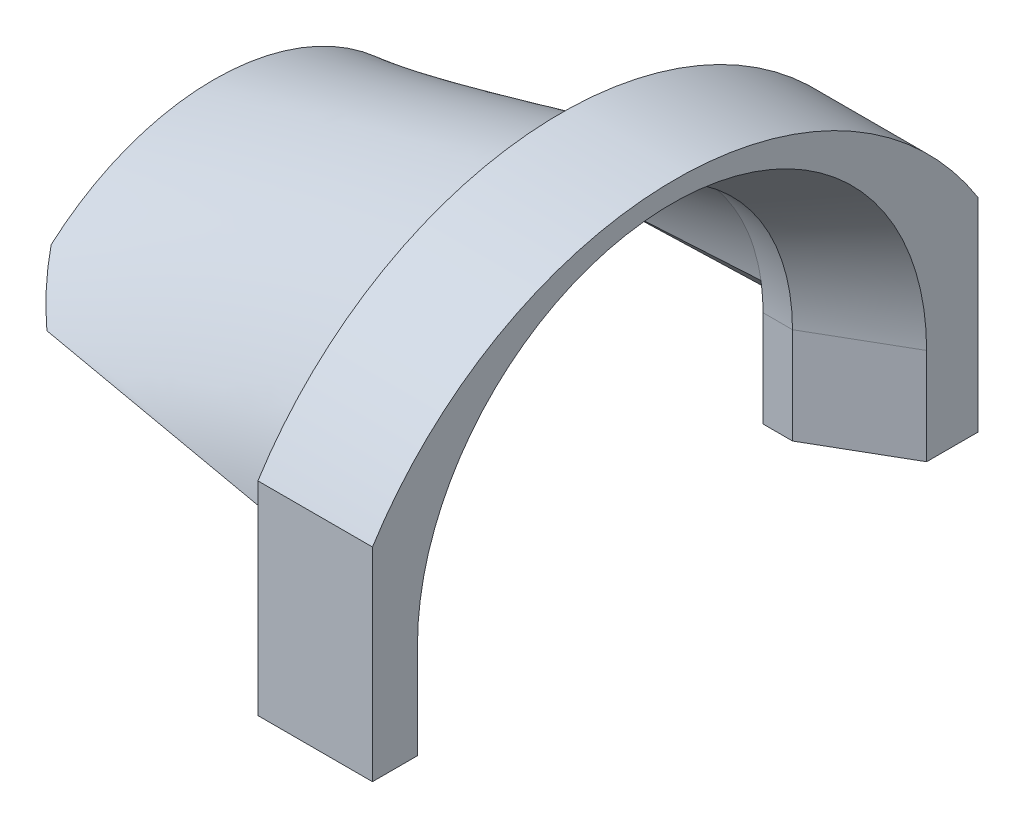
ISO-10303-21;
HEADER;
FILE_DESCRIPTION(('STEP AP214'),'2;1');
FILE_NAME('part.step','',(''),(''),'','','');
FILE_SCHEMA(('AUTOMOTIVE_DESIGN { 1 0 10303 214 1 1 1 1 }'));
ENDSEC;
DATA;
#1=APPLICATION_CONTEXT('core data for automotive mechanical design processes');
#2=APPLICATION_PROTOCOL_DEFINITION('international standard','automotive_design',2000,#1);
#3=PRODUCT_CONTEXT('',#1,'mechanical');
#4=PRODUCT('Part','Part','',(#3));
#5=PRODUCT_RELATED_PRODUCT_CATEGORY('part','',(#4));
#6=PRODUCT_DEFINITION_FORMATION('','',#4);
#7=PRODUCT_DEFINITION_CONTEXT('part definition',#1,'design');
#8=PRODUCT_DEFINITION('design','',#6,#7);
#9=PRODUCT_DEFINITION_SHAPE('','',#8);
#10=(LENGTH_UNIT() NAMED_UNIT(*) SI_UNIT(.MILLI.,.METRE.));
#11=(NAMED_UNIT(*) PLANE_ANGLE_UNIT() SI_UNIT($,.RADIAN.));
#12=(NAMED_UNIT(*) SI_UNIT($,.STERADIAN.) SOLID_ANGLE_UNIT());
#13=UNCERTAINTY_MEASURE_WITH_UNIT(LENGTH_MEASURE(1.E-05),#10,'distance_accuracy_value','');
#14=(GEOMETRIC_REPRESENTATION_CONTEXT(3) GLOBAL_UNCERTAINTY_ASSIGNED_CONTEXT((#13)) GLOBAL_UNIT_ASSIGNED_CONTEXT((#10,
#11,#12)) REPRESENTATION_CONTEXT('',''));
#15=CARTESIAN_POINT('',(0.,0.,0.));
#16=DIRECTION('',(0.,0.,1.));
#17=DIRECTION('',(1.,0.,0.));
#18=AXIS2_PLACEMENT_3D('',#15,#16,#17);
#19=CARTESIAN_POINT('',(-19.5394293,9.,19.4705707));
#20=DIRECTION('',(0.,-1.,0.));
#21=DIRECTION('',(0.,0.,-1.));
#22=AXIS2_PLACEMENT_3D('',#19,#20,#21);
#23=PLANE('',#22);
#24=DIRECTION('',(0.,0.,1.));
#25=VECTOR('',#24,1.);
#26=CARTESIAN_POINT('',(48.025,9.,-17.5294293));
#27=LINE('',#26,#25);
#28=CARTESIAN_POINT('',(48.025,9.,13.7189758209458));
#29=VERTEX_POINT('',#28);
#30=CARTESIAN_POINT('',(48.025,9.,19.4705707));
#31=VERTEX_POINT('',#30);
#32=EDGE_CURVE('E639',#29,#31,#27,.T.);
#33=ORIENTED_EDGE('',*,*,#32,.F.);
#34=DIRECTION('',(1.,0.,0.));
#35=VECTOR('',#34,1.);
#36=CARTESIAN_POINT('',(46.025,9.,13.7189758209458));
#37=LINE('',#36,#35);
#38=CARTESIAN_POINT('',(49.8288475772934,9.,13.7189758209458));
#39=VERTEX_POINT('',#38);
#40=EDGE_CURVE('E85',#29,#39,#37,.T.);
#41=ORIENTED_EDGE('',*,*,#40,.T.);
#42=DIRECTION('',(-0.866025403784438,0.,-0.500000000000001));
#43=VECTOR('',#42,1.);
#44=CARTESIAN_POINT('',(49.8288475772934,9.,13.7189758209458));
#45=LINE('',#44,#43);
#46=CARTESIAN_POINT('',(55.025,9.,16.7189758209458));
#47=VERTEX_POINT('',#46);
#48=EDGE_CURVE('E105',#47,#39,#45,.T.);
#49=ORIENTED_EDGE('',*,*,#48,.F.);
#50=DIRECTION('',(0.,0.,-1.));
#51=VECTOR('',#50,1.);
#52=CARTESIAN_POINT('',(55.025,9.,0.));
#53=LINE('',#52,#51);
#54=CARTESIAN_POINT('',(55.025,9.,19.4705707));
#55=VERTEX_POINT('',#54);
#56=EDGE_CURVE('E656',#55,#47,#53,.T.);
#57=ORIENTED_EDGE('',*,*,#56,.F.);
#58=DIRECTION('',(1.,0.,0.));
#59=VECTOR('',#58,1.);
#60=CARTESIAN_POINT('',(55.025,9.,19.4705707));
#61=LINE('',#60,#59);
#62=EDGE_CURVE('E636',#31,#55,#61,.T.);
#63=ORIENTED_EDGE('',*,*,#62,.F.);
#64=EDGE_LOOP('',(#33,#41,#49,#57,#63));
#65=FACE_BOUND('',#64,.T.);
#66=ADVANCED_FACE('F82',(#65),#23,.T.);
#67=CARTESIAN_POINT('',(48.025,9.,-17.5294293));
#68=VERTEX_POINT('',#67);
#69=CARTESIAN_POINT('',(48.025,9.,-11.3903495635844));
#70=VERTEX_POINT('',#69);
#71=EDGE_CURVE('E241',#68,#70,#27,.T.);
#72=ORIENTED_EDGE('',*,*,#71,.F.);
#73=DIRECTION('',(1.,0.,0.));
#74=VECTOR('',#73,1.);
#75=CARTESIAN_POINT('',(0.,9.,-17.5294293));
#76=LINE('',#75,#74);
#77=CARTESIAN_POINT('',(55.025,9.,-17.5294293));
#78=VERTEX_POINT('',#77);
#79=EDGE_CURVE('E12',#68,#78,#76,.T.);
#80=ORIENTED_EDGE('',*,*,#79,.T.);
#81=CARTESIAN_POINT('',(55.025,9.,-14.3903495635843));
#82=VERTEX_POINT('',#81);
#83=EDGE_CURVE('E661',#82,#78,#53,.T.);
#84=ORIENTED_EDGE('',*,*,#83,.F.);
#85=DIRECTION('',(0.866025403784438,0.,-0.5));
#86=VECTOR('',#85,1.);
#87=CARTESIAN_POINT('',(49.8288475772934,9.,-11.3903495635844));
#88=LINE('',#87,#86);
#89=CARTESIAN_POINT('',(49.8288475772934,9.,-11.3903495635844));
#90=VERTEX_POINT('',#89);
#91=EDGE_CURVE('E682',#90,#82,#88,.T.);
#92=ORIENTED_EDGE('',*,*,#91,.F.);
#93=DIRECTION('',(-1.,0.,0.));
#94=VECTOR('',#93,1.);
#95=CARTESIAN_POINT('',(46.025,9.,-11.3903495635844));
#96=LINE('',#95,#94);
#97=EDGE_CURVE('E660',#90,#70,#96,.T.);
#98=ORIENTED_EDGE('',*,*,#97,.T.);
#99=EDGE_LOOP('',(#72,#80,#84,#92,#98));
#100=FACE_BOUND('',#99,.T.);
#101=ADVANCED_FACE('F307',(#100),#23,.T.);
#102=CARTESIAN_POINT('',(27.025,15.9499398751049,-11.1464179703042));
#103=CARTESIAN_POINT('',(27.025,16.0702097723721,-11.051155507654));
#104=CARTESIAN_POINT('',(27.025,16.1904966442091,-10.9559141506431));
#105=CARTESIAN_POINT('',(27.025,16.4311044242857,-10.7654737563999));
#106=CARTESIAN_POINT('',(27.025,16.551425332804,-10.670274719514));
#107=CARTESIAN_POINT('',(27.025,16.7319322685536,-10.527507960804));
#108=CARTESIAN_POINT('',(27.025,16.7921055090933,-10.4799243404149));
#109=CARTESIAN_POINT('',(27.025,16.9124605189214,-10.384767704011));
#110=CARTESIAN_POINT('',(27.025,16.9726422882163,-10.3371946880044));
#111=CARTESIAN_POINT('',(27.025,17.0629213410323,-10.2658431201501));
#112=CARTESIAN_POINT('',(27.025,17.0930154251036,-10.2420605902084));
#113=CARTESIAN_POINT('',(27.025,17.1381581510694,-10.2063887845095));
#114=CARTESIAN_POINT('',(27.025,17.1532059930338,-10.1944985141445));
#115=CARTESIAN_POINT('',(27.025,17.1833022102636,-10.1707186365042));
#116=CARTESIAN_POINT('',(27.025,17.1983505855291,-10.1588290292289));
#117=CARTESIAN_POINT('',(27.025,17.2209235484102,-10.1409951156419));
#118=CARTESIAN_POINT('',(27.025,17.2284479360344,-10.1350505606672));
#119=CARTESIAN_POINT('',(27.025,17.2434968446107,-10.1231616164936));
#120=CARTESIAN_POINT('',(27.025,17.2510213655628,-10.1172172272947));
#121=CARTESIAN_POINT('',(27.025,17.2623082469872,-10.1083007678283));
#122=CARTESIAN_POINT('',(27.025,17.2660705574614,-10.1053286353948));
#123=CARTESIAN_POINT('',(27.025,17.2735952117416,-10.0993844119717));
#124=CARTESIAN_POINT('',(27.025,17.2773574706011,-10.096412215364));
#125=CARTESIAN_POINT('',(27.025,17.2830011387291,-10.0919542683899));
#126=CARTESIAN_POINT('',(27.025,17.2848820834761,-10.0904679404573));
#127=CARTESIAN_POINT('',(27.025,17.2886431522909,-10.0874942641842));
#128=CARTESIAN_POINT('',(27.025,17.2905233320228,-10.0860069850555));
#129=CARTESIAN_POINT('',(27.025,17.2961627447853,-10.0815437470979));
#130=CARTESIAN_POINT('',(27.025,17.2999208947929,-10.078566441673));
#131=CARTESIAN_POINT('',(27.025,17.311190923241,-10.0696290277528));
#132=CARTESIAN_POINT('',(27.025,17.3186984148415,-10.0636634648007));
#133=CARTESIAN_POINT('',(27.025,17.3337016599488,-10.0517177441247));
#134=CARTESIAN_POINT('',(27.025,17.3411974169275,-10.0457375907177));
#135=CARTESIAN_POINT('',(27.025,17.3636670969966,-10.0277752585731));
#136=CARTESIAN_POINT('',(27.025,17.3786263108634,-10.0157747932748));
#137=CARTESIAN_POINT('',(27.025,17.4532763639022,-9.95559089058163));
#138=CARTESIAN_POINT('',(27.025,17.5126444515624,-9.90700617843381));
#139=CARTESIAN_POINT('',(27.025,17.6306087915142,-9.80887705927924));
#140=CARTESIAN_POINT('',(27.025,17.6892165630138,-9.75934698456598));
#141=CARTESIAN_POINT('',(27.025,17.8639172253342,-9.60936089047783));
#142=CARTESIAN_POINT('',(27.025,17.9789099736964,-9.50748739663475));
#143=CARTESIAN_POINT('',(27.025,18.2058064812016,-9.3000980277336));
#144=CARTESIAN_POINT('',(27.025,18.3179323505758,-9.19436104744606));
#145=CARTESIAN_POINT('',(27.025,18.5381034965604,-8.98017674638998));
#146=CARTESIAN_POINT('',(27.025,18.6462833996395,-8.87161534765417));
#147=CARTESIAN_POINT('',(27.025,18.8588200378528,-8.65162155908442));
#148=CARTESIAN_POINT('',(27.025,18.9631849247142,-8.54018260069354));
#149=CARTESIAN_POINT('',(27.025,19.1681327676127,-8.31443944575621));
#150=CARTESIAN_POINT('',(27.025,19.2687157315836,-8.20013525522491));
#151=CARTESIAN_POINT('',(27.025,19.5648116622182,-7.85293992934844));
#152=CARTESIAN_POINT('',(27.025,19.7546478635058,-7.61574800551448));
#153=CARTESIAN_POINT('',(27.025,20.1193688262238,-7.13003675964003));
#154=CARTESIAN_POINT('',(27.025,20.2942557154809,-6.88151904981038));
#155=CARTESIAN_POINT('',(27.025,20.5452744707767,-6.50017269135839));
#156=CARTESIAN_POINT('',(27.025,20.62705802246,-6.37162583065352));
#157=CARTESIAN_POINT('',(27.025,20.7867973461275,-6.11163213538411));
#158=CARTESIAN_POINT('',(27.025,20.8647529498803,-5.98018517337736));
#159=CARTESIAN_POINT('',(27.025,21.0167685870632,-5.71433991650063));
#160=CARTESIAN_POINT('',(27.025,21.0908040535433,-5.57998912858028));
#161=CARTESIAN_POINT('',(27.025,21.1989461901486,-5.37605913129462));
#162=CARTESIAN_POINT('',(27.025,21.23446639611,-5.30775201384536));
#163=CARTESIAN_POINT('',(27.025,21.3042599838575,-5.17086770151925));
#164=CARTESIAN_POINT('',(27.025,21.3385806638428,-5.10220648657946));
#165=CARTESIAN_POINT('',(27.025,21.5071499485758,-4.75807623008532));
#166=CARTESIAN_POINT('',(27.025,21.6326702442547,-4.47966993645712));
#167=CARTESIAN_POINT('',(27.025,21.8652640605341,-3.91696905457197));
#168=CARTESIAN_POINT('',(27.025,21.9723581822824,-3.63264053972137));
#169=CARTESIAN_POINT('',(27.025,22.1681273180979,-3.05802298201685));
#170=CARTESIAN_POINT('',(27.025,22.2568011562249,-2.76773355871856));
#171=CARTESIAN_POINT('',(27.025,22.415362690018,-2.18107540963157));
#172=CARTESIAN_POINT('',(27.025,22.4851833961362,-1.88466238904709));
#173=CARTESIAN_POINT('',(27.025,22.5755797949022,-1.43547193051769));
#174=CARTESIAN_POINT('',(27.025,22.6033299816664,-1.28493099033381));
#175=CARTESIAN_POINT('',(27.025,22.6413184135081,-1.05801171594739));
#176=CARTESIAN_POINT('',(27.025,22.6533794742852,-0.982152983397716));
#177=CARTESIAN_POINT('',(27.025,22.6762759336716,-0.830083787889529));
#178=CARTESIAN_POINT('',(27.025,22.6871194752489,-0.753807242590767));
#179=CARTESIAN_POINT('',(27.025,22.7177316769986,-0.524914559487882));
#180=CARTESIAN_POINT('',(27.025,22.7355956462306,-0.372176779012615));
#181=CARTESIAN_POINT('',(27.025,22.7662664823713,-0.0663053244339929));
#182=CARTESIAN_POINT('',(27.025,22.7790722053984,0.0868096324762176));
#183=CARTESIAN_POINT('',(27.025,22.8098851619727,0.546693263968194));
#184=CARTESIAN_POINT('',(27.025,22.8203049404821,0.853996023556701));
#185=CARTESIAN_POINT('',(27.025,22.8204068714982,1.47008476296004));
#186=CARTESIAN_POINT('',(27.025,22.8100873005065,1.77726154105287));
#187=CARTESIAN_POINT('',(27.025,22.779465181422,2.23674078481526));
#188=CARTESIAN_POINT('',(27.025,22.7667297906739,2.38968693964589));
#189=CARTESIAN_POINT('',(27.025,22.7362201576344,2.69515349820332));
#190=CARTESIAN_POINT('',(27.025,22.7184453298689,2.84767385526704));
#191=CARTESIAN_POINT('',(27.025,22.6778421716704,3.15228758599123));
#192=CARTESIAN_POINT('',(27.025,22.6550232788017,3.30434492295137));
#193=CARTESIAN_POINT('',(27.025,22.6042956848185,3.60817688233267));
#194=CARTESIAN_POINT('',(27.025,22.5764827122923,3.75936058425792));
#195=CARTESIAN_POINT('',(27.025,22.5160875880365,4.05994209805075));
#196=CARTESIAN_POINT('',(27.025,22.4834939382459,4.20940372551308));
#197=CARTESIAN_POINT('',(27.025,22.4135612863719,4.50666348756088));
#198=CARTESIAN_POINT('',(27.025,22.3762146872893,4.65446256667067));
#199=CARTESIAN_POINT('',(27.025,22.2570974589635,5.09538952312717));
#200=CARTESIAN_POINT('',(27.025,22.1683115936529,5.38606882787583));
#201=CARTESIAN_POINT('',(27.025,21.9724405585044,5.96104031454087));
#202=CARTESIAN_POINT('',(27.025,21.8653555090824,6.24533253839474));
#203=CARTESIAN_POINT('',(27.025,21.6910742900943,6.66700525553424));
#204=CARTESIAN_POINT('',(27.025,21.6307034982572,6.80676805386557));
#205=CARTESIAN_POINT('',(27.025,21.5053817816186,7.08469501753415));
#206=CARTESIAN_POINT('',(27.025,21.4404313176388,7.22285934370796));
#207=CARTESIAN_POINT('',(27.025,21.3059004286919,7.49757197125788));
#208=CARTESIAN_POINT('',(27.025,21.2363118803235,7.63413335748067));
#209=CARTESIAN_POINT('',(27.025,21.0924580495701,7.90556009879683));
#210=CARTESIAN_POINT('',(27.025,21.018065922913,8.04064007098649));
#211=CARTESIAN_POINT('',(27.025,20.8657244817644,8.30714500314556));
#212=CARTESIAN_POINT('',(27.025,20.7875764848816,8.43895451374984));
#213=CARTESIAN_POINT('',(27.025,20.6275173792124,8.69951602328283));
#214=CARTESIAN_POINT('',(27.025,20.5455867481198,8.82830633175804));
#215=CARTESIAN_POINT('',(27.025,20.2941737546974,9.2102703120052));
#216=CARTESIAN_POINT('',(27.025,20.1190865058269,9.45904974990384));
#217=CARTESIAN_POINT('',(27.025,19.7541345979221,9.94502312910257));
#218=CARTESIAN_POINT('',(27.025,19.5642673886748,10.1822150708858));
#219=CARTESIAN_POINT('',(27.025,19.1696287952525,10.6449140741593));
#220=CARTESIAN_POINT('',(27.025,18.9648844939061,10.8704458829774));
#221=CARTESIAN_POINT('',(27.025,18.6465597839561,11.1999457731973));
#222=CARTESIAN_POINT('',(27.025,18.538576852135,11.3083180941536));
#223=CARTESIAN_POINT('',(27.025,18.3188532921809,11.5220920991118));
#224=CARTESIAN_POINT('',(27.025,18.2070615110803,11.6275427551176));
#225=CARTESIAN_POINT('',(27.025,17.9798359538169,11.8352778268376));
#226=CARTESIAN_POINT('',(27.025,17.8647747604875,11.9372257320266));
#227=CARTESIAN_POINT('',(27.025,17.6898986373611,12.0873825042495));
#228=CARTESIAN_POINT('',(27.025,17.6312323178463,12.1369678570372));
#229=CARTESIAN_POINT('',(27.025,17.5131508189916,12.2352043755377));
#230=CARTESIAN_POINT('',(27.025,17.4537241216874,12.2838411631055));
#231=CARTESIAN_POINT('',(27.025,17.3790008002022,12.3440883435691));
#232=CARTESIAN_POINT('',(27.025,17.3640269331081,12.3561013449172));
#233=CARTESIAN_POINT('',(27.025,17.3415352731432,12.3740823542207));
#234=CARTESIAN_POINT('',(27.025,17.334032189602,12.3800687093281));
#235=CARTESIAN_POINT('',(27.025,17.3190142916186,12.3920267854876));
#236=CARTESIAN_POINT('',(27.025,17.3114994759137,12.3979985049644));
#237=CARTESIAN_POINT('',(27.025,17.3002184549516,12.4069451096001));
#238=CARTESIAN_POINT('',(27.025,17.2964566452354,12.409925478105));
#239=CARTESIAN_POINT('',(27.025,17.2908117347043,12.4143932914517));
#240=CARTESIAN_POINT('',(27.025,17.288929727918,12.4158821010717));
#241=CARTESIAN_POINT('',(27.025,17.2851649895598,12.4188588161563));
#242=CARTESIAN_POINT('',(27.025,17.2832822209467,12.4203466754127));
#243=CARTESIAN_POINT('',(27.025,17.2795160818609,12.4233216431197));
#244=CARTESIAN_POINT('',(27.025,17.2776330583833,12.424809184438));
#245=CARTESIAN_POINT('',(27.025,17.273866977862,12.4277842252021));
#246=CARTESIAN_POINT('',(27.025,17.2719839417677,12.4292717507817));
#247=CARTESIAN_POINT('',(27.025,17.2663348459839,12.4337343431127));
#248=CARTESIAN_POINT('',(27.025,17.2625687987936,12.4367094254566));
#249=CARTESIAN_POINT('',(27.025,17.2512707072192,12.445634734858));
#250=CARTESIAN_POINT('',(27.025,17.2437387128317,12.4515850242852));
#251=CARTESIAN_POINT('',(27.025,17.228674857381,12.4634857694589));
#252=CARTESIAN_POINT('',(27.025,17.2211429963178,12.4694362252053));
#253=CARTESIAN_POINT('',(27.025,17.1985476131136,12.4872878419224));
#254=CARTESIAN_POINT('',(27.025,17.1834842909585,12.4991892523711));
#255=CARTESIAN_POINT('',(27.025,17.1533581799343,12.5229927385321));
#256=CARTESIAN_POINT('',(27.025,17.1382953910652,12.5348948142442));
#257=CARTESIAN_POINT('',(27.025,17.0931078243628,12.5706020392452));
#258=CARTESIAN_POINT('',(27.025,17.0629838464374,12.5944081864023));
#259=CARTESIAN_POINT('',(27.025,16.9726151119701,12.6658306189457));
#260=CARTESIAN_POINT('',(27.025,16.9123735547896,12.7134508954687));
#261=CARTESIAN_POINT('',(27.025,16.7918989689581,12.8087020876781));
#262=CARTESIAN_POINT('',(27.025,16.7316659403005,12.8563330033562));
#263=CARTESIAN_POINT('',(27.025,16.5509796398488,12.9992417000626));
#264=CARTESIAN_POINT('',(27.025,16.4305391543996,13.0945354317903));
#265=CARTESIAN_POINT('',(27.025,16.1896922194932,13.285165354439));
#266=CARTESIAN_POINT('',(27.025,16.0692857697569,13.3805015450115));
#267=CARTESIAN_POINT('',(27.025,15.9488962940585,13.4758589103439));
#268=CARTESIAN_POINT('',(27.8127537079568,15.5852951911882,-10.6860500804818));
#269=CARTESIAN_POINT('',(27.8160143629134,15.7055068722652,-10.5906028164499));
#270=CARTESIAN_POINT('',(27.819279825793,15.8257524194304,-10.4951977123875));
#271=CARTESIAN_POINT('',(27.8258176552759,16.0663114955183,-10.304472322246));
#272=CARTESIAN_POINT('',(27.8290900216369,16.186625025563,-10.2091520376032));
#273=CARTESIAN_POINT('',(27.8340016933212,16.3671464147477,-10.0662354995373));
#274=CARTESIAN_POINT('',(27.8356394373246,16.4273287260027,-10.0186073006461));
#275=CARTESIAN_POINT('',(27.8389156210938,16.5477103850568,-9.92337222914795));
#276=CARTESIAN_POINT('',(27.8405540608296,16.6079097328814,-9.87576535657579));
#277=CARTESIAN_POINT('',(27.8430119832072,16.69822153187,-9.80437105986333));
#278=CARTESIAN_POINT('',(27.8438313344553,16.7283275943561,-9.78057562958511));
#279=CARTESIAN_POINT('',(27.8450603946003,16.7734898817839,-9.74488648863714));
#280=CARTESIAN_POINT('',(27.8454700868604,16.7885445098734,-9.73299077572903));
#281=CARTESIAN_POINT('',(27.8462894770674,16.8186548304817,-9.70920068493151));
#282=CARTESIAN_POINT('',(27.8466991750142,16.8337105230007,-9.69730630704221));
#283=CARTESIAN_POINT('',(27.847313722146,16.8562948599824,-9.67946574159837));
#284=CARTESIAN_POINT('',(27.8475185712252,16.8638231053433,-9.67351905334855));
#285=CARTESIAN_POINT('',(27.8479282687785,16.87887986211,-9.66162601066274));
#286=CARTESIAN_POINT('',(27.8481331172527,16.8864083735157,-9.65567965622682));
#287=CARTESIAN_POINT('',(27.8484403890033,16.8977013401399,-9.64676037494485));
#288=CARTESIAN_POINT('',(27.8485428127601,16.9014656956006,-9.64378732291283));
#289=CARTESIAN_POINT('',(27.8487476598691,16.9089944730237,-9.63784130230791));
#290=CARTESIAN_POINT('',(27.8488574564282,16.9127962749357,-9.63483869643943));
#291=CARTESIAN_POINT('',(27.8490000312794,16.9183868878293,-9.63042376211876));
#292=CARTESIAN_POINT('',(27.8490289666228,16.92015567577,-9.62902628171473));
#293=CARTESIAN_POINT('',(27.8491048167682,16.9237837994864,-9.62615833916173));
#294=CARTESIAN_POINT('',(27.8491388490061,16.9255777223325,-9.6247395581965));
#295=CARTESIAN_POINT('',(27.8492493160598,16.9310008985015,-9.62044838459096));
#296=CARTESIAN_POINT('',(27.8493201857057,16.9346007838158,-9.61759704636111));
#297=CARTESIAN_POINT('',(27.849539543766,16.9454303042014,-9.60901091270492));
#298=CARTESIAN_POINT('',(27.8496836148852,16.9526330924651,-9.60328877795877));
#299=CARTESIAN_POINT('',(27.8499741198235,16.9670389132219,-9.5918215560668));
#300=CARTESIAN_POINT('',(27.8501194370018,16.9742362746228,-9.58608094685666));
#301=CARTESIAN_POINT('',(27.8505555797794,16.9958117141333,-9.56883813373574));
#302=CARTESIAN_POINT('',(27.8508465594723,17.0101758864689,-9.55731844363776));
#303=CARTESIAN_POINT('',(27.8523030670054,17.0818584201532,-9.49954521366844));
#304=CARTESIAN_POINT('',(27.8534719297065,17.1388713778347,-9.45290734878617));
#305=CARTESIAN_POINT('',(27.8558170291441,17.2521656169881,-9.35871125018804));
#306=CARTESIAN_POINT('',(27.8569931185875,17.3084578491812,-9.31116700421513));
#307=CARTESIAN_POINT('',(27.8605310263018,17.4762691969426,-9.16719723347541));
#308=CARTESIAN_POINT('',(27.8629029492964,17.586744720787,-9.06941381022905));
#309=CARTESIAN_POINT('',(27.8676670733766,17.8047580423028,-8.87036271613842));
#310=CARTESIAN_POINT('',(27.8700647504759,17.9125113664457,-8.76888094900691));
#311=CARTESIAN_POINT('',(27.8748568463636,18.1241191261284,-8.56333560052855));
#312=CARTESIAN_POINT('',(27.8772522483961,18.2280988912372,-8.45916638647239));
#313=CARTESIAN_POINT('',(27.8820342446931,18.4324016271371,-8.24809727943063));
#314=CARTESIAN_POINT('',(27.8844208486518,18.532731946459,-8.14119154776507));
#315=CARTESIAN_POINT('',(27.8891805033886,18.7297756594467,-7.92465470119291));
#316=CARTESIAN_POINT('',(27.8915551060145,18.8264953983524,-7.81501632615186));
#317=CARTESIAN_POINT('',(27.8986460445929,19.1112140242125,-7.48206720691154));
#318=CARTESIAN_POINT('',(27.9033471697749,19.2938186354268,-7.25462733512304));
#319=CARTESIAN_POINT('',(27.912648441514,19.6448516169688,-6.78880431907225));
#320=CARTESIAN_POINT('',(27.9172474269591,19.8132645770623,-6.5504404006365));
#321=CARTESIAN_POINT('',(27.9240138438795,20.0550552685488,-6.18472537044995));
#322=CARTESIAN_POINT('',(27.9262458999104,20.1338430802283,-6.06145650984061));
#323=CARTESIAN_POINT('',(27.9306543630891,20.2877494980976,-5.81215826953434));
#324=CARTESIAN_POINT('',(27.9328307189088,20.3628683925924,-5.68612790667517));
#325=CARTESIAN_POINT('',(27.937118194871,20.5093651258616,-5.43126581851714));
#326=CARTESIAN_POINT('',(27.9392312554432,20.5807287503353,-5.30246272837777));
#327=CARTESIAN_POINT('',(27.9423426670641,20.6849539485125,-5.10701722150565));
#328=CARTESIAN_POINT('',(27.9433708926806,20.7191924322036,-5.04154968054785));
#329=CARTESIAN_POINT('',(27.9454040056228,20.7864816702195,-4.9103415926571));
#330=CARTESIAN_POINT('',(27.9464098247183,20.819576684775,-4.84452274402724));
#331=CARTESIAN_POINT('',(27.9513786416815,20.9821548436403,-4.51461392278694));
#332=CARTESIAN_POINT('',(27.9551647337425,21.1032953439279,-4.24764967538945));
#333=CARTESIAN_POINT('',(27.962284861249,21.3278590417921,-3.70803646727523));
#334=CARTESIAN_POINT('',(27.9656150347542,21.4312954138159,-3.43536938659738));
#335=CARTESIAN_POINT('',(27.9717653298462,21.6204172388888,-2.88435325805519));
#336=CARTESIAN_POINT('',(27.9745882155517,21.7061016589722,-2.60599981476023));
#337=CARTESIAN_POINT('',(27.9796656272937,21.8592904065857,-2.04369272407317));
#338=CARTESIAN_POINT('',(27.9819247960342,21.9267632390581,-1.75959236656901));
#339=CARTESIAN_POINT('',(27.9848881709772,22.014182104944,-1.3288413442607));
#340=CARTESIAN_POINT('',(27.9858032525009,22.0410232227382,-1.18446941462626));
#341=CARTESIAN_POINT('',(27.9870604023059,22.0777726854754,-0.966835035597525));
#342=CARTESIAN_POINT('',(27.9874602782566,22.0894411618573,-0.8940787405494));
#343=CARTESIAN_POINT('',(27.9882198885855,22.1115930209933,-0.748228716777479));
#344=CARTESIAN_POINT('',(27.9885798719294,22.1220843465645,-0.675071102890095));
#345=CARTESIAN_POINT('',(27.9895953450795,22.1517017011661,-0.455545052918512));
#346=CARTESIAN_POINT('',(27.9901854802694,22.1689851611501,-0.309059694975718));
#347=CARTESIAN_POINT('',(27.9911979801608,22.1986619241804,-0.0156901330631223));
#348=CARTESIAN_POINT('',(27.9916202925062,22.2110527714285,0.131165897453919));
#349=CARTESIAN_POINT('',(27.9926382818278,22.2408668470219,0.572221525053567));
#350=CARTESIAN_POINT('',(27.992986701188,22.2509457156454,0.866896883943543));
#351=CARTESIAN_POINT('',(27.9929901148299,22.2510442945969,1.45737236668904));
#352=CARTESIAN_POINT('',(27.9926449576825,22.2410623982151,1.751924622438));
#353=CARTESIAN_POINT('',(27.9916332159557,22.2114330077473,2.19259155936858));
#354=CARTESIAN_POINT('',(27.9912132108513,22.1991102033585,2.33928567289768));
#355=CARTESIAN_POINT('',(27.9902060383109,22.1695894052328,2.63226683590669));
#356=CARTESIAN_POINT('',(27.9896189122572,22.1523920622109,2.77854466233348));
#357=CARTESIAN_POINT('',(27.9882720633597,22.11310860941,3.07069160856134));
#358=CARTESIAN_POINT('',(27.9875139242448,22.0910306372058,3.21653477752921));
#359=CARTESIAN_POINT('',(27.98583502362,22.0419573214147,3.50793511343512));
#360=CARTESIAN_POINT('',(27.984917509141,22.0150543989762,3.65292710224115));
#361=CARTESIAN_POINT('',(27.9829379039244,21.9566502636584,3.94116355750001));
#362=CARTESIAN_POINT('',(27.9818757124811,21.9251390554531,4.08446531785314));
#363=CARTESIAN_POINT('',(27.9796119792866,21.8575481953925,4.36943161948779));
#364=CARTESIAN_POINT('',(27.9784123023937,21.8214701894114,4.51106605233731));
#365=CARTESIAN_POINT('',(27.974596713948,21.7063853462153,4.93370441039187));
#366=CARTESIAN_POINT('',(27.9717709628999,21.620595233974,5.21242246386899));
#367=CARTESIAN_POINT('',(27.9656173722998,21.431374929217,5.76377793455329));
#368=CARTESIAN_POINT('',(27.9622873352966,21.327947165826,6.03641057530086));
#369=CARTESIAN_POINT('',(27.9569523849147,21.1596830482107,6.44078149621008));
#370=CARTESIAN_POINT('',(27.9551185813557,21.1014082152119,6.57480490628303));
#371=CARTESIAN_POINT('',(27.9513481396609,20.9804699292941,6.84129938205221));
#372=CARTESIAN_POINT('',(27.9494116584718,20.9178070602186,6.97377025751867));
#373=CARTESIAN_POINT('',(27.9454463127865,20.7880582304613,7.23712917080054));
#374=CARTESIAN_POINT('',(27.9434180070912,20.7209672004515,7.36802481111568));
#375=CARTESIAN_POINT('',(27.939277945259,20.5823217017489,7.62816188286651));
#376=CARTESIAN_POINT('',(27.9371546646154,20.5106153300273,7.75766177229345));
#377=CARTESIAN_POINT('',(27.9328576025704,20.3638046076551,8.01315583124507));
#378=CARTESIAN_POINT('',(27.9306756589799,20.2885001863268,8.13953383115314));
#379=CARTESIAN_POINT('',(27.9262581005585,20.1342855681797,8.38937642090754));
#380=CARTESIAN_POINT('',(27.9240219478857,20.0553560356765,8.51287870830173));
#381=CARTESIAN_POINT('',(27.9172447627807,19.8131855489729,8.87918601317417));
#382=CARTESIAN_POINT('',(27.9126406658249,19.6445797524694,9.11780096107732));
#383=CARTESIAN_POINT('',(27.9033338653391,19.2933246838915,9.58387540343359));
#384=CARTESIAN_POINT('',(27.8986308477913,19.1106842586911,9.81132238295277));
#385=CARTESIAN_POINT('',(27.8891834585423,18.7312220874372,10.2550215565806));
#386=CARTESIAN_POINT('',(27.8844203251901,18.5343559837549,10.4713764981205));
#387=CARTESIAN_POINT('',(27.8772579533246,18.2283650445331,10.7875078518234));
#388=CARTESIAN_POINT('',(27.8748668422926,18.124574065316,10.8914960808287));
#389=CARTESIAN_POINT('',(27.8700841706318,17.9133964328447,11.0966475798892));
#390=CARTESIAN_POINT('',(27.8676932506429,17.8059640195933,11.1978545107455));
#391=CARTESIAN_POINT('',(27.8629216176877,17.5876343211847,11.3972373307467));
#392=CARTESIAN_POINT('',(27.860548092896,17.4770929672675,11.4950921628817));
#393=CARTESIAN_POINT('',(27.85700635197,17.3091129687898,11.6392257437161));
#394=CARTESIAN_POINT('',(27.85582900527,17.2527644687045,11.6868230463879));
#395=CARTESIAN_POINT('',(27.8534814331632,17.1393576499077,11.781122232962));
#396=CARTESIAN_POINT('',(27.8523118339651,17.0822908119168,11.8278081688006));
#397=CARTESIAN_POINT('',(27.8508532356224,17.0105348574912,11.8856445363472));
#398=CARTESIAN_POINT('',(27.8505620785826,16.9961572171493,11.8971757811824));
#399=CARTESIAN_POINT('',(27.8501254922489,16.9745606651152,11.9144365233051));
#400=CARTESIAN_POINT('',(27.8499800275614,16.9673562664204,11.9201830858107));
#401=CARTESIAN_POINT('',(27.8496892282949,16.9529363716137,11.9316621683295));
#402=CARTESIAN_POINT('',(27.8495445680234,16.9457243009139,11.9373919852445));
#403=CARTESIAN_POINT('',(27.8493256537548,16.9348875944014,11.9459842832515));
#404=CARTESIAN_POINT('',(27.8492540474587,16.931280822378,11.9488412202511));
#405=CARTESIAN_POINT('',(27.8491441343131,16.9258557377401,11.9531341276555));
#406=CARTESIAN_POINT('',(27.8491091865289,16.9240555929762,11.9545578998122));
#407=CARTESIAN_POINT('',(27.849034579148,16.9204306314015,11.9574234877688));
#408=CARTESIAN_POINT('',(27.8490071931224,16.9186681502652,11.9588160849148));
#409=CARTESIAN_POINT('',(27.8489120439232,16.91493739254,11.9617623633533));
#410=CARTESIAN_POINT('',(27.8488570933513,16.9130345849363,11.963265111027));
#411=CARTESIAN_POINT('',(27.8487545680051,16.9092664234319,11.9662410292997));
#412=CARTESIAN_POINT('',(27.8487033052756,16.9073823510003,11.9677289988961));
#413=CARTESIAN_POINT('',(27.8485495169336,16.9017301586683,11.9721929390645));
#414=CARTESIAN_POINT('',(27.8484469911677,16.8979620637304,11.9751689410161));
#415=CARTESIAN_POINT('',(27.8481394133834,16.8866578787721,11.9840970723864));
#416=CARTESIAN_POINT('',(27.8479343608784,16.8791218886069,11.9900493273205));
#417=CARTESIAN_POINT('',(27.8475242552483,16.8640501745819,12.0019541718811));
#418=CARTESIAN_POINT('',(27.8473192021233,16.8565144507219,12.0079067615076));
#419=CARTESIAN_POINT('',(27.8467040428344,16.8339076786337,12.0257650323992));
#420=CARTESIAN_POINT('',(27.8462939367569,16.818837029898,12.0376712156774));
#421=CARTESIAN_POINT('',(27.8454737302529,16.7886967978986,12.0614849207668));
#422=CARTESIAN_POINT('',(27.8450636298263,16.7736272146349,12.0733924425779));
#423=CARTESIAN_POINT('',(27.8438333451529,16.7284200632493,12.1091170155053));
#424=CARTESIAN_POINT('',(27.8430131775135,16.6982840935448,12.1329360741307));
#425=CARTESIAN_POINT('',(27.8405528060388,16.6078825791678,12.2044012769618));
#426=CARTESIAN_POINT('',(27.8389127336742,16.5476234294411,12.2520554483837));
#427=CARTESIAN_POINT('',(27.8356332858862,16.4271221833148,12.3473851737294));
#428=CARTESIAN_POINT('',(27.833993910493,16.3668800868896,12.3950607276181));
#429=CARTESIAN_POINT('',(27.829077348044,16.1861793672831,12.5381194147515));
#430=CARTESIAN_POINT('',(27.8258017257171,16.0657463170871,12.6335345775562));
#431=CARTESIAN_POINT('',(27.8192574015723,15.8249482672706,12.8244499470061));
#432=CARTESIAN_POINT('',(27.8159886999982,15.7045832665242,12.9199501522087));
#433=CARTESIAN_POINT('',(27.8127248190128,15.5842521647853,13.0154926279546));
#434=B_SPLINE_SURFACE_WITH_KNOTS('',1,3,((#102,#103,#104,#105,#106,#107,#108,#109,#110,#111,
#112,#113,#114,#115,#116,#117,#118,#119,#120,#121,#122,#123,#124,#125,#126,#127,#128,#129,#130,
#131,#132,#133,#134,#135,#136,#137,#138,#139,#140,#141,#142,#143,#144,#145,#146,#147,#148,#149,
#150,#151,#152,#153,#154,#155,#156,#157,#158,#159,#160,#161,#162,#163,#164,#165,#166,#167,#168,
#169,#170,#171,#172,#173,#174,#175,#176,#177,#178,#179,#180,#181,#182,#183,#184,#185,#186,#187,
#188,#189,#190,#191,#192,#193,#194,#195,#196,#197,#198,#199,#200,#201,#202,#203,#204,#205,#206,
#207,#208,#209,#210,#211,#212,#213,#214,#215,#216,#217,#218,#219,#220,#221,#222,#223,#224,#225,
#226,#227,#228,#229,#230,#231,#232,#233,#234,#235,#236,#237,#238,#239,#240,#241,#242,#243,#244,
#245,#246,#247,#248,#249,#250,#251,#252,#253,#254,#255,#256,#257,#258,#259,#260,#261,#262,#263,
#264,#265,#266,#267),(#268,#269,#270,#271,#272,#273,#274,#275,#276,#277,#278,#279,#280,#281,
#282,#283,#284,#285,#286,#287,#288,#289,#290,#291,#292,#293,#294,#295,#296,#297,#298,#299,#300,
#301,#302,#303,#304,#305,#306,#307,#308,#309,#310,#311,#312,#313,#314,#315,#316,#317,#318,#319,
#320,#321,#322,#323,#324,#325,#326,#327,#328,#329,#330,#331,#332,#333,#334,#335,#336,#337,#338,
#339,#340,#341,#342,#343,#344,#345,#346,#347,#348,#349,#350,#351,#352,#353,#354,#355,#356,#357,
#358,#359,#360,#361,#362,#363,#364,#365,#366,#367,#368,#369,#370,#371,#372,#373,#374,#375,#376,
#377,#378,#379,#380,#381,#382,#383,#384,#385,#386,#387,#388,#389,#390,#391,#392,#393,#394,#395,
#396,#397,#398,#399,#400,#401,#402,#403,#404,#405,#406,#407,#408,#409,#410,#411,#412,#413,#414,
#415,#416,#417,#418,#419,#420,#421,#422,#423,#424,#425,#426,#427,#428,#429,#430,#431,#432,
#433)),.UNSPECIFIED.,.F.,.F.,.F.,(2,2),(4,2,2,2,2,2,2,2,2,2,2,2,2,2,2,2,2,2,2,2,2,2,2,2,2,2,2,2,
2,2,2,2,2,2,2,2,2,2,2,2,2,2,2,2,2,2,2,2,2,2,2,2,2,2,2,2,2,2,2,2,2,2,2,2,2,2,2,2,2,2,2,2,2,2,2,2,
2,2,2,2,2,2,4),(0.,1.),(0.0299600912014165,0.0304203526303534,0.0308806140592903,
0.0311107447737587,0.0313408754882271,0.0314559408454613,0.0315134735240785,0.0315710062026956,
0.0315997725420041,0.0316285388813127,0.0316429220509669,0.0316573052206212,0.0316644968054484,
0.0316716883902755,0.0316860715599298,0.0317148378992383,0.0317436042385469,0.031801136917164,
0.0320312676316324,0.0322613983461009,0.0327216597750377,0.0331819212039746,0.0336421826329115,
0.0341024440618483,0.0345627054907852,0.035483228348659,0.0364037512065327,0.0368640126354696,
0.0373242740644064,0.0377845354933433,0.0380146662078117,0.0382447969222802,0.0391653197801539,
0.0400858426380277,0.0410063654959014,0.0419268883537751,0.042387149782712,0.0426172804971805,
0.0428474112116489,0.0433076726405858,0.0437679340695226,0.0446884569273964,0.0456089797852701,
0.046069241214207,0.0465295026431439,0.0469897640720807,0.0474500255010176,0.0479102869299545,
0.0483705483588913,0.0492910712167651,0.0502115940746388,0.0506718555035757,0.0511321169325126,
0.0515923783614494,0.0520526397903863,0.0525129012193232,0.05297316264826,0.0538936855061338,
0.0548142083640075,0.0557347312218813,0.0561949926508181,0.056655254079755,0.0571155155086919,
0.0573456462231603,0.0575757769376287,0.0576333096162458,0.0576620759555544,0.057690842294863,
0.0577052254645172,0.0577124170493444,0.0577196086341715,0.0577268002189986,0.0577339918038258,
0.0577483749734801,0.0577771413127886,0.0578059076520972,0.0578634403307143,0.0579209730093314,
0.0580360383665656,0.058266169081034,0.0584962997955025,0.0589565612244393,0.0594168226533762),.UNSPECIFIED.);
#435=CARTESIAN_POINT('',(27.8764537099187,18.1929146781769,10.822198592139));
#436=CARTESIAN_POINT('',(27.8782773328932,18.2719552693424,10.7427483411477));
#437=CARTESIAN_POINT('',(27.8801025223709,18.3500645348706,10.6623683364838));
#438=CARTESIAN_POINT('',(27.8838930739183,18.5103589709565,10.4934825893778));
#439=CARTESIAN_POINT('',(27.8858583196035,18.5923899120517,10.4048304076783));
#440=CARTESIAN_POINT('',(27.8888991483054,18.7177858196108,10.265807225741));
#441=CARTESIAN_POINT('',(27.8899773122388,18.7619470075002,10.2161525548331));
#442=CARTESIAN_POINT('',(27.8914496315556,18.8217353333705,10.1479707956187));
#443=CARTESIAN_POINT('',(27.8918431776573,18.8376661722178,10.1297095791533));
#444=CARTESIAN_POINT('',(27.8934386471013,18.902050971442,10.0555245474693));
#445=CARTESIAN_POINT('',(27.894641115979,18.9501159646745,9.99926226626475));
#446=CARTESIAN_POINT('',(27.8975616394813,19.066067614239,9.86135799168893));
#447=CARTESIAN_POINT('',(27.8992764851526,19.1334836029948,9.77931990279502));
#448=CARTESIAN_POINT('',(27.9032241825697,19.2871374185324,9.58800342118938));
#449=CARTESIAN_POINT('',(27.9054522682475,19.3727081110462,9.47818828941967));
#450=CARTESIAN_POINT('',(27.9096333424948,19.5310158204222,9.26875779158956));
#451=CARTESIAN_POINT('',(27.9115887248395,19.6041034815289,9.16940751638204));
#452=CARTESIAN_POINT('',(27.914102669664,19.6968794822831,9.03979666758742));
#453=CARTESIAN_POINT('',(27.9146706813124,19.7177625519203,9.01038668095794));
#454=CARTESIAN_POINT('',(27.9172348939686,19.8117518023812,8.87694739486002));
#455=CARTESIAN_POINT('',(27.9192158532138,19.8835790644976,8.77201089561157));
#456=CARTESIAN_POINT('',(27.9229644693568,20.0179860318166,8.56986576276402));
#457=CARTESIAN_POINT('',(27.9247351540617,20.080813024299,8.47282120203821));
#458=CARTESIAN_POINT('',(27.9280630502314,20.1977255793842,8.28727385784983));
#459=CARTESIAN_POINT('',(27.9296234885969,20.2520456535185,8.19891897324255));
#460=CARTESIAN_POINT('',(27.932455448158,20.3498872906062,8.03574554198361));
#461=CARTESIAN_POINT('',(27.9337320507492,20.393708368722,7.96110635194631));
#462=CARTESIAN_POINT('',(27.9368146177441,20.4989574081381,7.77796160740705));
#463=CARTESIAN_POINT('',(27.9386059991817,20.5596362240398,7.66902384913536));
#464=CARTESIAN_POINT('',(27.9419815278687,20.6729321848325,7.4589949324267));
#465=CARTESIAN_POINT('',(27.9435702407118,20.7257936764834,7.35803547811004));
#466=CARTESIAN_POINT('',(27.9466436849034,20.8272323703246,7.15832593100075));
#467=CARTESIAN_POINT('',(27.9481301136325,20.8758943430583,7.05961890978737));
#468=CARTESIAN_POINT('',(27.9512092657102,20.9759217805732,6.85047537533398));
#469=CARTESIAN_POINT('',(27.9527963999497,21.0270214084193,6.73991144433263));
#470=CARTESIAN_POINT('',(27.9555972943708,21.1165695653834,6.53924397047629));
#471=CARTESIAN_POINT('',(27.9568233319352,21.1555366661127,6.44937141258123));
#472=CARTESIAN_POINT('',(27.9594119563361,21.2374069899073,6.25490858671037));
#473=CARTESIAN_POINT('',(27.9607664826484,21.2799918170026,6.15018387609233));
#474=CARTESIAN_POINT('',(27.9633748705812,21.3615464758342,5.94232123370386));
#475=CARTESIAN_POINT('',(27.9646303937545,21.400579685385,5.83920816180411));
#476=CARTESIAN_POINT('',(27.9670405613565,21.4751580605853,5.63477748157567));
#477=CARTESIAN_POINT('',(27.968196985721,21.5107677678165,5.53348348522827));
#478=CARTESIAN_POINT('',(27.9697175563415,21.5574219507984,5.39558528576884));
#479=CARTESIAN_POINT('',(27.9701122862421,21.5695168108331,5.35933420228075));
#480=CARTESIAN_POINT('',(27.9712364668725,21.6039261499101,5.25473426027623));
#481=CARTESIAN_POINT('',(27.9719542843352,21.6258519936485,5.18625700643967));
#482=CARTESIAN_POINT('',(27.9737485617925,21.6805445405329,5.01063670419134));
#483=CARTESIAN_POINT('',(27.9748015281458,21.712530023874,4.90324919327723));
#484=CARTESIAN_POINT('',(27.9768168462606,21.7735292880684,4.68866860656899));
#485=CARTESIAN_POINT('',(27.9777799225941,21.802567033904,4.58148234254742));
#486=CARTESIAN_POINT('',(27.9796154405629,21.8576831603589,4.36743403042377));
#487=CARTESIAN_POINT('',(27.9804886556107,21.8837870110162,4.26057855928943));
#488=CARTESIAN_POINT('',(27.9817938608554,21.9226540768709,4.09248238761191));
#489=CARTESIAN_POINT('',(27.982253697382,21.9363147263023,4.03144805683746));
#490=CARTESIAN_POINT('',(27.9830498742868,21.9599149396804,3.9224174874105));
#491=CARTESIAN_POINT('',(27.9833914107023,21.9700201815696,3.8744570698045));
#492=CARTESIAN_POINT('',(27.9844982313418,22.0027112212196,3.71495910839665));
#493=CARTESIAN_POINT('',(27.9852268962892,22.0241380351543,3.6031811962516));
#494=CARTESIAN_POINT('',(27.9865820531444,22.0638687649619,3.38058428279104));
#495=CARTESIAN_POINT('',(27.9872097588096,22.0822099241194,3.26977190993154));
#496=CARTESIAN_POINT('',(27.9883632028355,22.1158563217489,3.04924798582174));
#497=CARTESIAN_POINT('',(27.9888902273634,22.1311999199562,2.93954231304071));
#498=CARTESIAN_POINT('',(27.9897397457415,22.1559763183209,2.7446688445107));
#499=CARTESIAN_POINT('',(27.9900815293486,22.1659607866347,2.65957055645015));
#500=CARTESIAN_POINT('',(27.9908948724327,22.1897499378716,2.43835401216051));
#501=CARTESIAN_POINT('',(27.9913221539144,22.2022784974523,2.30209562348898));
#502=CARTESIAN_POINT('',(27.9919695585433,22.2212333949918,2.05387398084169));
#503=CARTESIAN_POINT('',(27.9922131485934,22.2283528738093,1.9419627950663));
#504=CARTESIAN_POINT('',(27.9926021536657,22.2397198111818,1.71835661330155));
#505=CARTESIAN_POINT('',(27.9927478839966,22.24397649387,1.60666209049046));
#506=CARTESIAN_POINT('',(27.9929407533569,22.249606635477,1.38426906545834));
#507=CARTESIAN_POINT('',(27.9929888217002,22.2510072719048,1.27357125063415));
#508=CARTESIAN_POINT('',(27.9929879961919,22.2509827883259,1.0507667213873));
#509=CARTESIAN_POINT('',(27.9929378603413,22.2495214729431,0.938660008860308));
#510=CARTESIAN_POINT('',(27.9927395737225,22.2437323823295,0.714776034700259));
#511=CARTESIAN_POINT('',(27.9925916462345,22.2394111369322,0.602998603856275));
#512=CARTESIAN_POINT('',(27.9921980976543,22.2279109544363,0.379228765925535));
#513=CARTESIAN_POINT('',(27.9919521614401,22.2207227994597,0.267236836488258));
#514=CARTESIAN_POINT('',(27.9913029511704,22.201714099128,0.0201772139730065));
#515=CARTESIAN_POINT('',(27.9908775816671,22.189240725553,-0.114841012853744));
#516=CARTESIAN_POINT('',(27.9900624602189,22.1654014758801,-0.335914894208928));
#517=CARTESIAN_POINT('',(27.989714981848,22.1552525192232,-0.422104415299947));
#518=CARTESIAN_POINT('',(27.98885764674,22.1302541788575,-0.617876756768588));
#519=CARTESIAN_POINT('',(27.9883293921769,22.1148790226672,-0.727393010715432));
#520=CARTESIAN_POINT('',(27.9871735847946,22.0811685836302,-0.947600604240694));
#521=CARTESIAN_POINT('',(27.9865446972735,22.0627934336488,-1.05828581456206));
#522=CARTESIAN_POINT('',(27.9851872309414,22.0229892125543,-1.2806899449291));
#523=CARTESIAN_POINT('',(27.9844573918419,22.0015213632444,-1.39240194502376));
#524=CARTESIAN_POINT('',(27.983358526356,21.9690457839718,-1.55048153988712));
#525=CARTESIAN_POINT('',(27.9830263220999,21.9592100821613,-1.59709283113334));
#526=CARTESIAN_POINT('',(27.9822321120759,21.935654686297,-1.70583853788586));
#527=CARTESIAN_POINT('',(27.9817639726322,21.9217396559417,-1.76793070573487));
#528=CARTESIAN_POINT('',(27.980451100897,21.8826274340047,-1.93678437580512));
#529=CARTESIAN_POINT('',(27.9795790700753,21.8565549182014,-2.04334417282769));
#530=CARTESIAN_POINT('',(27.977745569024,21.8014970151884,-2.25687605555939));
#531=CARTESIAN_POINT('',(27.9767832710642,21.7724844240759,-2.36384110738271));
#532=CARTESIAN_POINT('',(27.9747691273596,21.7115259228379,-2.57805282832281));
#533=CARTESIAN_POINT('',(27.9737165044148,21.6795543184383,-2.6852921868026));
#534=CARTESIAN_POINT('',(27.9719358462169,21.625279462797,-2.85942286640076));
#535=CARTESIAN_POINT('',(27.9712317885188,21.6037749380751,-2.92656438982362));
#536=CARTESIAN_POINT('',(27.9701090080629,21.5694100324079,-3.03105334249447));
#537=CARTESIAN_POINT('',(27.9697009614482,21.5569069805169,-3.06851876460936));
#538=CARTESIAN_POINT('',(27.9681652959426,21.5097866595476,-3.20769675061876));
#539=CARTESIAN_POINT('',(27.9670073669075,21.4741277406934,-3.30905883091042));
#540=CARTESIAN_POINT('',(27.9645942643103,21.3994517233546,-3.51361087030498));
#541=CARTESIAN_POINT('',(27.9633373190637,21.3603703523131,-3.61677729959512));
#542=CARTESIAN_POINT('',(27.9607261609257,21.278721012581,-3.82473214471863));
#543=CARTESIAN_POINT('',(27.9593702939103,21.2360899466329,-3.92949579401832));
#544=CARTESIAN_POINT('',(27.956796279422,21.1546751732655,-4.12273902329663));
#545=CARTESIAN_POINT('',(27.9555868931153,21.116237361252,-4.21136478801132));
#546=CARTESIAN_POINT('',(27.9527861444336,21.0267013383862,-4.41202630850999));
#547=CARTESIAN_POINT('',(27.9511811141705,20.9750258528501,-4.52380503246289));
#548=CARTESIAN_POINT('',(27.9480811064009,20.8743080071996,-4.73425608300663));
#549=CARTESIAN_POINT('',(27.946592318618,20.8255606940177,-4.83306994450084));
#550=CARTESIAN_POINT('',(27.9435136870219,20.7239304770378,-5.03301731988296));
#551=CARTESIAN_POINT('',(27.941922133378,20.6709620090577,-5.13410733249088));
#552=CARTESIAN_POINT('',(27.9385605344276,20.5581006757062,-5.34317235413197));
#553=CARTESIAN_POINT('',(27.9367865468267,20.4979960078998,-5.45103309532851));
#554=CARTESIAN_POINT('',(27.9337093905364,20.392917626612,-5.63385912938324));
#555=CARTESIAN_POINT('',(27.9324200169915,20.3486510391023,-5.7092323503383));
#556=CARTESIAN_POINT('',(27.9295762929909,20.2503834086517,-5.87302897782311));
#557=CARTESIAN_POINT('',(27.9280171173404,20.1960986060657,-5.96128235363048));
#558=CARTESIAN_POINT('',(27.9246907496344,20.0792220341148,-6.14668565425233));
#559=CARTESIAN_POINT('',(27.9229203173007,20.0163945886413,-6.24368687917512));
#560=CARTESIAN_POINT('',(27.9191711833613,19.8819494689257,-6.44580048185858));
#561=CARTESIAN_POINT('',(27.9171894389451,19.8100831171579,-6.55074779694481));
#562=CARTESIAN_POINT('',(27.9146494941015,19.716968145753,-6.68288727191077));
#563=CARTESIAN_POINT('',(27.9141066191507,19.6970085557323,-6.71099431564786));
#564=CARTESIAN_POINT('',(27.9115884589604,19.6040886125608,-6.84084144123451));
#565=CARTESIAN_POINT('',(27.9096033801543,19.5298836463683,-6.9416958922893));
#566=CARTESIAN_POINT('',(27.9053984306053,19.3706290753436,-7.15226221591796));
#567=CARTESIAN_POINT('',(27.9031764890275,19.2852773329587,-7.26174549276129));
#568=CARTESIAN_POINT('',(27.8992413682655,19.1320925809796,-7.45240617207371));
#569=CARTESIAN_POINT('',(27.8975329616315,19.0649247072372,-7.53411887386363));
#570=CARTESIAN_POINT('',(27.8946256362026,18.9494955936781,-7.67137449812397));
#571=CARTESIAN_POINT('',(27.8934299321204,18.9017030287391,-7.72731192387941));
#572=CARTESIAN_POINT('',(27.8918527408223,18.838066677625,-7.80063342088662));
#573=CARTESIAN_POINT('',(27.8914707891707,18.8226096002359,-7.81835400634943));
#574=CARTESIAN_POINT('',(27.8899919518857,18.7625803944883,-7.88683031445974));
#575=CARTESIAN_POINT('',(27.8888956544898,18.7176900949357,-7.9373076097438));
#576=CARTESIAN_POINT('',(27.8858437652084,18.5918508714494,-8.07679764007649));
#577=CARTESIAN_POINT('',(27.8838858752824,18.5101259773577,-8.16511206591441));
#578=CARTESIAN_POINT('',(27.880102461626,18.3501245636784,-8.33369190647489));
#579=CARTESIAN_POINT('',(27.8782770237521,18.271993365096,-8.41409529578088));
#580=CARTESIAN_POINT('',(27.8764532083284,18.1929302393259,-8.49356846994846));
#581=B_SPLINE_CURVE_WITH_KNOTS('',3,(#435,#436,#437,#438,#439,#440,#441,#442,#443,#444,#445,
#446,#447,#448,#449,#450,#451,#452,#453,#454,#455,#456,#457,#458,#459,#460,#461,#462,#463,#464,
#465,#466,#467,#468,#469,#470,#471,#472,#473,#474,#475,#476,#477,#478,#479,#480,#481,#482,#483,
#484,#485,#486,#487,#488,#489,#490,#491,#492,#493,#494,#495,#496,#497,#498,#499,#500,#501,#502,
#503,#504,#505,#506,#507,#508,#509,#510,#511,#512,#513,#514,#515,#516,#517,#518,#519,#520,#521,
#522,#523,#524,#525,#526,#527,#528,#529,#530,#531,#532,#533,#534,#535,#536,#537,#538,#539,#540,
#541,#542,#543,#544,#545,#546,#547,#548,#549,#550,#551,#552,#553,#554,#555,#556,#557,#558,#559,
#560,#561,#562,#563,#564,#565,#566,#567,#568,#569,#570,#571,#572,#573,#574,#575,#576,#577,#578,
#579,#580),.UNSPECIFIED.,.F.,.F.,(4,2,2,2,2,2,2,2,2,2,2,2,2,2,2,2,2,2,2,2,2,2,2,2,2,2,2,2,2,2,2,
2,2,2,2,2,2,2,2,2,2,2,2,2,2,2,2,2,2,2,2,2,2,2,2,2,2,2,2,2,2,2,2,2,2,2,2,2,2,2,2,2,4),(0.,
0.336252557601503,0.698605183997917,0.897979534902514,0.970689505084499,1.19270286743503,
1.51127177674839,1.92891815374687,2.29893295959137,2.40715634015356,2.78864305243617,
3.13547059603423,3.44663083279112,3.70630280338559,4.08038406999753,4.42226661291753,
4.75241715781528,5.11780715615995,5.41167990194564,5.75082416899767,6.08157629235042,
6.40367443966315,6.51832630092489,6.73403357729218,7.07016090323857,7.40328964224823,
7.73325687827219,7.9208894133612,8.06793103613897,8.40933595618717,8.74626708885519,
9.07855430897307,9.33558918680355,9.74601793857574,10.0823971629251,10.4176872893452,
10.7497716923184,11.0860831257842,11.421629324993,11.7582632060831,12.1649742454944,
12.425317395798,12.757055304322,13.0936268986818,13.4348608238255,13.577775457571,
13.7686712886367,14.0977549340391,14.4302236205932,14.7659131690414,14.977419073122,
15.0959143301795,15.4182541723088,15.7492071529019,16.0885117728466,16.3783218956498,
16.747743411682,17.0782947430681,17.4206729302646,17.7910946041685,18.0533420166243,
18.3641875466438,18.7109067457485,19.0924863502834,19.1959181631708,19.5715524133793,
19.9880104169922,20.3053526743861,20.5260941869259,20.5966473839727,20.7993195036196,
21.1603052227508,21.4966539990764),.UNSPECIFIED.);
#582=CARTESIAN_POINT('',(27.8764525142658,18.1929146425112,10.8221985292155));
#583=VERTEX_POINT('',#582);
#584=CARTESIAN_POINT('',(27.8764526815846,18.1929301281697,-8.49356834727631));
#585=VERTEX_POINT('',#584);
#586=EDGE_CURVE('E236',#583,#585,#581,.T.);
#587=CARTESIAN_POINT('',(27.8764538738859,18.1929114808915,10.8221990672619));
#588=CARTESIAN_POINT('',(27.7592582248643,18.3362814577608,10.7946332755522));
#589=CARTESIAN_POINT('',(27.6423401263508,18.4793118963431,10.7641104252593));
#590=CARTESIAN_POINT('',(27.4419357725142,18.7244743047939,10.7064245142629));
#591=CARTESIAN_POINT('',(27.3582799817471,18.8268136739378,10.6807244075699));
#592=CARTESIAN_POINT('',(27.1913380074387,19.0310402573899,10.6261181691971));
#593=CARTESIAN_POINT('',(27.1080520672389,19.132927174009,10.5972101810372));
#594=CARTESIAN_POINT('',(27.0250028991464,19.2345244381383,10.5666778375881));
#595=B_SPLINE_CURVE_WITH_KNOTS('',3,(#587,#588,#589,#590,#591,#592,#593,#594),.UNSPECIFIED.,.F.,
.F.,(4,2,2,4),(0.,0.561620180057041,0.96554973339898,1.36971428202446),.UNSPECIFIED.);
#596=CARTESIAN_POINT('',(27.025,19.2345269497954,10.5666883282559));
#597=VERTEX_POINT('',#596);
#598=EDGE_CURVE('E490',#583,#597,#595,.T.);
#599=CARTESIAN_POINT('',(27.025,15.9488962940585,13.4758589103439));
#600=CARTESIAN_POINT('',(27.025,16.0692857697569,13.3805015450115));
#601=CARTESIAN_POINT('',(27.025,16.1896922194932,13.285165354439));
#602=CARTESIAN_POINT('',(27.025,16.4305391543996,13.0945354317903));
#603=CARTESIAN_POINT('',(27.025,16.5509796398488,12.9992417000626));
#604=CARTESIAN_POINT('',(27.025,16.7316659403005,12.8563330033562));
#605=CARTESIAN_POINT('',(27.025,16.7918989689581,12.8087020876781));
#606=CARTESIAN_POINT('',(27.025,16.9123735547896,12.7134508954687));
#607=CARTESIAN_POINT('',(27.025,16.9726151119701,12.6658306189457));
#608=CARTESIAN_POINT('',(27.025,17.0629838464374,12.5944081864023));
#609=CARTESIAN_POINT('',(27.025,17.0931078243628,12.5706020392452));
#610=CARTESIAN_POINT('',(27.025,17.1382953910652,12.5348948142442));
#611=CARTESIAN_POINT('',(27.025,17.1533581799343,12.5229927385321));
#612=CARTESIAN_POINT('',(27.025,17.1834842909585,12.4991892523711));
#613=CARTESIAN_POINT('',(27.025,17.1985476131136,12.4872878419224));
#614=CARTESIAN_POINT('',(27.025,17.2211429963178,12.4694362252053));
#615=CARTESIAN_POINT('',(27.025,17.228674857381,12.4634857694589));
#616=CARTESIAN_POINT('',(27.025,17.2437387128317,12.4515850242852));
#617=CARTESIAN_POINT('',(27.025,17.2512707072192,12.445634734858));
#618=CARTESIAN_POINT('',(27.025,17.2625687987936,12.4367094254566));
#619=CARTESIAN_POINT('',(27.025,17.2663348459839,12.4337343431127));
#620=CARTESIAN_POINT('',(27.025,17.2719839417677,12.4292717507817));
#621=CARTESIAN_POINT('',(27.025,17.273866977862,12.4277842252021));
#622=CARTESIAN_POINT('',(27.025,17.2776330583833,12.424809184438));
#623=CARTESIAN_POINT('',(27.025,17.2795160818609,12.4233216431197));
#624=CARTESIAN_POINT('',(27.025,17.2832822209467,12.4203466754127));
#625=CARTESIAN_POINT('',(27.025,17.2851649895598,12.4188588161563));
#626=CARTESIAN_POINT('',(27.025,17.288929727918,12.4158821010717));
#627=CARTESIAN_POINT('',(27.025,17.2908117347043,12.4143932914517));
#628=CARTESIAN_POINT('',(27.025,17.2964566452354,12.409925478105));
#629=CARTESIAN_POINT('',(27.025,17.3002184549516,12.4069451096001));
#630=CARTESIAN_POINT('',(27.025,17.3114994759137,12.3979985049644));
#631=CARTESIAN_POINT('',(27.025,17.3190142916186,12.3920267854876));
#632=CARTESIAN_POINT('',(27.025,17.334032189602,12.3800687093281));
#633=CARTESIAN_POINT('',(27.025,17.3415352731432,12.3740823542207));
#634=CARTESIAN_POINT('',(27.025,17.3640269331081,12.3561013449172));
#635=CARTESIAN_POINT('',(27.025,17.3790008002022,12.3440883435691));
#636=CARTESIAN_POINT('',(27.025,17.4537241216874,12.2838411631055));
#637=CARTESIAN_POINT('',(27.025,17.5131508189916,12.2352043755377));
#638=CARTESIAN_POINT('',(27.025,17.6312323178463,12.1369678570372));
#639=CARTESIAN_POINT('',(27.025,17.6898986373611,12.0873825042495));
#640=CARTESIAN_POINT('',(27.025,17.8647747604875,11.9372257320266));
#641=CARTESIAN_POINT('',(27.025,17.9798359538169,11.8352778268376));
#642=CARTESIAN_POINT('',(27.025,18.2070615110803,11.6275427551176));
#643=CARTESIAN_POINT('',(27.025,18.3188532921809,11.5220920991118));
#644=CARTESIAN_POINT('',(27.025,18.538576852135,11.3083180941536));
#645=CARTESIAN_POINT('',(27.025,18.6465597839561,11.1999457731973));
#646=CARTESIAN_POINT('',(27.025,18.9648844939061,10.8704458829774));
#647=CARTESIAN_POINT('',(27.025,19.1696287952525,10.6449140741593));
#648=CARTESIAN_POINT('',(27.025,19.5642673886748,10.1822150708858));
#649=CARTESIAN_POINT('',(27.025,19.7541345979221,9.94502312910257));
#650=CARTESIAN_POINT('',(27.025,20.1190865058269,9.45904974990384));
#651=CARTESIAN_POINT('',(27.025,20.2941737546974,9.2102703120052));
#652=CARTESIAN_POINT('',(27.025,20.5455867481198,8.82830633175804));
#653=CARTESIAN_POINT('',(27.025,20.6275173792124,8.69951602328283));
#654=CARTESIAN_POINT('',(27.025,20.7875764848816,8.43895451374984));
#655=CARTESIAN_POINT('',(27.025,20.8657244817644,8.30714500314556));
#656=CARTESIAN_POINT('',(27.025,21.018065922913,8.04064007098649));
#657=CARTESIAN_POINT('',(27.025,21.0924580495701,7.90556009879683));
#658=CARTESIAN_POINT('',(27.025,21.2363118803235,7.63413335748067));
#659=CARTESIAN_POINT('',(27.025,21.3059004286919,7.49757197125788));
#660=CARTESIAN_POINT('',(27.025,21.4404313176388,7.22285934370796));
#661=CARTESIAN_POINT('',(27.025,21.5053817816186,7.08469501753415));
#662=CARTESIAN_POINT('',(27.025,21.6307034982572,6.80676805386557));
#663=CARTESIAN_POINT('',(27.025,21.6910742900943,6.66700525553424));
#664=CARTESIAN_POINT('',(27.025,21.8653555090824,6.24533253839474));
#665=CARTESIAN_POINT('',(27.025,21.9724405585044,5.96104031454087));
#666=CARTESIAN_POINT('',(27.025,22.1683115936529,5.38606882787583));
#667=CARTESIAN_POINT('',(27.025,22.2570974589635,5.09538952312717));
#668=CARTESIAN_POINT('',(27.025,22.3762146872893,4.65446256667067));
#669=CARTESIAN_POINT('',(27.025,22.4135612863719,4.50666348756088));
#670=CARTESIAN_POINT('',(27.025,22.4834939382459,4.20940372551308));
#671=CARTESIAN_POINT('',(27.025,22.5160875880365,4.05994209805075));
#672=CARTESIAN_POINT('',(27.025,22.5764827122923,3.75936058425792));
#673=CARTESIAN_POINT('',(27.025,22.6042956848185,3.60817688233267));
#674=CARTESIAN_POINT('',(27.025,22.6550232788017,3.30434492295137));
#675=CARTESIAN_POINT('',(27.025,22.6778421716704,3.15228758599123));
#676=CARTESIAN_POINT('',(27.025,22.7184453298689,2.84767385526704));
#677=CARTESIAN_POINT('',(27.025,22.7362201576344,2.69515349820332));
#678=CARTESIAN_POINT('',(27.025,22.7667297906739,2.38968693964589));
#679=CARTESIAN_POINT('',(27.025,22.779465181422,2.23674078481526));
#680=CARTESIAN_POINT('',(27.025,22.8100873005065,1.77726154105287));
#681=CARTESIAN_POINT('',(27.025,22.8204068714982,1.47008476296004));
#682=CARTESIAN_POINT('',(27.025,22.8203049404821,0.853996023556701));
#683=CARTESIAN_POINT('',(27.025,22.8098851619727,0.546693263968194));
#684=CARTESIAN_POINT('',(27.025,22.7790722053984,0.0868096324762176));
#685=CARTESIAN_POINT('',(27.025,22.7662664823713,-0.0663053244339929));
#686=CARTESIAN_POINT('',(27.025,22.7355956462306,-0.372176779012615));
#687=CARTESIAN_POINT('',(27.025,22.7177316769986,-0.524914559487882));
#688=CARTESIAN_POINT('',(27.025,22.6871194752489,-0.753807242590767));
#689=CARTESIAN_POINT('',(27.025,22.6762759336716,-0.830083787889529));
#690=CARTESIAN_POINT('',(27.025,22.6533794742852,-0.982152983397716));
#691=CARTESIAN_POINT('',(27.025,22.6413184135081,-1.05801171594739));
#692=CARTESIAN_POINT('',(27.025,22.6033299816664,-1.28493099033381));
#693=CARTESIAN_POINT('',(27.025,22.5755797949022,-1.43547193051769));
#694=CARTESIAN_POINT('',(27.025,22.4851833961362,-1.88466238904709));
#695=CARTESIAN_POINT('',(27.025,22.415362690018,-2.18107540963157));
#696=CARTESIAN_POINT('',(27.025,22.2568011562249,-2.76773355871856));
#697=CARTESIAN_POINT('',(27.025,22.1681273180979,-3.05802298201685));
#698=CARTESIAN_POINT('',(27.025,21.9723581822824,-3.63264053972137));
#699=CARTESIAN_POINT('',(27.025,21.8652640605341,-3.91696905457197));
#700=CARTESIAN_POINT('',(27.025,21.6326702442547,-4.47966993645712));
#701=CARTESIAN_POINT('',(27.025,21.5071499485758,-4.75807623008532));
#702=CARTESIAN_POINT('',(27.025,21.3385806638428,-5.10220648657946));
#703=CARTESIAN_POINT('',(27.025,21.3042599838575,-5.17086770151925));
#704=CARTESIAN_POINT('',(27.025,21.23446639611,-5.30775201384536));
#705=CARTESIAN_POINT('',(27.025,21.1989461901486,-5.37605913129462));
#706=CARTESIAN_POINT('',(27.025,21.0908040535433,-5.57998912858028));
#707=CARTESIAN_POINT('',(27.025,21.0167685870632,-5.71433991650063));
#708=CARTESIAN_POINT('',(27.025,20.8647529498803,-5.98018517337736));
#709=CARTESIAN_POINT('',(27.025,20.7867973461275,-6.11163213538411));
#710=CARTESIAN_POINT('',(27.025,20.62705802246,-6.37162583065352));
#711=CARTESIAN_POINT('',(27.025,20.5452744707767,-6.50017269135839));
#712=CARTESIAN_POINT('',(27.025,20.2942557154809,-6.88151904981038));
#713=CARTESIAN_POINT('',(27.025,20.1193688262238,-7.13003675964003));
#714=CARTESIAN_POINT('',(27.025,19.7546478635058,-7.61574800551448));
#715=CARTESIAN_POINT('',(27.025,19.5648116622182,-7.85293992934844));
#716=CARTESIAN_POINT('',(27.025,19.2687157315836,-8.20013525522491));
#717=CARTESIAN_POINT('',(27.025,19.1681327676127,-8.31443944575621));
#718=CARTESIAN_POINT('',(27.025,18.9631849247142,-8.54018260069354));
#719=CARTESIAN_POINT('',(27.025,18.8588200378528,-8.65162155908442));
#720=CARTESIAN_POINT('',(27.025,18.6462833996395,-8.87161534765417));
#721=CARTESIAN_POINT('',(27.025,18.5381034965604,-8.98017674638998));
#722=CARTESIAN_POINT('',(27.025,18.3179323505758,-9.19436104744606));
#723=CARTESIAN_POINT('',(27.025,18.2058064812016,-9.3000980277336));
#724=CARTESIAN_POINT('',(27.025,17.9789099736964,-9.50748739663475));
#725=CARTESIAN_POINT('',(27.025,17.8639172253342,-9.60936089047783));
#726=CARTESIAN_POINT('',(27.025,17.6892165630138,-9.75934698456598));
#727=CARTESIAN_POINT('',(27.025,17.6306087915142,-9.80887705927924));
#728=CARTESIAN_POINT('',(27.025,17.5126444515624,-9.90700617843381));
#729=CARTESIAN_POINT('',(27.025,17.4532763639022,-9.95559089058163));
#730=CARTESIAN_POINT('',(27.025,17.3786263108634,-10.0157747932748));
#731=CARTESIAN_POINT('',(27.025,17.3636670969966,-10.0277752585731));
#732=CARTESIAN_POINT('',(27.025,17.3411974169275,-10.0457375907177));
#733=CARTESIAN_POINT('',(27.025,17.3337016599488,-10.0517177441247));
#734=CARTESIAN_POINT('',(27.025,17.3186984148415,-10.0636634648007));
#735=CARTESIAN_POINT('',(27.025,17.311190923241,-10.0696290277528));
#736=CARTESIAN_POINT('',(27.025,17.2999208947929,-10.078566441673));
#737=CARTESIAN_POINT('',(27.025,17.2961627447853,-10.0815437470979));
#738=CARTESIAN_POINT('',(27.025,17.2905233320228,-10.0860069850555));
#739=CARTESIAN_POINT('',(27.025,17.2886431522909,-10.0874942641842));
#740=CARTESIAN_POINT('',(27.025,17.2848820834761,-10.0904679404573));
#741=CARTESIAN_POINT('',(27.025,17.2830011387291,-10.0919542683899));
#742=CARTESIAN_POINT('',(27.025,17.2773574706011,-10.096412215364));
#743=CARTESIAN_POINT('',(27.025,17.2735952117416,-10.0993844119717));
#744=CARTESIAN_POINT('',(27.025,17.2660705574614,-10.1053286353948));
#745=CARTESIAN_POINT('',(27.025,17.2623082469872,-10.1083007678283));
#746=CARTESIAN_POINT('',(27.025,17.2510213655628,-10.1172172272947));
#747=CARTESIAN_POINT('',(27.025,17.2434968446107,-10.1231616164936));
#748=CARTESIAN_POINT('',(27.025,17.2284479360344,-10.1350505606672));
#749=CARTESIAN_POINT('',(27.025,17.2209235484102,-10.1409951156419));
#750=CARTESIAN_POINT('',(27.025,17.1983505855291,-10.1588290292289));
#751=CARTESIAN_POINT('',(27.025,17.1833022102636,-10.1707186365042));
#752=CARTESIAN_POINT('',(27.025,17.1532059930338,-10.1944985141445));
#753=CARTESIAN_POINT('',(27.025,17.1381581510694,-10.2063887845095));
#754=CARTESIAN_POINT('',(27.025,17.0930154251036,-10.2420605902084));
#755=CARTESIAN_POINT('',(27.025,17.0629213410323,-10.2658431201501));
#756=CARTESIAN_POINT('',(27.025,16.9726422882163,-10.3371946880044));
#757=CARTESIAN_POINT('',(27.025,16.9124605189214,-10.384767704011));
#758=CARTESIAN_POINT('',(27.025,16.7921055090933,-10.4799243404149));
#759=CARTESIAN_POINT('',(27.025,16.7319322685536,-10.527507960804));
#760=CARTESIAN_POINT('',(27.025,16.551425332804,-10.670274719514));
#761=CARTESIAN_POINT('',(27.025,16.4311044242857,-10.7654737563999));
#762=CARTESIAN_POINT('',(27.025,16.1904966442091,-10.9559141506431));
#763=CARTESIAN_POINT('',(27.025,16.0702097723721,-11.051155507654));
#764=CARTESIAN_POINT('',(27.025,15.9499398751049,-11.1464179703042));
#765=B_SPLINE_CURVE_WITH_KNOTS('',3,(#599,#600,#601,#602,#603,#604,#605,#606,#607,#608,#609,
#610,#611,#612,#613,#614,#615,#616,#617,#618,#619,#620,#621,#622,#623,#624,#625,#626,#627,#628,
#629,#630,#631,#632,#633,#634,#635,#636,#637,#638,#639,#640,#641,#642,#643,#644,#645,#646,#647,
#648,#649,#650,#651,#652,#653,#654,#655,#656,#657,#658,#659,#660,#661,#662,#663,#664,#665,#666,
#667,#668,#669,#670,#671,#672,#673,#674,#675,#676,#677,#678,#679,#680,#681,#682,#683,#684,#685,
#686,#687,#688,#689,#690,#691,#692,#693,#694,#695,#696,#697,#698,#699,#700,#701,#702,#703,#704,
#705,#706,#707,#708,#709,#710,#711,#712,#713,#714,#715,#716,#717,#718,#719,#720,#721,#722,#723,
#724,#725,#726,#727,#728,#729,#730,#731,#732,#733,#734,#735,#736,#737,#738,#739,#740,#741,#742,
#743,#744,#745,#746,#747,#748,#749,#750,#751,#752,#753,#754,#755,#756,#757,#758,#759,#760,#761,
#762,#763,#764),.UNSPECIFIED.,.F.,.F.,(4,2,2,2,2,2,2,2,2,2,2,2,2,2,2,2,2,2,2,2,2,2,2,2,2,2,2,2,
2,2,2,2,2,2,2,2,2,2,2,2,2,2,2,2,2,2,2,2,2,2,2,2,2,2,2,2,2,2,2,2,2,2,2,2,2,2,2,2,2,2,2,2,2,2,2,2,
2,2,2,2,2,2,4),(0.0299600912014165,0.0304203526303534,0.0308806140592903,0.0311107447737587,
0.0313408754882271,0.0314559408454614,0.0315134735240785,0.0315710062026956,0.0315997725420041,
0.0316285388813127,0.0316429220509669,0.0316501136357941,0.0316573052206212,0.0316644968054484,
0.0316716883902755,0.0316860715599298,0.0317148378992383,0.0317436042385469,0.031801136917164,
0.0320312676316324,0.0322613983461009,0.0327216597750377,0.0331819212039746,0.0336421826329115,
0.0345627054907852,0.035483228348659,0.0364037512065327,0.0368640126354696,0.0373242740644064,
0.0377845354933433,0.0382447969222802,0.0387050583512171,0.0391653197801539,0.0400858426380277,
0.0410063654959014,0.0414666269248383,0.0419268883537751,0.042387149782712,0.0428474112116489,
0.0433076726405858,0.0437679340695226,0.0446884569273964,0.0456089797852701,0.046069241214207,
0.0465295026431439,0.0467596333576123,0.0469897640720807,0.0474500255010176,0.0483705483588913,
0.0492910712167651,0.0502115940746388,0.0511321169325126,0.051362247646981,0.0515923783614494,
0.0520526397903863,0.0525129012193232,0.05297316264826,0.0538936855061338,0.0548142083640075,
0.0552744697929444,0.0557347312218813,0.0561949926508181,0.056655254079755,0.0571155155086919,
0.0573456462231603,0.0575757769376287,0.0576333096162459,0.0576620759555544,0.057690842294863,
0.0577052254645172,0.0577124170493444,0.0577196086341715,0.0577339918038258,0.0577483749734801,
0.0577771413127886,0.0578059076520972,0.0578634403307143,0.0579209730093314,0.0580360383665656,
0.058266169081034,0.0584962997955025,0.0589565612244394,0.0594168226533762),.UNSPECIFIED.);
#766=CARTESIAN_POINT('',(27.025,19.2345451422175,-8.23804158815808));
#767=VERTEX_POINT('',#766);
#768=EDGE_CURVE('E608',#767,#597,#765,.F.);
#769=CARTESIAN_POINT('',(27.0250000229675,19.234545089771,-8.23804154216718));
#770=CARTESIAN_POINT('',(27.1404112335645,19.0933581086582,-8.28046880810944));
#771=CARTESIAN_POINT('',(27.2562762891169,18.9516159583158,-8.3197615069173));
#772=CARTESIAN_POINT('',(27.4561289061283,18.7071286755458,-8.38204820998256));
#773=CARTESIAN_POINT('',(27.5399323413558,18.6046087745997,-8.40652079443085));
#774=CARTESIAN_POINT('',(27.7079266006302,18.3990951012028,-8.45236324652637));
#775=CARTESIAN_POINT('',(27.7921176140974,18.2961010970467,-8.47373138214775));
#776=CARTESIAN_POINT('',(27.8764521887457,18.192931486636,-8.49356674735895));
#777=B_SPLINE_CURVE_WITH_KNOTS('',3,(#769,#770,#771,#772,#773,#774,#775,#776),.UNSPECIFIED.,.F.,
.F.,(4,2,2,4),(0.,0.561628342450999,0.965559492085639,1.36971514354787),.UNSPECIFIED.);
#778=EDGE_CURVE('E488',#767,#585,#777,.T.);
#779=ORIENTED_EDGE('',*,*,#586,.F.);
#780=ORIENTED_EDGE('',*,*,#598,.T.);
#781=ORIENTED_EDGE('',*,*,#768,.F.);
#782=ORIENTED_EDGE('',*,*,#778,.T.);
#783=EDGE_LOOP('',(#779,#780,#781,#782));
#784=FACE_BOUND('',#783,.T.);
#785=ADVANCED_FACE('F296',(#784),#434,.T.);
#786=CARTESIAN_POINT('',(1.9605980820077,19.5177683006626,0.));
#787=DIRECTION('',(0.0999489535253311,0.994992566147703,0.));
#788=DIRECTION('',(-0.994992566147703,0.0999489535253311,0.));
#789=AXIS2_PLACEMENT_3D('',#786,#787,#788);
#790=PLANE('',#789);
#791=DIRECTION('',(-0.990555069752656,0.0995031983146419,-0.0943385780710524));
#792=VECTOR('',#791,1.);
#793=CARTESIAN_POINT('',(48.025,14.8905088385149,15.1643077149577));
#794=LINE('',#793,#792);
#795=CARTESIAN_POINT('',(47.8173771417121,14.9113649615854,15.1445341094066));
#796=VERTEX_POINT('',#795);
#797=CARTESIAN_POINT('',(29.0149851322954,16.8001020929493,13.3538301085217));
#798=VERTEX_POINT('',#797);
#799=EDGE_CURVE('E380',#796,#798,#794,.T.);
#800=ORIENTED_EDGE('',*,*,#799,.T.);
#801=DIRECTION('',(0.,0.,-1.));
#802=VECTOR('',#801,1.);
#803=CARTESIAN_POINT('',(29.0149851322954,16.8001020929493,12.644187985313));
#804=LINE('',#803,#802);
#805=CARTESIAN_POINT('',(29.0149876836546,16.8001018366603,12.5166818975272));
#806=VERTEX_POINT('',#805);
#807=EDGE_CURVE('E504',#798,#806,#804,.T.);
#808=ORIENTED_EDGE('',*,*,#807,.T.);
#809=CARTESIAN_POINT('',(48.9473361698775,14.7978583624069,15.294290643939));
#810=CARTESIAN_POINT('',(47.0289534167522,14.9905636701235,15.040857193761));
#811=CARTESIAN_POINT('',(45.1110898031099,15.1832168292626,14.7833424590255));
#812=CARTESIAN_POINT('',(41.2764804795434,15.5684108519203,14.2601909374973));
#813=CARTESIAN_POINT('',(39.3597285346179,15.7609523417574,13.9945600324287));
#814=CARTESIAN_POINT('',(35.5272486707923,16.1459324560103,13.4557890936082));
#815=CARTESIAN_POINT('',(33.6115194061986,16.3383712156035,13.182766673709));
#816=CARTESIAN_POINT('',(29.781061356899,16.7231482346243,12.6296753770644));
#817=CARTESIAN_POINT('',(27.8663099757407,16.9154887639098,12.3498087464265));
#818=CARTESIAN_POINT('',(25.9522760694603,17.1077572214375,12.0650207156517));
#819=B_SPLINE_CURVE_WITH_KNOTS('',3,(#809,#810,#811,#812,#813,#814,#815,#816,#817,#818),
.UNSPECIFIED.,.F.,.F.,(4,2,2,2,4),(0.0418757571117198,0.0477095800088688,0.0535434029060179,
0.059377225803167,0.0652110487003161),.UNSPECIFIED.);
#820=EDGE_CURVE('E520',#806,#796,#819,.F.);
#821=ORIENTED_EDGE('',*,*,#820,.T.);
#822=EDGE_LOOP('',(#800,#808,#821));
#823=FACE_BOUND('',#822,.T.);
#824=ADVANCED_FACE('F306',(#823),#790,.F.);
#825=CARTESIAN_POINT('',(27.025,19.2345279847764,1.1643077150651));
#826=DIRECTION('',(-0.774240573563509,-0.63289140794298,0.));
#827=DIRECTION('',(0.,0.,-1.));
#828=AXIS2_PLACEMENT_3D('',#825,#826,#827);
#829=PLANE('',#828);
#830=CARTESIAN_POINT('',(29.014987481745,16.8000992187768,12.516681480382));
#831=CARTESIAN_POINT('',(28.9258548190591,16.9091386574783,12.37750992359));
#832=CARTESIAN_POINT('',(28.8369339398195,17.0179190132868,12.2380002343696));
#833=CARTESIAN_POINT('',(28.655014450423,17.2404681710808,11.9512873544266));
#834=CARTESIAN_POINT('',(28.5620365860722,17.354211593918,11.8040512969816));
#835=CARTESIAN_POINT('',(28.3764949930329,17.5811918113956,11.5089231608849));
#836=CARTESIAN_POINT('',(28.2839312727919,17.694428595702,11.3610310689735));
#837=CARTESIAN_POINT('',(28.1915624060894,17.8074270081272,11.2128363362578));
#838=B_SPLINE_CURVE_WITH_KNOTS('',3,(#830,#831,#832,#833,#834,#835,#836,#837),.UNSPECIFIED.,.F.,
.F.,(4,2,2,4),(0.,0.593990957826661,1.21796643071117,1.84195457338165),.UNSPECIFIED.);
#839=CARTESIAN_POINT('',(28.191571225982,17.807419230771,11.2128276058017));
#840=VERTEX_POINT('',#839);
#841=EDGE_CURVE('E497',#806,#840,#838,.T.);
#842=ORIENTED_EDGE('',*,*,#841,.F.);
#843=ORIENTED_EDGE('',*,*,#807,.F.);
#844=CARTESIAN_POINT('',(27.0250253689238,19.2344969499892,11.1034279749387));
#845=CARTESIAN_POINT('',(27.0842799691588,19.1620085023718,11.1935718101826));
#846=CARTESIAN_POINT('',(27.1444005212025,19.0884607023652,11.2822923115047));
#847=CARTESIAN_POINT('',(27.2660965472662,18.9395852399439,11.4565525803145));
#848=CARTESIAN_POINT('',(27.3276665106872,18.8642643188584,11.5421019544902));
#849=CARTESIAN_POINT('',(27.452227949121,18.7118834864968,11.7100817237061));
#850=CARTESIAN_POINT('',(27.5152155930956,18.6348282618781,11.7925192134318));
#851=CARTESIAN_POINT('',(27.6425832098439,18.4790145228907,11.954330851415));
#852=CARTESIAN_POINT('',(27.7069608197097,18.4002588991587,12.0337096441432));
#853=CARTESIAN_POINT('',(27.8370828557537,18.241075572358,12.1894523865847));
#854=CARTESIAN_POINT('',(27.9028262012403,18.1606491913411,12.2658185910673));
#855=CARTESIAN_POINT('',(28.0356455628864,17.9981661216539,12.4155642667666));
#856=CARTESIAN_POINT('',(28.1027213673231,17.9161096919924,12.4889442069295));
#857=CARTESIAN_POINT('',(28.2382054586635,17.7503667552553,12.6327690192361));
#858=CARTESIAN_POINT('',(28.3066148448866,17.6666789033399,12.7032113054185));
#859=CARTESIAN_POINT('',(28.4447559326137,17.4976855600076,12.8411872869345));
#860=CARTESIAN_POINT('',(28.514489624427,17.4123776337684,12.9087160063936));
#861=CARTESIAN_POINT('',(28.6552722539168,17.2401527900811,13.0408831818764));
#862=CARTESIAN_POINT('',(28.726323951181,17.1532324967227,13.1055142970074));
#863=CARTESIAN_POINT('',(28.8697387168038,16.9777876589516,13.2318983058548));
#864=CARTESIAN_POINT('',(28.9421052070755,16.8892589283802,13.2936415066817));
#865=CARTESIAN_POINT('',(29.0149851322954,16.8001020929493,13.3538301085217));
#866=B_SPLINE_CURVE_WITH_KNOTS('',3,(#844,#845,#846,#847,#848,#849,#850,#851,#852,#853,#854,
#855,#856,#857,#858,#859,#860,#861,#862,#863,#864,#865),.UNSPECIFIED.,.F.,.F.,(4,2,2,2,2,2,2,2,
2,2,4),(0.,0.389885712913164,0.77847330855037,1.16611365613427,1.55314012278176,
1.93987120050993,2.3265413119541,2.71354491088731,3.10118520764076,3.48975768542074,
3.87955241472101),.UNSPECIFIED.);
#867=CARTESIAN_POINT('',(27.025,19.2345116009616,11.1034480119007));
#868=VERTEX_POINT('',#867);
#869=EDGE_CURVE('E456',#868,#798,#866,.T.);
#870=ORIENTED_EDGE('',*,*,#869,.F.);
#871=DIRECTION('',(0.,0.,1.));
#872=VECTOR('',#871,1.);
#873=CARTESIAN_POINT('',(27.025,19.2345279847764,13.164307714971));
#874=LINE('',#873,#872);
#875=EDGE_CURVE('E914',#597,#868,#874,.T.);
#876=ORIENTED_EDGE('',*,*,#875,.F.);
#877=ORIENTED_EDGE('',*,*,#598,.F.);
#878=CARTESIAN_POINT('',(28.1915723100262,17.8074148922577,11.2128152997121));
#879=CARTESIAN_POINT('',(28.1379915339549,17.8729623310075,11.149849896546));
#880=CARTESIAN_POINT('',(28.0849412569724,17.9378607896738,11.0858160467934));
#881=CARTESIAN_POINT('',(27.979901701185,18.0663597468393,10.9556114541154));
#882=CARTESIAN_POINT('',(27.9279124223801,18.1299602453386,10.88944071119));
#883=CARTESIAN_POINT('',(27.876453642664,18.1929117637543,10.8222015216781));
#884=B_SPLINE_CURVE_WITH_KNOTS('',3,(#878,#879,#880,#881,#882,#883),.UNSPECIFIED.,.F.,.F.,(4,2,
4),(0.,0.31644633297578,0.632892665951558),.UNSPECIFIED.);
#885=EDGE_CURVE('E495',#840,#583,#884,.T.);
#886=ORIENTED_EDGE('',*,*,#885,.F.);
#887=EDGE_LOOP('',(#842,#843,#870,#876,#877,#886));
#888=FACE_BOUND('',#887,.T.);
#889=ADVANCED_FACE('F466',(#888),#829,.T.);
#890=CARTESIAN_POINT('',(27.025,8.,1.1643077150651));
#891=DIRECTION('',(-1.,0.,0.));
#892=DIRECTION('',(0.,0.,1.));
#893=AXIS2_PLACEMENT_3D('',#890,#891,#892);
#894=PLANE('',#893);
#895=ORIENTED_EDGE('',*,*,#768,.T.);
#896=ORIENTED_EDGE('',*,*,#875,.T.);
#897=CARTESIAN_POINT('',(27.025,8.,1.1643077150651));
#898=DIRECTION('',(-1.,0.,0.));
#899=DIRECTION('',(0.,0.,1.));
#900=AXIS2_PLACEMENT_3D('',#897,#898,#899);
#901=CIRCLE('',#900,14.9999999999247);
#902=CARTESIAN_POINT('',(27.025,19.2345152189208,-8.77484693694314));
#903=VERTEX_POINT('',#902);
#904=EDGE_CURVE('E255',#868,#903,#901,.T.);
#905=ORIENTED_EDGE('',*,*,#904,.T.);
#906=DIRECTION('',(0.,1.11444785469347E-05,0.9999999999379));
#907=VECTOR('',#906,1.);
#908=CARTESIAN_POINT('',(27.025,19.2346499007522,1.16418251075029));
#909=LINE('',#908,#907);
#910=EDGE_CURVE('E225',#903,#767,#909,.T.);
#911=ORIENTED_EDGE('',*,*,#910,.T.);
#912=EDGE_LOOP('',(#895,#896,#905,#911));
#913=FACE_BOUND('',#912,.T.);
#914=ADVANCED_FACE('F428',(#913),#894,.T.);
#915=CARTESIAN_POINT('',(48.025,14.8905240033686,-12.1130390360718));
#916=DIRECTION('',(-0.0999472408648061,-0.994992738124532,1.10886752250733E-05));
#917=DIRECTION('',(0.994992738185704,-0.0999472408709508,0.));
#918=AXIS2_PLACEMENT_3D('',#915,#916,#917);
#919=PLANE('',#918);
#920=CARTESIAN_POINT('',(25.9522771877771,17.1077603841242,-9.73637081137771));
#921=CARTESIAN_POINT('',(27.8663119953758,16.9154919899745,-10.0211668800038));
#922=CARTESIAN_POINT('',(29.7810645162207,16.7231515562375,-10.3010396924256));
#923=CARTESIAN_POINT('',(33.6115252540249,16.3383747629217,-10.8541412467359));
#924=CARTESIAN_POINT('',(35.5272560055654,16.1459361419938,-11.1271677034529));
#925=CARTESIAN_POINT('',(39.3597390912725,15.7609563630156,-11.6659453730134));
#926=CARTESIAN_POINT('',(41.2764898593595,15.5684153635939,-11.9315785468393));
#927=CARTESIAN_POINT('',(45.1110873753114,15.1832233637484,-12.4547324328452));
#928=CARTESIAN_POINT('',(47.0289395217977,14.9905718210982,-12.71224719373));
#929=CARTESIAN_POINT('',(48.9473366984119,14.7978655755,-12.9656837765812));
#930=B_SPLINE_CURVE_WITH_KNOTS('',3,(#920,#921,#922,#923,#924,#925,#926,#927,#928,#929),
.UNSPECIFIED.,.F.,.F.,(4,2,2,2,4),(0.00440264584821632,0.0102365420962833,0.0160704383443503,
0.0219043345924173,0.0277382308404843),.UNSPECIFIED.);
#931=CARTESIAN_POINT('',(47.8171464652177,14.9113881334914,-12.8158967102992));
#932=VERTEX_POINT('',#931);
#933=CARTESIAN_POINT('',(29.014986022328,16.8001055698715,-10.1880428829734));
#934=VERTEX_POINT('',#933);
#935=EDGE_CURVE('E906',#932,#934,#930,.F.);
#936=ORIENTED_EDGE('',*,*,#935,.T.);
#937=DIRECTION('',(0.,-1.11444785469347E-05,-0.9999999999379));
#938=VECTOR('',#937,1.);
#939=CARTESIAN_POINT('',(29.0149854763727,16.8000841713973,-12.1130603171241));
#940=LINE('',#939,#938);
#941=CARTESIAN_POINT('',(29.0149860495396,16.8001020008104,-11.0252147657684));
#942=VERTEX_POINT('',#941);
#943=EDGE_CURVE('E494',#934,#942,#940,.T.);
#944=ORIENTED_EDGE('',*,*,#943,.T.);
#945=DIRECTION('',(-0.990555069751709,0.0995031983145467,0.0943385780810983));
#946=VECTOR('',#945,1.);
#947=CARTESIAN_POINT('',(37.525,15.9452544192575,-11.8356922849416));
#948=LINE('',#947,#946);
#949=EDGE_CURVE('E389',#932,#942,#948,.T.);
#950=ORIENTED_EDGE('',*,*,#949,.F.);
#951=EDGE_LOOP('',(#936,#944,#950));
#952=FACE_BOUND('',#951,.T.);
#953=ADVANCED_FACE('F426',(#952),#919,.T.);
#954=CARTESIAN_POINT('',(27.025,19.2346499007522,1.16418251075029));
#955=DIRECTION('',(0.774239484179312,0.632892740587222,-7.05325957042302E-06));
#956=DIRECTION('',(0.,1.11444785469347E-05,0.9999999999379));
#957=AXIS2_PLACEMENT_3D('',#954,#955,#956);
#958=PLANE('',#957);
#959=CARTESIAN_POINT('',(29.0149854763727,16.8000962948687,-11.0252147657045));
#960=CARTESIAN_POINT('',(28.9421051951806,16.8892539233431,-10.9650280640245));
#961=CARTESIAN_POINT('',(28.8697387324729,16.9777829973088,-10.90328566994));
#962=CARTESIAN_POINT('',(28.7263244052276,17.1532280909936,-10.7769023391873));
#963=CARTESIAN_POINT('',(28.6552731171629,17.2401482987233,-10.7122710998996));
#964=CARTESIAN_POINT('',(28.5144912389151,17.4123730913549,-10.5801039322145));
#965=CARTESIAN_POINT('',(28.4447578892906,17.4976810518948,-10.5125753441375));
#966=CARTESIAN_POINT('',(28.3066175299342,17.666674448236,-10.3745995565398));
#967=CARTESIAN_POINT('',(28.2382085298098,17.7503623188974,-10.3041573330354));
#968=CARTESIAN_POINT('',(28.1027252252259,17.9161053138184,-10.1603326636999));
#969=CARTESIAN_POINT('',(28.035649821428,17.9981617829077,-10.0869528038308));
#970=CARTESIAN_POINT('',(27.902831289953,18.1606449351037,-9.9372072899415));
#971=CARTESIAN_POINT('',(27.8370883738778,18.2410713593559,-9.86084116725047));
#972=CARTESIAN_POINT('',(27.7069672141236,18.4002547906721,-9.705098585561));
#973=CARTESIAN_POINT('',(27.6425900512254,18.4790104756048,-9.62571987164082));
#974=CARTESIAN_POINT('',(27.5152233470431,18.6348243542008,-9.46390838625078));
#975=CARTESIAN_POINT('',(27.452236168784,18.711879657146,-9.38147097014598));
#976=CARTESIAN_POINT('',(27.3276756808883,18.8642606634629,-9.21349134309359));
#977=CARTESIAN_POINT('',(27.266106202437,18.939581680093,-9.12794203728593));
#978=CARTESIAN_POINT('',(27.1444111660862,19.0884573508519,-8.95368189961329));
#979=CARTESIAN_POINT('',(27.0842911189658,19.1620052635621,-8.86496146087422));
#980=CARTESIAN_POINT('',(27.0250370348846,19.234493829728,-8.77481768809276));
#981=B_SPLINE_CURVE_WITH_KNOTS('',3,(#959,#960,#961,#962,#963,#964,#965,#966,#967,#968,#969,
#970,#971,#972,#973,#974,#975,#976,#977,#978,#979,#980),.UNSPECIFIED.,.F.,.F.,(4,2,2,2,2,2,2,2,
2,2,4),(0.,0.389794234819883,0.778366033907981,1.16600564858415,1.55300856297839,
1.93967798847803,2.32640834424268,2.71343410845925,3.10107377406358,3.48966070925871,
3.87954578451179),.UNSPECIFIED.);
#982=EDGE_CURVE('E454',#942,#903,#981,.T.);
#983=ORIENTED_EDGE('',*,*,#982,.F.);
#984=ORIENTED_EDGE('',*,*,#943,.F.);
#985=CARTESIAN_POINT('',(28.191545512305,17.8074626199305,-8.88418888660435));
#986=CARTESIAN_POINT('',(28.2794760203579,17.6998926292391,-9.02526056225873));
#987=CARTESIAN_POINT('',(28.3675830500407,17.5921066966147,-9.16605805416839));
#988=CARTESIAN_POINT('',(28.5486296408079,17.3706229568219,-9.45415533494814));
#989=CARTESIAN_POINT('',(28.6415886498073,17.2569013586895,-9.60142461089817));
#990=CARTESIAN_POINT('',(28.8279498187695,17.028916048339,-9.89526791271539));
#991=CARTESIAN_POINT('',(28.9213519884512,16.9146523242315,-10.0418419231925));
#992=CARTESIAN_POINT('',(29.0149879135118,16.800102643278,-10.1880427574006));
#993=B_SPLINE_CURVE_WITH_KNOTS('',3,(#985,#986,#987,#988,#989,#990,#991,#992),.UNSPECIFIED.,.F.,
.F.,(4,2,2,4),(0.,0.594002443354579,1.21798738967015,1.84198608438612),.UNSPECIFIED.);
#994=CARTESIAN_POINT('',(28.1915515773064,17.8074555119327,-8.88417920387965));
#995=VERTEX_POINT('',#994);
#996=EDGE_CURVE('E491',#995,#934,#993,.T.);
#997=ORIENTED_EDGE('',*,*,#996,.F.);
#998=CARTESIAN_POINT('',(27.8764520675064,18.1929316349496,-8.49356697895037));
#999=CARTESIAN_POINT('',(27.927908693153,18.1299822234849,-8.56080426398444));
#1000=CARTESIAN_POINT('',(27.9798957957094,18.0663838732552,-8.62697317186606));
#1001=CARTESIAN_POINT('',(28.0849309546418,17.9378892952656,-8.75717423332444));
#1002=CARTESIAN_POINT('',(28.1379790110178,17.8729930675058,-8.8212063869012));
#1003=CARTESIAN_POINT('',(28.1915575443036,17.807447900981,-8.88417016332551));
#1004=B_SPLINE_CURVE_WITH_KNOTS('',3,(#998,#999,#1000,#1001,#1002,#1003),.UNSPECIFIED.,.F.,.F.,
(4,2,4),(0.,0.31643577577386,0.632871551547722),.UNSPECIFIED.);
#1005=EDGE_CURVE('E496',#585,#995,#1004,.T.);
#1006=ORIENTED_EDGE('',*,*,#1005,.F.);
#1007=ORIENTED_EDGE('',*,*,#778,.F.);
#1008=ORIENTED_EDGE('',*,*,#910,.F.);
#1009=EDGE_LOOP('',(#983,#984,#997,#1006,#1007,#1008));
#1010=FACE_BOUND('',#1009,.T.);
#1011=ADVANCED_FACE('F458',(#1010),#958,.F.);
#1012=CARTESIAN_POINT('',(48.235,14.6174826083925,-11.4073165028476));
#1013=CARTESIAN_POINT('',(48.025,14.6394452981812,-11.3903863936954));
#1014=CARTESIAN_POINT('',(27.025,16.8357142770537,-9.69737547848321));
#1015=CARTESIAN_POINT('',(48.235,14.7014699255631,-11.4077758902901));
#1016=CARTESIAN_POINT('',(48.025,14.7231432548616,-11.3903861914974));
#1017=CARTESIAN_POINT('',(27.025,16.8904761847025,-9.65141631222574));
#1018=CARTESIAN_POINT('',(48.235,14.7854572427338,-11.4082352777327));
#1019=CARTESIAN_POINT('',(48.025,14.8068412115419,-11.3903859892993));
#1020=CARTESIAN_POINT('',(27.025,16.9452380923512,-9.60545714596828));
#1021=CARTESIAN_POINT('',(48.235,14.8694445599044,-11.4086946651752));
#1022=CARTESIAN_POINT('',(48.025,14.8905391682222,-11.3903857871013));
#1023=CARTESIAN_POINT('',(27.025,17.,-9.55949797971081));
#1024=CARTESIAN_POINT('',(48.235,15.394365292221,-11.4115658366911));
#1025=CARTESIAN_POINT('',(48.025,15.4136513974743,-11.3903845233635));
#1026=CARTESIAN_POINT('',(27.025,17.3422619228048,-9.27225319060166));
#1027=CARTESIAN_POINT('',(48.235,15.9526957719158,-11.381896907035));
#1028=CARTESIAN_POINT('',(48.025,15.9697832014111,-11.3579370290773));
#1029=CARTESIAN_POINT('',(27.025,17.6785261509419,-8.96194923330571));
#1030=CARTESIAN_POINT('',(48.235,17.1325333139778,-11.2296714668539));
#1031=CARTESIAN_POINT('',(48.025,17.144398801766,-11.2006195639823));
#1032=CARTESIAN_POINT('',(27.025,18.3309475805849,-8.29542927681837));
#1033=CARTESIAN_POINT('',(48.235,17.7542113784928,-11.1070392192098));
#1034=CARTESIAN_POINT('',(48.025,17.7630519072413,-11.0756746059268));
#1035=CARTESIAN_POINT('',(27.025,18.6471047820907,-7.93921327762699));
#1036=CARTESIAN_POINT('',(48.235,19.0466257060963,-10.7359011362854));
#1037=CARTESIAN_POINT('',(48.025,19.0486511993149,-10.7007048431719));
#1038=CARTESIAN_POINT('',(27.025,19.2512005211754,-7.18107553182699));
#1039=CARTESIAN_POINT('',(48.235,19.7175365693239,-10.4871902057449));
#1040=CARTESIAN_POINT('',(48.025,19.715769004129,-10.4504763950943));
#1041=CARTESIAN_POINT('',(27.025,19.5390124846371,-6.77909533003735));
#1042=CARTESIAN_POINT('',(48.235,21.0781962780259,-9.82969660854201));
#1043=CARTESIAN_POINT('',(48.025,21.0682902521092,-9.79111844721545));
#1044=CARTESIAN_POINT('',(27.025,20.0776876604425,-5.93330231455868));
#1045=CARTESIAN_POINT('',(48.235,21.7680168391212,-9.42054084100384));
#1046=CARTESIAN_POINT('',(48.025,21.7537647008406,-9.38161954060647));
#1047=CARTESIAN_POINT('',(27.025,20.3285508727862,-5.48948950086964));
#1048=CARTESIAN_POINT('',(48.235,23.1160096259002,-8.41537408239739));
#1049=CARTESIAN_POINT('',(48.025,23.0929288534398,-8.37724187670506));
#1050=CARTESIAN_POINT('',(27.025,20.7848516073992,-4.56402130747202));
#1051=CARTESIAN_POINT('',(48.235,23.7739906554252,-7.81887933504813));
#1052=CARTESIAN_POINT('',(48.025,23.7464276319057,-7.78188449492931));
#1053=CARTESIAN_POINT('',(27.025,20.990125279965,-4.08240048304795));
#1054=CARTESIAN_POINT('',(48.235,24.9886978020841,-6.43284765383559));
#1055=CARTESIAN_POINT('',(48.025,24.952654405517,-6.39974406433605));
#1056=CARTESIAN_POINT('',(27.025,21.348314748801,-3.089385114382));
#1057=CARTESIAN_POINT('',(48.235,25.5448482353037,-5.64294658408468));
#1058=CARTESIAN_POINT('',(48.025,25.5048124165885,-5.61260048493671));
#1059=CARTESIAN_POINT('',(27.025,21.5012305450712,-2.57799057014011));
#1060=CARTESIAN_POINT('',(48.235,26.478402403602,-3.89834184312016));
#1061=CARTESIAN_POINT('',(48.025,26.4315677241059,-3.87492684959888));
#1062=CARTESIAN_POINT('',(27.025,21.7480997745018,-1.53342749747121));
#1063=CARTESIAN_POINT('',(48.235,26.8549744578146,-2.94373258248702));
#1064=CARTESIAN_POINT('',(48.025,26.8053403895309,-2.92449170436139));
#1065=CARTESIAN_POINT('',(27.025,21.8419335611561,-1.00040389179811));
#1066=CARTESIAN_POINT('',(48.235,27.3659230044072,-0.93766953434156));
#1067=CARTESIAN_POINT('',(48.025,27.3124770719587,-0.927628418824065));
#1068=CARTESIAN_POINT('',(27.025,21.9678838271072,0.0764831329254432));
#1069=CARTESIAN_POINT('',(48.235,27.499655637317,0.113077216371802));
#1070=CARTESIAN_POINT('',(48.025,27.4452036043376,0.11809968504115));
#1071=CARTESIAN_POINT('',(27.025,22.0000003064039,0.620346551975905));
#1072=CARTESIAN_POINT('',(48.235,27.4996530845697,2.21556884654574));
#1073=CARTESIAN_POINT('',(48.025,27.4452010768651,2.21054607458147));
#1074=CARTESIAN_POINT('',(27.025,22.0000003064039,1.70826887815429));
#1075=CARTESIAN_POINT('',(48.235,27.3659179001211,3.26631527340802));
#1076=CARTESIAN_POINT('',(48.025,27.31247201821,3.25627385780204));
#1077=CARTESIAN_POINT('',(27.025,21.9678838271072,2.25213229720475));
#1078=CARTESIAN_POINT('',(48.235,26.8549644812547,5.27237708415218));
#1079=CARTESIAN_POINT('',(48.025,26.8053305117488,5.25313591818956));
#1080=CARTESIAN_POINT('',(27.025,21.8419335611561,3.32901932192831));
#1081=CARTESIAN_POINT('',(48.235,26.4783901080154,6.22698543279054));
#1082=CARTESIAN_POINT('',(48.025,26.4315555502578,6.20357016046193));
#1083=CARTESIAN_POINT('',(27.025,21.7480997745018,3.8620429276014));
#1084=CARTESIAN_POINT('',(48.235,25.5448316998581,7.97158791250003));
#1085=CARTESIAN_POINT('',(48.025,25.5047960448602,7.9412415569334));
#1086=CARTESIAN_POINT('',(27.025,21.5012305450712,4.9066060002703));
#1087=CARTESIAN_POINT('',(48.235,24.9886793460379,8.76148763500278));
#1088=CARTESIAN_POINT('',(48.025,24.9526361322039,8.72838380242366));
#1089=CARTESIAN_POINT('',(27.025,21.348314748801,5.41800054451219));
#1090=CARTESIAN_POINT('',(48.235,23.7739688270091,10.1475163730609));
#1091=CARTESIAN_POINT('',(48.025,23.7464060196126,10.1105213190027));
#1092=CARTESIAN_POINT('',(27.025,20.990125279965,6.41101591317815));
#1093=CARTESIAN_POINT('',(48.235,23.1159863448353,10.7440095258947));
#1094=CARTESIAN_POINT('',(48.025,23.0929058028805,10.7058771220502));
#1095=CARTESIAN_POINT('',(27.025,20.7848516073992,6.89263673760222));
#1096=CARTESIAN_POINT('',(48.235,21.7679911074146,11.7491730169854));
#1097=CARTESIAN_POINT('',(48.025,21.7537392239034,11.7102515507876));
#1098=CARTESIAN_POINT('',(27.025,20.3285508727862,7.81810493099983));
#1099=CARTESIAN_POINT('',(48.235,21.0781695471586,12.1583271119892));
#1100=CARTESIAN_POINT('',(48.025,21.068263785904,12.1197488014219));
#1101=CARTESIAN_POINT('',(27.025,20.0776876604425,8.26191774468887));
#1102=CARTESIAN_POINT('',(48.235,19.7175082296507,12.8158174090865));
#1103=CARTESIAN_POINT('',(48.025,19.7157409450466,12.7791034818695));
#1104=CARTESIAN_POINT('',(27.025,19.5390124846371,9.10771076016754));
#1105=CARTESIAN_POINT('',(48.235,19.0465967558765,13.0645267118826));
#1106=CARTESIAN_POINT('',(48.025,19.048622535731,13.029330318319));
#1107=CARTESIAN_POINT('',(27.025,19.2512005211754,9.50969096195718));
#1108=CARTESIAN_POINT('',(48.235,17.754181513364,13.4356616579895));
#1109=CARTESIAN_POINT('',(48.025,17.7630223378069,13.4042969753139));
#1110=CARTESIAN_POINT('',(27.025,18.6471047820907,10.2678287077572));
#1111=CARTESIAN_POINT('',(48.235,17.1325031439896,13.5582923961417));
#1112=CARTESIAN_POINT('',(48.025,17.1443689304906,13.529240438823));
#1113=CARTESIAN_POINT('',(27.025,18.3309475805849,10.6240447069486));
#1114=CARTESIAN_POINT('',(48.235,15.952665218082,13.7105149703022));
#1115=CARTESIAN_POINT('',(48.025,15.9697529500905,13.6865550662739));
#1116=CARTESIAN_POINT('',(27.025,17.6785261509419,11.2905646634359));
#1117=CARTESIAN_POINT('',(48.235,15.3943346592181,13.7401825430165));
#1118=CARTESIAN_POINT('',(48.025,15.4136210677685,13.7190012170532));
#1119=CARTESIAN_POINT('',(27.025,17.3422619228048,11.6008686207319));
#1120=CARTESIAN_POINT('',(48.235,14.8694139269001,13.7373100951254));
#1121=CARTESIAN_POINT('',(48.025,14.8905088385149,13.7190012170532));
#1122=CARTESIAN_POINT('',(27.025,17.,11.888113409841));
#1123=B_SPLINE_SURFACE_WITH_KNOTS('',3,1,((#1012,#1013,#1014),(#1015,#1016,#1017),(#1018,#1019,
#1020),(#1021,#1022,#1023),(#1024,#1025,#1026),(#1027,#1028,#1029),(#1030,#1031,#1032),(#1033,
#1034,#1035),(#1036,#1037,#1038),(#1039,#1040,#1041),(#1042,#1043,#1044),(#1045,#1046,#1047),
(#1048,#1049,#1050),(#1051,#1052,#1053),(#1054,#1055,#1056),(#1057,#1058,#1059),(#1060,#1061,
#1062),(#1063,#1064,#1065),(#1066,#1067,#1068),(#1069,#1070,#1071),(#1072,#1073,#1074),(#1075,
#1076,#1077),(#1078,#1079,#1080),(#1081,#1082,#1083),(#1084,#1085,#1086),(#1087,#1088,#1089),
(#1090,#1091,#1092),(#1093,#1094,#1095),(#1096,#1097,#1098),(#1099,#1100,#1101),(#1102,#1103,
#1104),(#1105,#1106,#1107),(#1108,#1109,#1110),(#1111,#1112,#1113),(#1114,#1115,#1116),(#1117,
#1118,#1119),(#1120,#1121,#1122)),.UNSPECIFIED.,.F.,.F.,.F.,(4,3,2,2,2,2,2,2,2,2,2,2,2,2,2,2,2,
4),(2,1,2),(-0.01,0.,0.0625,0.125,0.1875,0.25,0.3125,0.375,0.4375,0.5,0.5625,0.625,0.6875,0.75,
0.8125,0.875,0.9375,1.),(-0.01,0.,1.),.UNSPECIFIED.);
#1124=CARTESIAN_POINT('',(48.0248019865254,16.6584607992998,13.5938749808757));
#1125=CARTESIAN_POINT('',(47.779292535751,16.6744943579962,13.5624289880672));
#1126=CARTESIAN_POINT('',(47.5337743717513,16.6904311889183,13.5310016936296));
#1127=CARTESIAN_POINT('',(47.0461795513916,16.7218893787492,13.4686380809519));
#1128=CARTESIAN_POINT('',(46.8041031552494,16.7374134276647,13.4377010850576));
#1129=CARTESIAN_POINT('',(46.3233918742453,16.7680552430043,13.3763265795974));
#1130=CARTESIAN_POINT('',(46.0847572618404,16.7831756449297,13.345888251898));
#1131=CARTESIAN_POINT('',(45.6109295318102,16.8130190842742,13.2855194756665));
#1132=CARTESIAN_POINT('',(45.3757366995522,16.827744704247,13.2555880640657));
#1133=CARTESIAN_POINT('',(44.9087925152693,16.8568072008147,13.1962412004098));
#1134=CARTESIAN_POINT('',(44.6770414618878,16.8711466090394,13.1668246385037));
#1135=CARTESIAN_POINT('',(44.2169808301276,16.8994451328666,13.1085152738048));
#1136=CARTESIAN_POINT('',(43.9886715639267,16.9134067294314,13.079621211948));
#1137=CARTESIAN_POINT('',(43.5049589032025,16.9428138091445,13.0185064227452));
#1138=CARTESIAN_POINT('',(43.2495527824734,16.9582389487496,12.9862974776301));
#1139=CARTESIAN_POINT('',(42.7886517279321,16.9858923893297,12.9282980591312));
#1140=CARTESIAN_POINT('',(42.5831618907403,16.9981560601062,12.9024839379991));
#1141=CARTESIAN_POINT('',(42.1404260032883,17.0244452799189,12.8469704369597));
#1142=CARTESIAN_POINT('',(41.9031767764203,17.0384504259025,12.8172867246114));
#1143=CARTESIAN_POINT('',(41.4296032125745,17.0662505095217,12.7581755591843));
#1144=CARTESIAN_POINT('',(41.1932789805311,17.0800460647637,12.7287475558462));
#1145=CARTESIAN_POINT('',(40.7215554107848,17.1074382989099,12.6701581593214));
#1146=CARTESIAN_POINT('',(40.4861561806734,17.1210355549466,12.6409961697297));
#1147=CARTESIAN_POINT('',(40.0162826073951,17.1480422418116,12.5829490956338));
#1148=CARTESIAN_POINT('',(39.781808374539,17.161452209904,12.5540633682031));
#1149=CARTESIAN_POINT('',(39.3137848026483,17.1880953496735,12.4965789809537));
#1150=CARTESIAN_POINT('',(39.0802355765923,17.2013290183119,12.4679796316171));
#1151=CARTESIAN_POINT('',(38.6140619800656,17.2276301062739,12.4110782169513));
#1152=CARTESIAN_POINT('',(38.3814377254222,17.2406979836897,12.3827754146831));
#1153=CARTESIAN_POINT('',(38.085222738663,17.2572726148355,12.3468596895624));
#1154=CARTESIAN_POINT('',(38.0216453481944,17.2608262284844,12.3391582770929));
#1155=CARTESIAN_POINT('',(37.79364003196,17.2735560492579,12.3115659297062));
#1156=CARTESIAN_POINT('',(37.6292057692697,17.2827098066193,12.2917169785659));
#1157=CARTESIAN_POINT('',(37.234444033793,17.3046299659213,12.2441890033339));
#1158=CARTESIAN_POINT('',(37.00410947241,17.3173745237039,12.2165587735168));
#1159=CARTESIAN_POINT('',(36.5389898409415,17.3430418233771,12.1609740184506));
#1160=CARTESIAN_POINT('',(36.3042042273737,17.3559632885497,12.1330234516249));
#1161=CARTESIAN_POINT('',(35.83018247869,17.3820024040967,12.0768155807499));
#1162=CARTESIAN_POINT('',(35.5909458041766,17.3951191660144,12.0485624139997));
#1163=CARTESIAN_POINT('',(35.1001516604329,17.4219980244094,11.9908421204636));
#1164=CARTESIAN_POINT('',(34.8485926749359,17.4357586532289,11.9613872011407));
#1165=CARTESIAN_POINT('',(34.3737449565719,17.4617256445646,11.9060374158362));
#1166=CARTESIAN_POINT('',(34.1504594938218,17.4739327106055,11.8801148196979));
#1167=CARTESIAN_POINT('',(33.6896123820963,17.4991412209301,11.8268278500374));
#1168=CARTESIAN_POINT('',(33.4520492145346,17.5121436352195,11.7994770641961));
#1169=CARTESIAN_POINT('',(33.1148056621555,17.5306281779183,11.760817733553));
#1170=CARTESIAN_POINT('',(33.0151354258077,17.5360944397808,11.7494130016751));
#1171=CARTESIAN_POINT('',(32.7963608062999,17.5480987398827,11.7244272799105));
#1172=CARTESIAN_POINT('',(32.6772554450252,17.5546379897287,11.7108554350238));
#1173=CARTESIAN_POINT('',(32.3380802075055,17.5732773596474,11.6722931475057));
#1174=CARTESIAN_POINT('',(32.1180029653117,17.5853928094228,11.64737487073));
#1175=CARTESIAN_POINT('',(31.655369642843,17.6109401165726,11.5951957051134));
#1176=CARTESIAN_POINT('',(31.4128117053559,17.624380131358,11.567955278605));
#1177=CARTESIAN_POINT('',(30.9108759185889,17.6523124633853,11.5118176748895));
#1178=CARTESIAN_POINT('',(30.6514967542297,17.6668131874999,11.4829364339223));
#1179=CARTESIAN_POINT('',(30.208686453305,17.6916967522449,11.4338458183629));
#1180=CARTESIAN_POINT('',(30.0252601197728,17.7020418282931,11.413573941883));
#1181=CARTESIAN_POINT('',(29.6046095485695,17.7258821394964,11.367207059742));
#1182=CARTESIAN_POINT('',(29.3673833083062,17.7394115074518,11.3411477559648));
#1183=CARTESIAN_POINT('',(28.8172985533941,17.7709949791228,11.2809140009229));
#1184=CARTESIAN_POINT('',(28.5044372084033,17.7891166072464,11.2468007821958));
#1185=CARTESIAN_POINT('',(28.191571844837,17.8074119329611,11.2128179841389));
#1186=B_SPLINE_CURVE_WITH_KNOTS('',3,(#1124,#1125,#1126,#1127,#1128,#1129,#1130,#1131,#1132,
#1133,#1134,#1135,#1136,#1137,#1138,#1139,#1140,#1141,#1142,#1143,#1144,#1145,#1146,#1147,#1148,
#1149,#1150,#1151,#1152,#1153,#1154,#1155,#1156,#1157,#1158,#1159,#1160,#1161,#1162,#1163,#1164,
#1165,#1166,#1167,#1168,#1169,#1170,#1171,#1172,#1173,#1174,#1175,#1176,#1177,#1178,#1179,#1180,
#1181,#1182,#1183,#1184,#1185),.UNSPECIFIED.,.F.,.F.,(4,2,2,2,2,2,2,2,2,2,2,2,2,2,2,2,2,2,2,2,2,
2,2,2,2,2,2,2,2,2,4),(0.,0.744101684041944,1.47771709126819,2.20084519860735,2.91348501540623,
3.61563558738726,4.30729600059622,5.08096812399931,5.70337111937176,6.42189740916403,
7.13754332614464,7.85030753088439,8.560188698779,9.2671855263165,9.97129673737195,
10.1637187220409,10.6613607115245,11.3583676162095,12.0687563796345,12.7925243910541,
13.5534774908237,14.2288265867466,14.947283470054,15.2486917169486,15.6088547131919,
16.2742982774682,17.0076556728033,17.7918095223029,18.346308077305,19.063417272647,
20.0091277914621),.UNSPECIFIED.);
#1187=CARTESIAN_POINT('',(48.0248262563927,16.6584629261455,13.5938747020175));
#1188=VERTEX_POINT('',#1187);
#1189=EDGE_CURVE('E375',#1188,#840,#1186,.T.);
#1190=CARTESIAN_POINT('',(28.1915521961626,17.8074482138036,-8.8841695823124));
#1191=CARTESIAN_POINT('',(28.5044230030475,17.7891529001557,-8.91815370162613));
#1192=CARTESIAN_POINT('',(28.8172897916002,17.7710312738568,-8.95226822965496));
#1193=CARTESIAN_POINT('',(29.367432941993,17.7394450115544,-9.01250959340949));
#1194=CARTESIAN_POINT('',(29.6047121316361,17.7259128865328,-9.03857524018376));
#1195=CARTESIAN_POINT('',(30.025361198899,17.702073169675,-9.08494289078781));
#1196=CARTESIAN_POINT('',(30.2087330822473,17.6917313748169,-9.10520912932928));
#1197=CARTESIAN_POINT('',(30.6514669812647,17.6668525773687,-9.15429213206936));
#1198=CARTESIAN_POINT('',(30.9108241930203,17.6523533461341,-9.18317140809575));
#1199=CARTESIAN_POINT('',(31.4127378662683,17.6244227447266,-9.23930741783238));
#1200=CARTESIAN_POINT('',(31.6552956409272,17.6109829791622,-9.26654823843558));
#1201=CARTESIAN_POINT('',(32.1179328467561,17.585435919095,-9.31872860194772));
#1202=CARTESIAN_POINT('',(32.3380141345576,17.5733204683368,-9.3436476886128));
#1203=CARTESIAN_POINT('',(32.6772085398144,17.5546804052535,-9.38221267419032));
#1204=CARTESIAN_POINT('',(32.7963290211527,17.548140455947,-9.39578642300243));
#1205=CARTESIAN_POINT('',(33.0150963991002,17.5361367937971,-9.42077165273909));
#1206=CARTESIAN_POINT('',(33.1147442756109,17.5306718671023,-9.43217397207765));
#1207=CARTESIAN_POINT('',(33.4519594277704,17.5121892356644,-9.47083052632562));
#1208=CARTESIAN_POINT('',(33.6895165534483,17.4991873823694,-9.49818095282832));
#1209=CARTESIAN_POINT('',(34.1503840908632,17.4739782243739,-9.55147089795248));
#1210=CARTESIAN_POINT('',(34.3736960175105,17.4617699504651,-9.57739686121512));
#1211=CARTESIAN_POINT('',(34.8485483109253,17.4358032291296,-9.63274780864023));
#1212=CARTESIAN_POINT('',(35.1000854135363,17.4220440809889,-9.66220047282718));
#1213=CARTESIAN_POINT('',(35.5908533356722,17.3951671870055,-9.71991825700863));
#1214=CARTESIAN_POINT('',(35.8300856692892,17.3820509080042,-9.748171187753));
#1215=CARTESIAN_POINT('',(36.3041038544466,17.3560124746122,-9.80437916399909));
#1216=CARTESIAN_POINT('',(36.5388902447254,17.3430912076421,-9.83233007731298));
#1217=CARTESIAN_POINT('',(37.0040165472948,17.3174240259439,-9.88791611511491));
#1218=CARTESIAN_POINT('',(37.2343570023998,17.304679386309,-9.91554728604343));
#1219=CARTESIAN_POINT('',(37.6291403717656,17.2827584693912,-9.96307824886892));
#1220=CARTESIAN_POINT('',(37.7935903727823,17.2736040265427,-9.98292925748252));
#1221=CARTESIAN_POINT('',(38.0216004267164,17.2608742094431,-10.0105223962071));
#1222=CARTESIAN_POINT('',(38.0851668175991,17.257321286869,-10.0182225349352));
#1223=CARTESIAN_POINT('',(38.3813632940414,17.2407480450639,-10.0541362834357));
#1224=CARTESIAN_POINT('',(38.6139800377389,17.2276808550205,-10.0824383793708));
#1225=CARTESIAN_POINT('',(39.0801410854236,17.2013809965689,-10.1393386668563));
#1226=CARTESIAN_POINT('',(39.3136852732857,17.1881478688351,-10.1679375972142));
#1227=CARTESIAN_POINT('',(39.7817012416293,17.161505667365,-10.2254214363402));
#1228=CARTESIAN_POINT('',(40.0161729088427,17.148096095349,-10.2543070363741));
#1229=CARTESIAN_POINT('',(40.486043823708,17.1210900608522,-10.312354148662));
#1230=CARTESIAN_POINT('',(40.7214429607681,17.1074930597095,-10.3415163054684));
#1231=CARTESIAN_POINT('',(41.1931688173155,17.08010119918,-10.400106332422));
#1232=CARTESIAN_POINT('',(41.4294954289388,17.0663057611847,-10.4295348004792));
#1233=CARTESIAN_POINT('',(41.9030762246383,17.0385057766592,-10.4886471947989));
#1234=CARTESIAN_POINT('',(42.1403303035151,17.024500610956,-10.5183316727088));
#1235=CARTESIAN_POINT('',(42.5830815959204,16.9982109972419,-10.5738473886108));
#1236=CARTESIAN_POINT('',(42.7885819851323,16.9859469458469,-10.5996629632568));
#1237=CARTESIAN_POINT('',(43.2494838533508,16.9582940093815,-10.6576627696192));
#1238=CARTESIAN_POINT('',(43.5048802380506,16.9428697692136,-10.6898706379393));
#1239=CARTESIAN_POINT('',(43.9885796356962,16.9134640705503,-10.750984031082));
#1240=CARTESIAN_POINT('',(44.2168853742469,16.8995029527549,-10.7798777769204));
#1241=CARTESIAN_POINT('',(44.6769403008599,16.8712053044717,-10.8381866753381));
#1242=CARTESIAN_POINT('',(44.9086891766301,16.8568662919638,-10.8676030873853));
#1243=CARTESIAN_POINT('',(45.3756303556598,16.827804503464,-10.9269498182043));
#1244=CARTESIAN_POINT('',(45.6108223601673,16.8130791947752,-10.9568812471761));
#1245=CARTESIAN_POINT('',(46.084649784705,16.783236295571,-11.0172502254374));
#1246=CARTESIAN_POINT('',(46.3232849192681,16.7681161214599,-11.0476887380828));
#1247=CARTESIAN_POINT('',(46.8039985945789,16.7374746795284,-11.1090637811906));
#1248=CARTESIAN_POINT('',(47.046076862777,16.7219507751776,-11.1400011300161));
#1249=CARTESIAN_POINT('',(47.5336767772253,16.6904927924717,-11.2023656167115));
#1250=CARTESIAN_POINT('',(47.7791981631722,16.6745560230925,-11.2337934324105));
#1251=CARTESIAN_POINT('',(48.0247108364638,16.6585225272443,-11.2652399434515));
#1252=B_SPLINE_CURVE_WITH_KNOTS('',3,(#1190,#1191,#1192,#1193,#1194,#1195,#1196,#1197,#1198,
#1199,#1200,#1201,#1202,#1203,#1204,#1205,#1206,#1207,#1208,#1209,#1210,#1211,#1212,#1213,#1214,
#1215,#1216,#1217,#1218,#1219,#1220,#1221,#1222,#1223,#1224,#1225,#1226,#1227,#1228,#1229,#1230,
#1231,#1232,#1233,#1234,#1235,#1236,#1237,#1238,#1239,#1240,#1241,#1242,#1243,#1244,#1245,#1246,
#1247,#1248,#1249,#1250,#1251),.UNSPECIFIED.,.F.,.F.,(4,2,2,2,2,2,2,2,2,2,2,2,2,2,2,2,2,2,2,2,2,
2,2,2,2,2,2,2,2,2,4),(0.,0.945727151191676,1.66299653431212,2.21733057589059,3.00141817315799,
3.73477517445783,4.40023105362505,4.76043981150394,5.06178047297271,5.7802191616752,
6.45564836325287,7.21653532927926,7.94029026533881,8.65068142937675,9.34770621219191,
9.84539585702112,10.0377845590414,10.7418730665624,11.4488546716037,12.1587280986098,
12.8714920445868,13.587145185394,14.3056861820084,14.9281211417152,15.7017637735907,
16.3934135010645,17.0955574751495,17.8081947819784,18.5313244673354,19.2649455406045,
20.0090569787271),.UNSPECIFIED.);
#1253=CARTESIAN_POINT('',(48.0248182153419,16.6585326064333,-11.2652385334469));
#1254=VERTEX_POINT('',#1253);
#1255=EDGE_CURVE('E359',#995,#1254,#1252,.T.);
#1256=CARTESIAN_POINT('',(48.0245845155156,14.8905392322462,-11.3903495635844));
#1257=CARTESIAN_POINT('',(48.0245814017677,14.9788156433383,-11.3903496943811));
#1258=CARTESIAN_POINT('',(48.0245234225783,15.0670918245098,-11.3894185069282));
#1259=CARTESIAN_POINT('',(48.0243814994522,15.2436048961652,-11.3856945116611));
#1260=CARTESIAN_POINT('',(48.024297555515,15.3318417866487,-11.3829017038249));
#1261=CARTESIAN_POINT('',(48.0241874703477,15.5082353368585,-11.3754555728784));
#1262=CARTESIAN_POINT('',(48.0241613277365,15.5963919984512,-11.3708022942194));
#1263=CARTESIAN_POINT('',(48.0241745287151,15.7725860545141,-11.3596375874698));
#1264=CARTESIAN_POINT('',(48.0242138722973,15.8606234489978,-11.3531261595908));
#1265=CARTESIAN_POINT('',(48.0244107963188,16.1244906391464,-11.3308090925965));
#1266=CARTESIAN_POINT('',(48.0246472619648,16.3000934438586,-11.312219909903));
#1267=CARTESIAN_POINT('',(48.0247587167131,16.6503570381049,-11.2676524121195));
#1268=CARTESIAN_POINT('',(48.0246336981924,16.825017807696,-11.2416739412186));
#1269=CARTESIAN_POINT('',(48.0244431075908,17.1729700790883,-11.1823945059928));
#1270=CARTESIAN_POINT('',(48.0243774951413,17.3462624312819,-11.1490985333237));
#1271=CARTESIAN_POINT('',(48.0244248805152,17.6912833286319,-11.0752337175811));
#1272=CARTESIAN_POINT('',(48.0245378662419,17.8630119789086,-11.0346653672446));
#1273=CARTESIAN_POINT('',(48.0247041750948,18.1191890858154,-10.9684176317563));
#1274=CARTESIAN_POINT('',(48.0247590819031,18.2043435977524,-10.9454364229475));
#1275=CARTESIAN_POINT('',(48.0248135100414,18.3741484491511,-10.8976850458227));
#1276=CARTESIAN_POINT('',(48.0248130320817,18.458798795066,-10.8729149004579));
#1277=CARTESIAN_POINT('',(48.0247801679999,18.7119808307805,-10.7959236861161));
#1278=CARTESIAN_POINT('',(48.0247163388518,18.8797081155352,-10.7410309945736));
#1279=CARTESIAN_POINT('',(48.0246364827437,19.2127470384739,-10.624207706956));
#1280=CARTESIAN_POINT('',(48.0246204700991,19.3780579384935,-10.5622750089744));
#1281=CARTESIAN_POINT('',(48.0246693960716,19.7059276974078,-10.4314943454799));
#1282=CARTESIAN_POINT('',(48.0247343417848,19.8684863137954,-10.3626457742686));
#1283=CARTESIAN_POINT('',(48.024881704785,20.3515590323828,-10.1459183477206));
#1284=CARTESIAN_POINT('',(48.0249167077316,20.6675589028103,-9.98782658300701));
#1285=CARTESIAN_POINT('',(48.0249356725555,21.2850476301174,-9.64560814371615));
#1286=CARTESIAN_POINT('',(48.0249196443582,21.5865392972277,-9.46148653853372));
#1287=CARTESIAN_POINT('',(48.0249125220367,22.026279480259,-9.166801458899));
#1288=CARTESIAN_POINT('',(48.0249129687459,22.1707893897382,-9.06547913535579));
#1289=CARTESIAN_POINT('',(48.0249130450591,22.3842600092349,-8.90899253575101));
#1290=CARTESIAN_POINT('',(48.0249129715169,22.4548718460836,-8.85607661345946));
#1291=CARTESIAN_POINT('',(48.0249547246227,22.5949643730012,-8.74876782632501));
#1292=CARTESIAN_POINT('',(48.024996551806,22.6644450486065,-8.69437494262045));
#1293=CARTESIAN_POINT('',(48.025127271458,22.8711409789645,-8.52901885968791));
#1294=CARTESIAN_POINT('',(48.0252214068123,23.0066194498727,-8.41587140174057));
#1295=CARTESIAN_POINT('',(48.0253231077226,23.272679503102,-8.18397131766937));
#1296=CARTESIAN_POINT('',(48.0253306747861,23.4032611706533,-8.06521878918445));
#1297=CARTESIAN_POINT('',(48.0252685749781,23.6593037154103,-7.82231382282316));
#1298=CARTESIAN_POINT('',(48.0251989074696,23.784764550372,-7.6981613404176));
#1299=CARTESIAN_POINT('',(48.0250545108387,24.0303449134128,-7.44467320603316));
#1300=CARTESIAN_POINT('',(48.0249797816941,24.15046441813,-7.31533753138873));
#1301=CARTESIAN_POINT('',(48.0249452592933,24.3264762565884,-7.11762119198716));
#1302=CARTESIAN_POINT('',(48.0249466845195,24.3844580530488,-7.05108990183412));
#1303=CARTESIAN_POINT('',(48.025018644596,24.4990060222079,-6.9168196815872));
#1304=CARTESIAN_POINT('',(48.0250891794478,24.5555721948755,-6.84908075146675));
#1305=CARTESIAN_POINT('',(48.0253189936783,24.723107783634,-6.64409865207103));
#1306=CARTESIAN_POINT('',(48.0254964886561,24.8319209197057,-6.50508270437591));
#1307=CARTESIAN_POINT('',(48.0257254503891,25.0435857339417,-6.22259111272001));
#1308=CARTESIAN_POINT('',(48.0257769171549,25.1464374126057,-6.07911546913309));
#1309=CARTESIAN_POINT('',(48.025729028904,25.3460011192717,-5.78795410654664));
#1310=CARTESIAN_POINT('',(48.0256296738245,25.4427131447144,-5.64026838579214));
#1311=CARTESIAN_POINT('',(48.0253627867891,25.629819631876,-5.34095844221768));
#1312=CARTESIAN_POINT('',(48.025195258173,25.7202144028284,-5.18933441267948));
#1313=CARTESIAN_POINT('',(48.0249842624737,25.8945312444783,-4.88241001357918));
#1314=CARTESIAN_POINT('',(48.0249407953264,25.9784533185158,-4.72710964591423));
#1315=CARTESIAN_POINT('',(48.0251593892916,26.1396753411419,-4.41310903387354));
#1316=CARTESIAN_POINT('',(48.025421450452,26.2169752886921,-4.25440878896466));
#1317=CARTESIAN_POINT('',(48.0258605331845,26.3648157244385,-3.93389049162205));
#1318=CARTESIAN_POINT('',(48.0260375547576,26.4353562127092,-3.77207243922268));
#1319=CARTESIAN_POINT('',(48.0261985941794,26.5695480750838,-3.44561627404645));
#1320=CARTESIAN_POINT('',(48.0261826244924,26.6331998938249,-3.2809783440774));
#1321=CARTESIAN_POINT('',(48.0259737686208,26.7535059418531,-2.94916702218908));
#1322=CARTESIAN_POINT('',(48.025780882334,26.8101601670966,-2.78199362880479));
#1323=CARTESIAN_POINT('',(48.025368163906,26.9163720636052,-2.44540149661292));
#1324=CARTESIAN_POINT('',(48.0251483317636,26.9659297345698,-2.27598275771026));
#1325=CARTESIAN_POINT('',(48.0249955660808,27.0348741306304,-2.02041157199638));
#1326=CARTESIAN_POINT('',(48.024974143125,27.056957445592,-1.93497828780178));
#1327=CARTESIAN_POINT('',(48.0250339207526,27.0993181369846,-1.76366519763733));
#1328=CARTESIAN_POINT('',(48.025115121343,27.1195955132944,-1.67778539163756));
#1329=CARTESIAN_POINT('',(48.0254205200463,27.1777045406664,-1.41953301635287));
#1330=CARTESIAN_POINT('',(48.0257065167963,27.2128151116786,-1.24653999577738));
#1331=CARTESIAN_POINT('',(48.0261671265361,27.2757109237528,-0.899233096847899));
#1332=CARTESIAN_POINT('',(48.026341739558,27.3034961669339,-0.72491921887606));
#1333=CARTESIAN_POINT('',(48.0264625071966,27.351693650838,-0.375273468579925));
#1334=CARTESIAN_POINT('',(48.0264086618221,27.3721058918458,-0.199941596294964));
#1335=CARTESIAN_POINT('',(48.0261156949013,27.4055205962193,0.151426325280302));
#1336=CARTESIAN_POINT('',(48.0258765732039,27.4185230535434,0.327462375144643));
#1337=CARTESIAN_POINT('',(48.0253730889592,27.437095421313,0.679930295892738));
#1338=CARTESIAN_POINT('',(48.0251087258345,27.4426651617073,0.856362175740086));
#1339=CARTESIAN_POINT('',(48.0249599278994,27.4463615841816,1.2093039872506));
#1340=CARTESIAN_POINT('',(48.0250754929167,27.4444882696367,1.38581391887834));
#1341=CARTESIAN_POINT('',(48.025477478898,27.4333019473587,1.73859756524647));
#1342=CARTESIAN_POINT('',(48.0257638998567,27.4239889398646,1.91487127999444));
#1343=CARTESIAN_POINT('',(48.0262100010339,27.3979397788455,2.26686951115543));
#1344=CARTESIAN_POINT('',(48.0263696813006,27.3812036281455,2.44259402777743));
#1345=CARTESIAN_POINT('',(48.0264639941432,27.3403379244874,2.79318133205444));
#1346=CARTESIAN_POINT('',(48.0263986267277,27.3162083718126,2.96804411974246));
#1347=CARTESIAN_POINT('',(48.0260799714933,27.2605988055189,3.31659687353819));
#1348=CARTESIAN_POINT('',(48.0258266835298,27.2291187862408,3.49028683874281));
#1349=CARTESIAN_POINT('',(48.0253212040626,27.1588642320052,3.83618528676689));
#1350=CARTESIAN_POINT('',(48.0250690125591,27.1200896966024,4.0083937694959));
#1351=CARTESIAN_POINT('',(48.0249581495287,27.0353150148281,4.35102307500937));
#1352=CARTESIAN_POINT('',(48.0250994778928,26.9893148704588,4.52144389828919));
#1353=CARTESIAN_POINT('',(48.0254736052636,26.8901710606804,4.86019396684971));
#1354=CARTESIAN_POINT('',(48.0257064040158,26.8370274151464,5.02852321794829));
#1355=CARTESIAN_POINT('',(48.0260551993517,26.7236906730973,5.36279208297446));
#1356=CARTESIAN_POINT('',(48.0261711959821,26.6634975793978,5.52873169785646));
#1357=CARTESIAN_POINT('',(48.0261988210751,26.5361698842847,5.85792440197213));
#1358=CARTESIAN_POINT('',(48.0261104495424,26.4690352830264,6.02117749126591));
#1359=CARTESIAN_POINT('',(48.0257822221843,26.3279406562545,6.34471327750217));
#1360=CARTESIAN_POINT('',(48.0255423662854,26.2539806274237,6.50499597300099));
#1361=CARTESIAN_POINT('',(48.0252263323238,26.1380264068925,6.74296661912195));
#1362=CARTESIAN_POINT('',(48.0251282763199,26.0985376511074,6.82188432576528));
#1363=CARTESIAN_POINT('',(48.0250098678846,26.0179051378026,6.97886972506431));
#1364=CARTESIAN_POINT('',(48.0249895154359,25.9767613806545,7.05693741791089));
#1365=CARTESIAN_POINT('',(48.0250206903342,25.8508752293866,7.28981147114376));
#1366=CARTESIAN_POINT('',(48.025164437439,25.7636736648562,7.44329761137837));
#1367=CARTESIAN_POINT('',(48.0254557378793,25.5828799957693,7.74645205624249));
#1368=CARTESIAN_POINT('',(48.0256032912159,25.4892878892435,7.89612035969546));
#1369=CARTESIAN_POINT('',(48.0257802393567,25.2958762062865,8.19137949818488));
#1370=CARTESIAN_POINT('',(48.0258096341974,25.196056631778,8.33697033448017));
#1371=CARTESIAN_POINT('',(48.0257140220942,24.9903734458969,8.62380688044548));
#1372=CARTESIAN_POINT('',(48.0255890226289,24.8845101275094,8.76505280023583));
#1373=CARTESIAN_POINT('',(48.025273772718,24.6669230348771,9.04295624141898));
#1374=CARTESIAN_POINT('',(48.0250835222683,24.5551992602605,9.17961376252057));
#1375=CARTESIAN_POINT('',(48.0249428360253,24.3260901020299,9.44809713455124));
#1376=CARTESIAN_POINT('',(48.0249923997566,24.20870472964,9.57992299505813));
#1377=CARTESIAN_POINT('',(48.0251234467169,23.9684809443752,9.83850888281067));
#1378=CARTESIAN_POINT('',(48.0252049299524,23.8456425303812,9.9652689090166));
#1379=CARTESIAN_POINT('',(48.0253249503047,23.5947488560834,10.2134801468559));
#1380=CARTESIAN_POINT('',(48.0253634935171,23.4666943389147,10.3349321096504));
#1381=CARTESIAN_POINT('',(48.0253468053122,23.2055797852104,10.57233043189));
#1382=CARTESIAN_POINT('',(48.0252915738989,23.0725197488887,10.6882767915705));
#1383=CARTESIAN_POINT('',(48.0251289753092,22.8016296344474,10.914458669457));
#1384=CARTESIAN_POINT('',(48.0250216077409,22.6637995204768,11.0246941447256));
#1385=CARTESIAN_POINT('',(48.0249306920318,22.3836152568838,11.2392573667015));
#1386=CARTESIAN_POINT('',(48.0249471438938,22.2412611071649,11.343585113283));
#1387=CARTESIAN_POINT('',(48.02496486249,21.9522337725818,11.546180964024));
#1388=CARTESIAN_POINT('',(48.0249661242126,21.80555917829,11.6444470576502));
#1389=CARTESIAN_POINT('',(48.0249785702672,21.5081981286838,11.8347068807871));
#1390=CARTESIAN_POINT('',(48.0249897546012,21.3575116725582,11.9267006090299));
#1391=CARTESIAN_POINT('',(48.0249841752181,21.0523941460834,12.1042512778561));
#1392=CARTESIAN_POINT('',(48.0249674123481,20.8979631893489,12.189808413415));
#1393=CARTESIAN_POINT('',(48.0249467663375,20.5856472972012,12.3543295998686));
#1394=CARTESIAN_POINT('',(48.0249428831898,20.4277623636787,12.4332936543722));
#1395=CARTESIAN_POINT('',(48.024851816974,19.949122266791,12.6601787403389));
#1396=CARTESIAN_POINT('',(48.0246851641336,19.6234891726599,12.7980302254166));
#1397=CARTESIAN_POINT('',(48.0247094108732,19.1273048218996,12.9838150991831));
#1398=CARTESIAN_POINT('',(48.0247632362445,18.9605862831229,13.042254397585));
#1399=CARTESIAN_POINT('',(48.0248633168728,18.6248359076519,13.1520467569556));
#1400=CARTESIAN_POINT('',(48.0249095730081,18.455804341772,13.2034006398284));
#1401=CARTESIAN_POINT('',(48.0248063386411,18.1159518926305,13.2988665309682));
#1402=CARTESIAN_POINT('',(48.0246571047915,17.9451336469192,13.3429879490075));
#1403=CARTESIAN_POINT('',(48.0244781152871,17.6017843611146,13.4239957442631));
#1404=CARTESIAN_POINT('',(48.0244483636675,17.429253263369,13.4608818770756));
#1405=CARTESIAN_POINT('',(48.0245611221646,17.0828614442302,13.5273371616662));
#1406=CARTESIAN_POINT('',(48.0247035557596,16.909001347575,13.5569095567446));
#1407=CARTESIAN_POINT('',(48.0248092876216,16.6474148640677,13.5957537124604));
#1408=CARTESIAN_POINT('',(48.0248265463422,16.560089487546,13.6077823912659));
#1409=CARTESIAN_POINT('',(48.0247648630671,16.3852051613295,13.6299979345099));
#1410=CARTESIAN_POINT('',(48.0246859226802,16.2976462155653,13.6401848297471));
#1411=CARTESIAN_POINT('',(48.0245042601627,16.1003399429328,13.6610364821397));
#1412=CARTESIAN_POINT('',(48.0244005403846,15.990537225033,13.6711799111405));
#1413=CARTESIAN_POINT('',(48.0242758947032,15.7707261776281,13.6885687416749));
#1414=CARTESIAN_POINT('',(48.0242549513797,15.6607178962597,13.6958147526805));
#1415=CARTESIAN_POINT('',(48.0243283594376,15.4407305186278,13.7073971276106));
#1416=CARTESIAN_POINT('',(48.024422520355,15.330751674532,13.7117382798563));
#1417=CARTESIAN_POINT('',(48.0246026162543,15.1106949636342,13.7175281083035));
#1418=CARTESIAN_POINT('',(48.0246885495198,15.0006170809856,13.7189761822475));
#1419=CARTESIAN_POINT('',(48.0247087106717,14.8905391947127,13.7189758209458));
#1420=B_SPLINE_CURVE_WITH_KNOTS('',3,(#1256,#1257,#1258,#1259,#1260,#1261,#1262,#1263,#1264,
#1265,#1266,#1267,#1268,#1269,#1270,#1271,#1272,#1273,#1274,#1275,#1276,#1277,#1278,#1279,#1280,
#1281,#1282,#1283,#1284,#1285,#1286,#1287,#1288,#1289,#1290,#1291,#1292,#1293,#1294,#1295,#1296,
#1297,#1298,#1299,#1300,#1301,#1302,#1303,#1304,#1305,#1306,#1307,#1308,#1309,#1310,#1311,#1312,
#1313,#1314,#1315,#1316,#1317,#1318,#1319,#1320,#1321,#1322,#1323,#1324,#1325,#1326,#1327,#1328,
#1329,#1330,#1331,#1332,#1333,#1334,#1335,#1336,#1337,#1338,#1339,#1340,#1341,#1342,#1343,#1344,
#1345,#1346,#1347,#1348,#1349,#1350,#1351,#1352,#1353,#1354,#1355,#1356,#1357,#1358,#1359,#1360,
#1361,#1362,#1363,#1364,#1365,#1366,#1367,#1368,#1369,#1370,#1371,#1372,#1373,#1374,#1375,#1376,
#1377,#1378,#1379,#1380,#1381,#1382,#1383,#1384,#1385,#1386,#1387,#1388,#1389,#1390,#1391,#1392,
#1393,#1394,#1395,#1396,#1397,#1398,#1399,#1400,#1401,#1402,#1403,#1404,#1405,#1406,#1407,#1408,
#1409,#1410,#1411,#1412,#1413,#1414,#1415,#1416,#1417,#1418,#1419),.UNSPECIFIED.,.F.,.F.,(4,2,2,
2,2,2,2,2,2,2,2,2,2,2,2,2,2,2,2,2,2,2,2,2,2,2,2,2,2,2,2,2,2,2,2,2,2,2,2,2,2,2,2,2,2,2,2,2,2,2,2,
2,2,2,2,2,2,2,2,2,2,2,2,2,2,2,2,2,2,2,2,2,2,2,2,2,2,2,2,2,2,4),(0.,0.264823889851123,
0.529647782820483,0.794465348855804,1.05928288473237,1.58886394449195,2.11845617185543,
2.64768825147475,3.17688448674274,3.44147083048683,3.70605378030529,4.23532929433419,
4.76476324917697,5.29424361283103,6.35292260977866,7.41139570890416,7.94072977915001,
8.20542755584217,8.47012871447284,8.99949641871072,9.52885490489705,10.0582177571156,
10.587582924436,10.8523200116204,11.1170571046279,11.6465013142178,12.1759454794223,
12.705389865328,13.2348083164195,13.7642264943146,14.2936447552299,14.8230630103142,
15.3524470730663,15.8818314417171,16.4112158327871,16.6759226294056,16.9406294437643,
17.4700198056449,17.999410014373,18.5288002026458,19.0581908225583,19.5875935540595,
20.1169960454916,20.6463985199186,21.1758007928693,21.7052030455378,22.2346057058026,
22.7640083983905,23.2934109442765,23.822812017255,24.3522128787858,24.8816137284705,
25.4110148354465,25.6757362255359,25.940457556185,26.4698708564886,26.9992843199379,
27.5286976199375,28.058085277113,28.5874729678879,29.116859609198,29.6462463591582,
30.1755579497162,30.7048695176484,31.2341850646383,31.7635006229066,32.2929908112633,
32.8224811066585,33.351955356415,33.8814293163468,34.9407487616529,35.4706237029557,
36.000437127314,36.5295556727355,37.0586920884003,37.5875934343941,37.852026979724,
38.116456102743,38.4472276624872,38.7779296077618,39.108085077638,39.4383092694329),.UNSPECIFIED.);
#1421=EDGE_CURVE('E221',#1254,#1188,#1420,.T.);
#1422=ORIENTED_EDGE('',*,*,#1189,.T.);
#1423=ORIENTED_EDGE('',*,*,#885,.T.);
#1424=ORIENTED_EDGE('',*,*,#586,.T.);
#1425=ORIENTED_EDGE('',*,*,#1005,.T.);
#1426=ORIENTED_EDGE('',*,*,#1255,.T.);
#1427=ORIENTED_EDGE('',*,*,#1421,.T.);
#1428=EDGE_LOOP('',(#1422,#1423,#1424,#1425,#1426,#1427));
#1429=FACE_BOUND('',#1428,.T.);
#1430=ADVANCED_FACE('F278',(#1429),#1123,.T.);
#1431=CARTESIAN_POINT('',(49.3281624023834,16.5724259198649,13.760975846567));
#1432=CARTESIAN_POINT('',(47.4046250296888,16.7007569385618,13.5141908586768));
#1433=CARTESIAN_POINT('',(45.480430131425,16.8230982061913,13.2678728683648));
#1434=CARTESIAN_POINT('',(41.6297829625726,17.056387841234,12.7818382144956));
#1435=CARTESIAN_POINT('',(39.7032701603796,17.1671537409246,12.5422790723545));
#1436=CARTESIAN_POINT('',(35.8471880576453,17.3819943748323,12.0764374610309));
#1437=CARTESIAN_POINT('',(33.9175480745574,17.4861330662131,11.8506080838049));
#1438=CARTESIAN_POINT('',(30.0561552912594,17.6991779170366,11.4145423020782));
#1439=CARTESIAN_POINT('',(28.1244418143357,17.8085469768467,11.2044858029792));
#1440=CARTESIAN_POINT('',(26.1935071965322,17.9269978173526,10.9970749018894));
#1441=CARTESIAN_POINT('',(48.9473361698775,14.7978583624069,15.294290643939));
#1442=CARTESIAN_POINT('',(47.0289534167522,14.9905636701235,15.040857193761));
#1443=CARTESIAN_POINT('',(45.1110898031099,15.1832168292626,14.7833424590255));
#1444=CARTESIAN_POINT('',(41.2764804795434,15.5684108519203,14.2601909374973));
#1445=CARTESIAN_POINT('',(39.3597285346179,15.7609523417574,13.9945600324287));
#1446=CARTESIAN_POINT('',(35.5272486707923,16.1459324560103,13.4557890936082));
#1447=CARTESIAN_POINT('',(33.6115194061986,16.3383712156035,13.182766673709));
#1448=CARTESIAN_POINT('',(29.781061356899,16.7231482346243,12.6296753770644));
#1449=CARTESIAN_POINT('',(27.8663099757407,16.9154887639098,12.3498087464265));
#1450=CARTESIAN_POINT('',(25.9522760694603,17.1077572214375,12.0650207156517));
#1451=B_SPLINE_SURFACE_WITH_KNOTS('',1,3,((#1431,#1432,#1433,#1434,#1435,#1436,#1437,#1438,
#1439,#1440),(#1441,#1442,#1443,#1444,#1445,#1446,#1447,#1448,#1449,#1450)),.UNSPECIFIED.,.F.,
.F.,.F.,(2,2),(4,2,2,2,4),(0.,1.),(0.0418757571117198,0.0477095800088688,0.0535434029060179,
0.059377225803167,0.0652110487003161),.UNSPECIFIED.);
#1452=CARTESIAN_POINT('',(48.0249957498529,16.658448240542,13.5939005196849));
#1453=CARTESIAN_POINT('',(48.024995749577,16.5862814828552,13.6587344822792));
#1454=CARTESIAN_POINT('',(48.0249958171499,16.514089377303,13.7235402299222));
#1455=CARTESIAN_POINT('',(48.0249960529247,16.36939139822,13.8533315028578));
#1456=CARTESIAN_POINT('',(48.0249962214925,16.2968853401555,13.918316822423));
#1457=CARTESIAN_POINT('',(48.0249966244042,16.1515585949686,14.0484671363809));
#1458=CARTESIAN_POINT('',(48.0249968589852,16.0787377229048,14.1136319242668));
#1459=CARTESIAN_POINT('',(48.0249973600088,15.9327804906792,14.2441410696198));
#1460=CARTESIAN_POINT('',(48.024997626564,15.859643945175,14.3094852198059));
#1461=CARTESIAN_POINT('',(48.0249981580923,15.7130545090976,14.4403529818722));
#1462=CARTESIAN_POINT('',(48.024998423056,15.6396014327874,14.5058763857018));
#1463=CARTESIAN_POINT('',(48.0249989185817,15.4923780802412,14.6371025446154));
#1464=CARTESIAN_POINT('',(48.0249991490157,15.4186076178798,14.702805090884));
#1465=CARTESIAN_POINT('',(48.0249995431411,15.2707486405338,14.8343894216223));
#1466=CARTESIAN_POINT('',(48.0249997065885,15.1966599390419,14.9002709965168));
#1467=CARTESIAN_POINT('',(48.0249999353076,15.0481636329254,15.0322132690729));
#1468=CARTESIAN_POINT('',(48.0250000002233,14.973755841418,15.0982737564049));
#1469=CARTESIAN_POINT('',(48.025,14.8993220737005,15.1643049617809));
#1470=B_SPLINE_CURVE_WITH_KNOTS('',3,(#1452,#1453,#1454,#1455,#1456,#1457,#1458,#1459,#1460,
#1461,#1462,#1463,#1464,#1465,#1466,#1467,#1468,#1469),.UNSPECIFIED.,.F.,.F.,(4,2,2,2,2,2,2,2,
4),(0.,0.291038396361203,0.583137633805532,0.876299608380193,1.17052620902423,1.4658193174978,
1.76218080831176,2.05961254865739,2.35811639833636),.UNSPECIFIED.);
#1471=CARTESIAN_POINT('',(48.025,14.8993220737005,15.1643049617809));
#1472=VERTEX_POINT('',#1471);
#1473=EDGE_CURVE('E550',#1472,#1188,#1470,.F.);
#1474=CARTESIAN_POINT('',(47.8173771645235,14.9113651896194,15.1445341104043));
#1475=CARTESIAN_POINT('',(47.8260281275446,14.9108621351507,15.1453561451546));
#1476=CARTESIAN_POINT('',(47.8346790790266,14.9103592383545,15.1461783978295));
#1477=CARTESIAN_POINT('',(47.8519809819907,14.9093537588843,15.1478233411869));
#1478=CARTESIAN_POINT('',(47.8606319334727,14.9088511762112,15.1486460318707));
#1479=CARTESIAN_POINT('',(47.8779338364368,14.9078463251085,15.1502918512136));
#1480=CARTESIAN_POINT('',(47.8865847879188,14.9073440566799,15.151114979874));
#1481=CARTESIAN_POINT('',(47.9038866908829,14.9063398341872,15.1527616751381));
#1482=CARTESIAN_POINT('',(47.9125376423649,14.9058378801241,15.1535852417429));
#1483=CARTESIAN_POINT('',(47.929839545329,14.9048342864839,15.1552328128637));
#1484=CARTESIAN_POINT('',(47.938490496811,14.9043326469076,15.1560568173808));
#1485=CARTESIAN_POINT('',(47.9557923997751,14.9033296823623,15.1577052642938));
#1486=CARTESIAN_POINT('',(47.9644433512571,14.9028283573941,15.1585297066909));
#1487=CARTESIAN_POINT('',(47.9817452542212,14.9018260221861,15.1601790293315));
#1488=CARTESIAN_POINT('',(47.9903962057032,14.9013250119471,15.1610039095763));
#1489=CARTESIAN_POINT('',(48.0076981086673,14.9003233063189,15.1626541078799));
#1490=CARTESIAN_POINT('',(48.0163490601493,14.8998226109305,15.1634794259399));
#1491=CARTESIAN_POINT('',(48.025,14.8993220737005,15.1643049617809));
#1492=B_SPLINE_CURVE_WITH_KNOTS('',3,(#1474,#1475,#1476,#1477,#1478,#1479,#1480,#1481,#1482,
#1483,#1484,#1485,#1486,#1487,#1488,#1489,#1490,#1491),.UNSPECIFIED.,.F.,.F.,(4,2,2,2,2,2,2,2,
4),(0.,0.0261134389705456,0.0522269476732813,0.0783405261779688,0.104454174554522,
0.13056789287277,0.156681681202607,0.182795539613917,0.208909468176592),.UNSPECIFIED.);
#1493=EDGE_CURVE('E539',#796,#1472,#1492,.T.);
#1494=ORIENTED_EDGE('',*,*,#820,.F.);
#1495=ORIENTED_EDGE('',*,*,#841,.T.);
#1496=ORIENTED_EDGE('',*,*,#1189,.F.);
#1497=ORIENTED_EDGE('',*,*,#1473,.F.);
#1498=ORIENTED_EDGE('',*,*,#1493,.F.);
#1499=EDGE_LOOP('',(#1494,#1495,#1496,#1497,#1498));
#1500=FACE_BOUND('',#1499,.T.);
#1501=ADVANCED_FACE('F309',(#1500),#1451,.T.);
#1502=CARTESIAN_POINT('',(48.025,14.8905088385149,15.1643077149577));
#1503=CARTESIAN_POINT('',(27.025,17.,13.164307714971));
#1504=CARTESIAN_POINT('',(48.025,15.4738421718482,15.1643077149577));
#1505=CARTESIAN_POINT('',(27.025,17.3999999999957,12.8643077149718));
#1506=CARTESIAN_POINT('',(48.025,16.0939964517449,15.1281263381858));
#1507=CARTESIAN_POINT('',(27.025,17.79519609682,12.5364788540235));
#1508=CARTESIAN_POINT('',(48.025,17.403835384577,14.9527014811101));
#1509=CARTESIAN_POINT('',(27.025,18.5657346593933,11.8244034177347));
#1510=CARTESIAN_POINT('',(48.025,18.0937088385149,14.8133743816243));
#1511=CARTESIAN_POINT('',(27.025,18.9410771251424,11.4401568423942));
#1512=CARTESIAN_POINT('',(48.025,19.5273088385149,14.395241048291));
#1513=CARTESIAN_POINT('',(27.025,19.6616626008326,10.6144859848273));
#1514=CARTESIAN_POINT('',(48.025,20.2712267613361,14.1162077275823));
#1515=CARTESIAN_POINT('',(27.025,20.0067353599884,10.1729540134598));
#1516=CARTESIAN_POINT('',(48.025,21.779453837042,13.3809470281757));
#1517=CARTESIAN_POINT('',(27.025,20.6551428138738,9.23679221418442));
#1518=CARTESIAN_POINT('',(48.025,22.5438421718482,12.9243077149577));
#1519=CARTESIAN_POINT('',(27.025,20.9584775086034,8.74216238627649));
#1520=CARTESIAN_POINT('',(48.025,24.0371755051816,11.8043077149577));
#1521=CARTESIAN_POINT('',(27.025,21.5121107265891,7.70410010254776));
#1522=CARTESIAN_POINT('',(48.025,24.7659076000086,11.1404133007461));
#1523=CARTESIAN_POINT('',(27.025,21.7621629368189,7.16069599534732));
#1524=CARTESIAN_POINT('',(48.025,26.1110004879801,9.59916103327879));
#1525=CARTESIAN_POINT('',(27.025,22.1995986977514,6.03517849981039));
#1526=CARTESIAN_POINT('',(48.025,26.726725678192,8.72140114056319));
#1527=CARTESIAN_POINT('',(27.025,22.3869822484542,5.45306511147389));
#1528=CARTESIAN_POINT('',(48.025,27.760174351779,6.78368487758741));
#1529=CARTESIAN_POINT('',(27.025,22.6899408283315,4.26016570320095));
#1530=CARTESIAN_POINT('',(48.025,28.1769782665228,5.72383434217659));
#1531=CARTESIAN_POINT('',(27.025,22.8053254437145,3.64958878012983));
#1532=CARTESIAN_POINT('',(48.025,28.7425009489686,3.49708878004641));
#1533=CARTESIAN_POINT('',(27.025,22.9603550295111,2.41415978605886));
#1534=CARTESIAN_POINT('',(48.025,28.8905088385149,2.33097438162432));
#1535=CARTESIAN_POINT('',(27.025,22.9999999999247,1.78930771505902));
#1536=CARTESIAN_POINT('',(48.025,28.8905088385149,-0.00235895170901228));
#1537=CARTESIAN_POINT('',(27.025,22.9999999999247,0.539307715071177));
#1538=CARTESIAN_POINT('',(48.025,28.7425009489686,-1.1684733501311));
#1539=CARTESIAN_POINT('',(27.025,22.9603550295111,-0.0855443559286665));
#1540=CARTESIAN_POINT('',(48.025,28.1769782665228,-3.39521891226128));
#1541=CARTESIAN_POINT('',(27.025,22.8053254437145,-1.32097334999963));
#1542=CARTESIAN_POINT('',(48.025,27.760174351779,-4.4550694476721));
#1543=CARTESIAN_POINT('',(27.025,22.6899408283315,-1.93155027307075));
#1544=CARTESIAN_POINT('',(48.025,26.726725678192,-6.39278571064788));
#1545=CARTESIAN_POINT('',(27.025,22.3869822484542,-3.1244496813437));
#1546=CARTESIAN_POINT('',(48.025,26.1110004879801,-7.27054560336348));
#1547=CARTESIAN_POINT('',(27.025,22.1995986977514,-3.70656306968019));
#1548=CARTESIAN_POINT('',(48.025,24.7659076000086,-8.8117978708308));
#1549=CARTESIAN_POINT('',(27.025,21.7621629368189,-4.83208056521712));
#1550=CARTESIAN_POINT('',(48.025,24.0371755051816,-9.47569228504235));
#1551=CARTESIAN_POINT('',(27.025,21.5121107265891,-5.37548467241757));
#1552=CARTESIAN_POINT('',(48.025,22.5438421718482,-10.5956922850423));
#1553=CARTESIAN_POINT('',(27.025,20.9584775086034,-6.41354695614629));
#1554=CARTESIAN_POINT('',(48.025,21.779453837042,-11.0523315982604));
#1555=CARTESIAN_POINT('',(27.025,20.6551428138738,-6.90817678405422));
#1556=CARTESIAN_POINT('',(48.025,20.2712267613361,-11.787592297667));
#1557=CARTESIAN_POINT('',(27.025,20.0067353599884,-7.84433858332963));
#1558=CARTESIAN_POINT('',(48.025,19.5273088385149,-12.0666256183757));
#1559=CARTESIAN_POINT('',(27.025,19.6616626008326,-8.28587055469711));
#1560=CARTESIAN_POINT('',(48.025,18.0937088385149,-12.484758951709));
#1561=CARTESIAN_POINT('',(27.025,18.9410771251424,-9.11154141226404));
#1562=CARTESIAN_POINT('',(48.025,17.403835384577,-12.6240860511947));
#1563=CARTESIAN_POINT('',(27.025,18.5657346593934,-9.49578798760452));
#1564=CARTESIAN_POINT('',(48.025,16.0939964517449,-12.7995109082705));
#1565=CARTESIAN_POINT('',(27.025,17.79519609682,-10.2078634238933));
#1566=CARTESIAN_POINT('',(48.025,15.4738421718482,-12.8356922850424));
#1567=CARTESIAN_POINT('',(27.025,17.3999999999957,-10.5356922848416));
#1568=CARTESIAN_POINT('',(48.025,14.8905088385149,-12.8356922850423));
#1569=CARTESIAN_POINT('',(27.025,17.,-10.8356922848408));
#1570=B_SPLINE_SURFACE_WITH_KNOTS('',3,1,((#1502,#1503),(#1504,#1505),(#1506,#1507),(#1508,
#1509),(#1510,#1511),(#1512,#1513),(#1514,#1515),(#1516,#1517),(#1518,#1519),(#1520,#1521),
(#1522,#1523),(#1524,#1525),(#1526,#1527),(#1528,#1529),(#1530,#1531),(#1532,#1533),(#1534,
#1535),(#1536,#1537),(#1538,#1539),(#1540,#1541),(#1542,#1543),(#1544,#1545),(#1546,#1547),
(#1548,#1549),(#1550,#1551),(#1552,#1553),(#1554,#1555),(#1556,#1557),(#1558,#1559),(#1560,
#1561),(#1562,#1563),(#1564,#1565),(#1566,#1567),(#1568,#1569)),.UNSPECIFIED.,.F.,.F.,.F.,(4,2,
2,2,2,2,2,2,2,2,2,2,2,2,2,2,4),(2,2),(0.,0.0625,0.125,0.1875,0.25,0.3125,0.375,0.4375,0.5,
0.5625,0.625,0.6875,0.75,0.8125,0.875,0.9375,1.),(0.,1.),.UNSPECIFIED.);
#1571=CARTESIAN_POINT('',(48.025,14.8905088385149,15.1643077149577));
#1572=CARTESIAN_POINT('',(48.025,15.0874033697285,15.1643240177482));
#1573=CARTESIAN_POINT('',(48.025,15.2842993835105,15.1601854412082));
#1574=CARTESIAN_POINT('',(48.025,15.6776916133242,15.1435990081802));
#1575=CARTESIAN_POINT('',(48.025,15.8741879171,15.1311532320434));
#1576=CARTESIAN_POINT('',(48.025,16.2664895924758,15.0979518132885));
#1577=CARTESIAN_POINT('',(48.025,16.4622949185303,15.0771956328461));
#1578=CARTESIAN_POINT('',(48.025,16.8528666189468,15.0274893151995));
#1579=CARTESIAN_POINT('',(48.025,17.0476329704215,14.9985389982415));
#1580=CARTESIAN_POINT('',(48.025,17.4356416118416,14.9324676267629));
#1581=CARTESIAN_POINT('',(48.025,17.6288848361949,14.8953520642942));
#1582=CARTESIAN_POINT('',(48.025,18.0136145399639,14.8129846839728));
#1583=CARTESIAN_POINT('',(48.025,18.20510113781,14.7677334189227));
#1584=CARTESIAN_POINT('',(48.025,18.585981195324,14.6692119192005));
#1585=CARTESIAN_POINT('',(48.025,18.7753748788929,14.6159425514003));
#1586=CARTESIAN_POINT('',(48.025,19.1517933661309,14.501485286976));
#1587=CARTESIAN_POINT('',(48.025,19.3388175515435,14.4402953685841));
#1588=CARTESIAN_POINT('',(48.025,19.8958818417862,14.244912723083));
#1589=CARTESIAN_POINT('',(48.025,20.2618636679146,14.0989200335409));
#1590=CARTESIAN_POINT('',(48.025,20.980177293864,13.7766440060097));
#1591=CARTESIAN_POINT('',(48.025,21.3325090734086,13.6003606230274));
#1592=CARTESIAN_POINT('',(48.025,22.0210189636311,13.2187842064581));
#1593=CARTESIAN_POINT('',(48.025,22.3572003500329,13.0134970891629));
#1594=CARTESIAN_POINT('',(48.025,23.0110708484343,12.5753264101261));
#1595=CARTESIAN_POINT('',(48.025,23.3287600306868,12.3424429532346));
#1596=CARTESIAN_POINT('',(48.025,23.94322957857,11.8508213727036));
#1597=CARTESIAN_POINT('',(48.025,24.2400182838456,11.5920936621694));
#1598=CARTESIAN_POINT('',(48.025,24.8108753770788,11.0506089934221));
#1599=CARTESIAN_POINT('',(48.025,25.0849437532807,10.7678520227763));
#1600=CARTESIAN_POINT('',(48.025,25.4773426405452,10.3271474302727));
#1601=CARTESIAN_POINT('',(48.025,25.6050479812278,10.1774536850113));
#1602=CARTESIAN_POINT('',(48.025,25.8540132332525,9.87279874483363));
#1603=CARTESIAN_POINT('',(48.025,25.9752731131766,9.71783752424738));
#1604=CARTESIAN_POINT('',(48.025,26.3291269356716,9.2455424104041));
#1605=CARTESIAN_POINT('',(48.025,26.5518549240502,8.92072973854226));
#1606=CARTESIAN_POINT('',(48.025,26.969471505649,8.25315333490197));
#1607=CARTESIAN_POINT('',(48.025,27.1643251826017,7.91036781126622));
#1608=CARTESIAN_POINT('',(48.025,27.5241696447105,7.2094669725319));
#1609=CARTESIAN_POINT('',(48.025,27.689160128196,6.8513515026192));
#1610=CARTESIAN_POINT('',(48.025,27.9886151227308,6.1225730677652));
#1611=CARTESIAN_POINT('',(48.025,28.1230824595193,5.75191126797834));
#1612=CARTESIAN_POINT('',(48.025,28.3010125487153,5.18851404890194));
#1613=CARTESIAN_POINT('',(48.025,28.3563654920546,4.9994598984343));
#1614=CARTESIAN_POINT('',(48.025,28.458965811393,4.6191531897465));
#1615=CARTESIAN_POINT('',(48.025,28.5062132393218,4.42790064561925));
#1616=CARTESIAN_POINT('',(48.025,28.5924314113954,4.04400105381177));
#1617=CARTESIAN_POINT('',(48.025,28.6314209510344,3.8513582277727));
#1618=CARTESIAN_POINT('',(48.025,28.7012902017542,3.46462399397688));
#1619=CARTESIAN_POINT('',(48.025,28.7321698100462,3.27053256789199));
#1620=CARTESIAN_POINT('',(48.025,28.8126082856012,2.68656241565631));
#1621=CARTESIAN_POINT('',(48.025,28.8499863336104,2.29490060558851));
#1622=CARTESIAN_POINT('',(48.025,28.8812872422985,1.70623598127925));
#1623=CARTESIAN_POINT('',(48.025,28.8875923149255,1.50979096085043));
#1624=CARTESIAN_POINT('',(48.025,28.8918181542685,1.11679384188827));
#1625=CARTESIAN_POINT('',(48.025,28.889738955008,0.920241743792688));
#1626=CARTESIAN_POINT('',(48.025,28.8772575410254,0.527403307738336));
#1627=CARTESIAN_POINT('',(48.025,28.8668553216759,0.33111696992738));
#1628=CARTESIAN_POINT('',(48.025,28.8378348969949,-0.0608317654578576));
#1629=CARTESIAN_POINT('',(48.025,28.8192165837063,-0.256494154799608));
#1630=CARTESIAN_POINT('',(48.025,28.7510298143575,-0.84290084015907));
#1631=CARTESIAN_POINT('',(48.025,28.689153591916,-1.23231900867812));
#1632=CARTESIAN_POINT('',(48.025,28.5719424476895,-1.81135148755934));
#1633=CARTESIAN_POINT('',(48.025,28.5287999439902,-2.0035336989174));
#1634=CARTESIAN_POINT('',(48.025,28.4343359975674,-2.38588396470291));
#1635=CARTESIAN_POINT('',(48.025,28.3830145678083,-2.57605202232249));
#1636=CARTESIAN_POINT('',(48.025,28.2170593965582,-3.14300519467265));
#1637=CARTESIAN_POINT('',(48.025,28.0904150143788,-3.51633664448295));
#1638=CARTESIAN_POINT('',(48.025,27.806355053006,-4.25110791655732));
#1639=CARTESIAN_POINT('',(48.025,27.6489392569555,-4.61254765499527));
#1640=CARTESIAN_POINT('',(48.025,27.3903351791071,-5.14378397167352));
#1641=CARTESIAN_POINT('',(48.025,27.3003507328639,-5.31910318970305));
#1642=CARTESIAN_POINT('',(48.025,27.1129922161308,-5.66574692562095));
#1643=CARTESIAN_POINT('',(48.025,27.015618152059,-5.83707144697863));
#1644=CARTESIAN_POINT('',(48.025,26.7127939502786,-6.34463014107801));
#1645=CARTESIAN_POINT('',(48.025,26.4966030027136,-6.6745290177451));
#1646=CARTESIAN_POINT('',(48.025,26.0373224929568,-7.3150259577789));
#1647=CARTESIAN_POINT('',(48.025,25.7942339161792,-7.62562472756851));
#1648=CARTESIAN_POINT('',(48.025,25.4105690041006,-8.07513823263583));
#1649=CARTESIAN_POINT('',(48.025,25.2795028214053,-8.22225109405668));
#1650=CARTESIAN_POINT('',(48.025,25.0112436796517,-8.51084345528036));
#1651=CARTESIAN_POINT('',(48.025,24.874049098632,-8.65232144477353));
#1652=CARTESIAN_POINT('',(48.025,24.4544010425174,-9.06719421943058));
#1653=CARTESIAN_POINT('',(48.025,24.1631743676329,-9.33185755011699));
#1654=CARTESIAN_POINT('',(48.025,23.7105566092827,-9.70971496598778));
#1655=CARTESIAN_POINT('',(48.025,23.5570329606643,-9.83249287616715));
#1656=CARTESIAN_POINT('',(48.025,23.2449394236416,-10.0714512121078));
#1657=CARTESIAN_POINT('',(48.025,23.086370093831,-10.1876323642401));
#1658=CARTESIAN_POINT('',(48.025,22.7644010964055,-10.4132741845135));
#1659=CARTESIAN_POINT('',(48.025,22.6009990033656,-10.5227313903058));
#1660=CARTESIAN_POINT('',(48.025,22.2697815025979,-10.7346337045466));
#1661=CARTESIAN_POINT('',(48.025,22.1019672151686,-10.8370805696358));
#1662=CARTESIAN_POINT('',(48.025,21.5922520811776,-11.1336920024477));
#1663=CARTESIAN_POINT('',(48.025,21.244038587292,-11.3171556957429));
#1664=CARTESIAN_POINT('',(48.025,20.5327332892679,-11.6544687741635));
#1665=CARTESIAN_POINT('',(48.025,20.1696126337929,-11.808257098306));
#1666=CARTESIAN_POINT('',(48.025,19.4316345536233,-12.084628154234));
#1667=CARTESIAN_POINT('',(48.025,19.056775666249,-12.2072069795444));
#1668=CARTESIAN_POINT('',(48.025,18.2985366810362,-12.4202608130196));
#1669=CARTESIAN_POINT('',(48.025,17.9151687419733,-12.5107788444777));
#1670=CARTESIAN_POINT('',(48.025,17.3355949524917,-12.621967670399));
#1671=CARTESIAN_POINT('',(48.025,17.1416733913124,-12.6549301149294));
#1672=CARTESIAN_POINT('',(48.025,16.752623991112,-12.7126936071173));
#1673=CARTESIAN_POINT('',(48.025,16.5574962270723,-12.7374951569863));
#1674=CARTESIAN_POINT('',(48.025,16.1173942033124,-12.7840377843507));
#1675=CARTESIAN_POINT('',(48.025,15.8721689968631,-12.8034587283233));
#1676=CARTESIAN_POINT('',(48.025,15.504054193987,-12.8228272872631));
#1677=CARTESIAN_POINT('',(48.025,15.3814016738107,-12.8276563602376));
#1678=CARTESIAN_POINT('',(48.025,15.1360043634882,-12.8340895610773));
#1679=CARTESIAN_POINT('',(48.025,15.0132595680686,-12.835693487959));
#1680=CARTESIAN_POINT('',(48.025,14.8905088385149,-12.8356922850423));
#1681=B_SPLINE_CURVE_WITH_KNOTS('',3,(#1571,#1572,#1573,#1574,#1575,#1576,#1577,#1578,#1579,
#1580,#1581,#1582,#1583,#1584,#1585,#1586,#1587,#1588,#1589,#1590,#1591,#1592,#1593,#1594,#1595,
#1596,#1597,#1598,#1599,#1600,#1601,#1602,#1603,#1604,#1605,#1606,#1607,#1608,#1609,#1610,#1611,
#1612,#1613,#1614,#1615,#1616,#1617,#1618,#1619,#1620,#1621,#1622,#1623,#1624,#1625,#1626,#1627,
#1628,#1629,#1630,#1631,#1632,#1633,#1634,#1635,#1636,#1637,#1638,#1639,#1640,#1641,#1642,#1643,
#1644,#1645,#1646,#1647,#1648,#1649,#1650,#1651,#1652,#1653,#1654,#1655,#1656,#1657,#1658,#1659,
#1660,#1661,#1662,#1663,#1664,#1665,#1666,#1667,#1668,#1669,#1670,#1671,#1672,#1673,#1674,#1675,
#1676,#1677,#1678,#1679,#1680),.UNSPECIFIED.,.F.,.F.,(4,2,2,2,2,2,2,2,2,2,2,2,2,2,2,2,2,2,2,2,2,
2,2,2,2,2,2,2,2,2,2,2,2,2,2,2,2,2,2,2,2,2,2,2,2,2,2,2,2,2,2,2,2,2,4),(0.,0.590641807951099,
1.18113575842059,1.77166793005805,2.3622130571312,2.95236218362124,3.54247122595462,
4.13251651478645,4.72271271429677,5.90325958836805,7.08380821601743,8.26411637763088,
9.44442005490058,10.6242500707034,11.8040806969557,12.3942253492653,12.9843728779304,
14.1643985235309,15.3458896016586,16.5273926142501,17.7087862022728,18.2996116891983,
18.8904333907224,19.4798955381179,20.0693651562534,21.2480370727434,21.8375415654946,
22.4270436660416,23.0165460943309,23.6060562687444,24.7873080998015,25.3780618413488,
25.9688146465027,27.1500232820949,28.3312402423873,28.9222733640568,29.5133059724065,
30.6951064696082,31.8768636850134,32.4677916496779,33.0588769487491,34.2377835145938,
34.8273934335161,35.4169383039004,36.0067842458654,36.5964818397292,37.7757296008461,
38.9573785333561,40.1391752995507,41.3193801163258,41.9093421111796,42.4992677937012,
43.2368624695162,43.6050690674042,43.9732986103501),.UNSPECIFIED.);
#1682=CARTESIAN_POINT('',(48.025,14.8993381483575,-12.8356895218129));
#1683=VERTEX_POINT('',#1682);
#1684=EDGE_CURVE('E390',#1472,#1683,#1681,.T.);
#1685=CARTESIAN_POINT('',(48.025,14.8993381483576,-12.8356895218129));
#1686=CARTESIAN_POINT('',(48.016339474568,14.8998392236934,-12.8348630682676));
#1687=CARTESIAN_POINT('',(48.0076789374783,14.9003404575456,-12.8340368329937));
#1688=CARTESIAN_POINT('',(47.9903578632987,14.9013432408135,-12.8323848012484));
#1689=CARTESIAN_POINT('',(47.981697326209,14.9018447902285,-12.8315590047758));
#1690=CARTESIAN_POINT('',(47.9643762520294,14.9028482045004,-12.8299078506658));
#1691=CARTESIAN_POINT('',(47.9557157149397,14.9033500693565,-12.8290824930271));
#1692=CARTESIAN_POINT('',(47.9383946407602,14.904354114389,-12.8274322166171));
#1693=CARTESIAN_POINT('',(47.9297341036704,14.9048562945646,-12.8266072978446));
#1694=CARTESIAN_POINT('',(47.9124130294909,14.9058609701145,-12.8249578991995));
#1695=CARTESIAN_POINT('',(47.9037524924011,14.906363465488,-12.8241334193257));
#1696=CARTESIAN_POINT('',(47.8864314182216,14.907368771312,-12.8224848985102));
#1697=CARTESIAN_POINT('',(47.8777708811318,14.9078715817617,-12.8216608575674));
#1698=CARTESIAN_POINT('',(47.8604498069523,14.9088775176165,-12.8200132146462));
#1699=CARTESIAN_POINT('',(47.8517892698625,14.9093806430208,-12.8191896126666));
#1700=CARTESIAN_POINT('',(47.834468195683,14.9103872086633,-12.8175428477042));
#1701=CARTESIAN_POINT('',(47.8258076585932,14.9108906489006,-12.8167196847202));
#1702=CARTESIAN_POINT('',(47.8171471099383,14.9113942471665,-12.8158967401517));
#1703=B_SPLINE_CURVE_WITH_KNOTS('',3,(#1685,#1686,#1687,#1688,#1689,#1690,#1691,#1692,#1693,
#1694,#1695,#1696,#1697,#1698,#1699,#1700,#1701,#1702),.UNSPECIFIED.,.F.,.F.,(4,2,2,2,2,2,2,2,
4),(0.,0.0261428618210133,0.0522856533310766,0.0784283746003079,0.104571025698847,
0.130713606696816,0.156856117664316,0.182998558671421,0.209140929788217),.UNSPECIFIED.);
#1704=EDGE_CURVE('E408',#1683,#932,#1703,.T.);
#1705=ORIENTED_EDGE('',*,*,#904,.F.);
#1706=ORIENTED_EDGE('',*,*,#869,.T.);
#1707=ORIENTED_EDGE('',*,*,#799,.F.);
#1708=ORIENTED_EDGE('',*,*,#1493,.T.);
#1709=ORIENTED_EDGE('',*,*,#1684,.T.);
#1710=ORIENTED_EDGE('',*,*,#1704,.T.);
#1711=ORIENTED_EDGE('',*,*,#949,.T.);
#1712=ORIENTED_EDGE('',*,*,#982,.T.);
#1713=EDGE_LOOP('',(#1705,#1706,#1707,#1708,#1709,#1710,#1711,#1712));
#1714=FACE_BOUND('',#1713,.T.);
#1715=ADVANCED_FACE('F414',(#1714),#1570,.T.);
#1716=CARTESIAN_POINT('',(26.1935157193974,17.9270303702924,-8.66842432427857));
#1717=CARTESIAN_POINT('',(28.1244513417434,17.8085814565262,-8.87584086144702));
#1718=CARTESIAN_POINT('',(30.0561660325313,17.6992143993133,-9.08590159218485));
#1719=CARTESIAN_POINT('',(33.9175615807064,17.4861734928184,-9.52197437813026));
#1720=CARTESIAN_POINT('',(35.8472030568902,17.3820367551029,-9.74780648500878));
#1721=CARTESIAN_POINT('',(39.7032883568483,17.1671999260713,-10.2136526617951));
#1722=CARTESIAN_POINT('',(41.629799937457,17.056436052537,-10.4532132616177));
#1723=CARTESIAN_POINT('',(45.4804351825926,16.8231510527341,-10.9392489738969));
#1724=CARTESIAN_POINT('',(47.4046185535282,16.7008125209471,-11.1855664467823));
#1725=CARTESIAN_POINT('',(49.3281703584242,16.5724824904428,-11.4323540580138));
#1726=CARTESIAN_POINT('',(25.9522771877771,17.1077603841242,-9.73637081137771));
#1727=CARTESIAN_POINT('',(27.8663119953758,16.9154919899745,-10.0211668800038));
#1728=CARTESIAN_POINT('',(29.7810645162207,16.7231515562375,-10.3010396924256));
#1729=CARTESIAN_POINT('',(33.6115252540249,16.3383747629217,-10.8541412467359));
#1730=CARTESIAN_POINT('',(35.5272560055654,16.1459361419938,-11.1271677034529));
#1731=CARTESIAN_POINT('',(39.3597390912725,15.7609563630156,-11.6659453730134));
#1732=CARTESIAN_POINT('',(41.2764898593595,15.5684153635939,-11.9315785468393));
#1733=CARTESIAN_POINT('',(45.1110873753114,15.1832233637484,-12.4547324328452));
#1734=CARTESIAN_POINT('',(47.0289395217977,14.9905718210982,-12.71224719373));
#1735=CARTESIAN_POINT('',(48.9473366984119,14.7978655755,-12.9656837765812));
#1736=B_SPLINE_SURFACE_WITH_KNOTS('',1,3,((#1716,#1717,#1718,#1719,#1720,#1721,#1722,#1723,
#1724,#1725),(#1726,#1727,#1728,#1729,#1730,#1731,#1732,#1733,#1734,#1735)),.UNSPECIFIED.,.F.,
.F.,.F.,(2,2),(4,2,2,2,4),(0.,1.),(0.00440264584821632,0.0102365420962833,0.0160704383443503,
0.0219043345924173,0.0277382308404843),.UNSPECIFIED.);
#1737=CARTESIAN_POINT('',(48.025,14.899338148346,-12.8356895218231));
#1738=CARTESIAN_POINT('',(48.025000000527,14.9741108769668,-12.769358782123));
#1739=CARTESIAN_POINT('',(48.0249998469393,15.0488573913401,-12.7029984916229));
#1740=CARTESIAN_POINT('',(48.0249993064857,15.1979337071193,-12.5705422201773));
#1741=CARTESIAN_POINT('',(48.0249989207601,15.2722637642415,-12.5044465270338));
#1742=CARTESIAN_POINT('',(48.0249979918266,15.4205085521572,-12.3725195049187));
#1743=CARTESIAN_POINT('',(48.0249974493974,15.4944235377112,-12.3066884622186));
#1744=CARTESIAN_POINT('',(48.0249962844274,15.6418395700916,-12.1752907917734));
#1745=CARTESIAN_POINT('',(48.0249956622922,15.7153408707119,-12.1097244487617));
#1746=CARTESIAN_POINT('',(48.0249944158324,15.8619309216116,-11.9788562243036));
#1747=CARTESIAN_POINT('',(48.0249937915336,15.9350199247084,-11.9135546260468));
#1748=CARTESIAN_POINT('',(48.0249926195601,16.0807867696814,-11.7832159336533));
#1749=CARTESIAN_POINT('',(48.024992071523,16.1534648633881,-11.7181791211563));
#1750=CARTESIAN_POINT('',(48.0249911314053,16.2984112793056,-11.5883700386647));
#1751=CARTESIAN_POINT('',(48.0249907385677,16.3706798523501,-11.5235980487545));
#1752=CARTESIAN_POINT('',(48.0249901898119,16.5148086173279,-11.3943186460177));
#1753=CARTESIAN_POINT('',(48.0249900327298,16.5866690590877,-11.329811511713));
#1754=CARTESIAN_POINT('',(48.0249900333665,16.6585043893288,-11.2652764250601));
#1755=B_SPLINE_CURVE_WITH_KNOTS('',3,(#1737,#1738,#1739,#1740,#1741,#1742,#1743,#1744,#1745,
#1746,#1747,#1748,#1749,#1750,#1751,#1752,#1753,#1754),.UNSPECIFIED.,.F.,.F.,(4,2,2,2,2,2,2,2,
4),(0.,0.299860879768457,0.598260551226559,0.895202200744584,1.19068902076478,1.4847242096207,
1.7773109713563,2.06845251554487,2.35815205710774),.UNSPECIFIED.);
#1756=EDGE_CURVE('E592',#1254,#1683,#1755,.F.);
#1757=ORIENTED_EDGE('',*,*,#1255,.F.);
#1758=ORIENTED_EDGE('',*,*,#996,.T.);
#1759=ORIENTED_EDGE('',*,*,#935,.F.);
#1760=ORIENTED_EDGE('',*,*,#1704,.F.);
#1761=ORIENTED_EDGE('',*,*,#1756,.F.);
#1762=EDGE_LOOP('',(#1757,#1758,#1759,#1760,#1761));
#1763=FACE_BOUND('',#1762,.T.);
#1764=ADVANCED_FACE('F288',(#1763),#1736,.T.);
#1765=CARTESIAN_POINT('',(46.025,14.8905391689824,1.16431312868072));
#1766=DIRECTION('',(1.,0.,0.));
#1767=DIRECTION('',(0.,0.,-1.));
#1768=AXIS2_PLACEMENT_3D('',#1765,#1766,#1767);
#1769=CYLINDRICAL_SURFACE('',#1768,12.5546626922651);
#1770=DIRECTION('',(1.,0.,0.));
#1771=VECTOR('',#1770,1.);
#1772=CARTESIAN_POINT('',(46.025,14.8905391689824,-11.3903495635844));
#1773=LINE('',#1772,#1771);
#1774=CARTESIAN_POINT('',(48.025,14.8905391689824,-11.3903495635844));
#1775=VERTEX_POINT('',#1774);
#1776=CARTESIAN_POINT('',(49.8288475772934,14.8905391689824,-11.3903495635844));
#1777=VERTEX_POINT('',#1776);
#1778=EDGE_CURVE('E219',#1775,#1777,#1773,.T.);
#1779=ORIENTED_EDGE('',*,*,#1778,.T.);
#1780=CARTESIAN_POINT('',(49.8288475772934,14.8905391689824,1.16431312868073));
#1781=DIRECTION('',(1.,0.,0.));
#1782=DIRECTION('',(0.,0.,-1.));
#1783=AXIS2_PLACEMENT_3D('',#1780,#1781,#1782);
#1784=CIRCLE('',#1783,12.5546626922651);
#1785=CARTESIAN_POINT('',(49.8288475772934,14.8905391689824,13.7189758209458));
#1786=VERTEX_POINT('',#1785);
#1787=EDGE_CURVE('E680',#1777,#1786,#1784,.T.);
#1788=ORIENTED_EDGE('',*,*,#1787,.T.);
#1789=DIRECTION('',(1.,0.,0.));
#1790=VECTOR('',#1789,1.);
#1791=CARTESIAN_POINT('',(46.025,14.8905391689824,13.7189758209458));
#1792=LINE('',#1791,#1790);
#1793=CARTESIAN_POINT('',(48.025,14.8905391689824,13.7189758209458));
#1794=VERTEX_POINT('',#1793);
#1795=EDGE_CURVE('E237',#1794,#1786,#1792,.T.);
#1796=ORIENTED_EDGE('',*,*,#1795,.F.);
#1797=CARTESIAN_POINT('',(48.025,14.8905391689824,1.16431312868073));
#1798=DIRECTION('',(1.,0.,0.));
#1799=DIRECTION('',(0.,0.,-1.));
#1800=AXIS2_PLACEMENT_3D('',#1797,#1798,#1799);
#1801=CIRCLE('',#1800,12.5546626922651);
#1802=EDGE_CURVE('E226',#1794,#1188,#1801,.F.);
#1803=ORIENTED_EDGE('',*,*,#1802,.T.);
#1804=ORIENTED_EDGE('',*,*,#1421,.F.);
#1805=CARTESIAN_POINT('',(48.025,14.8905391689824,1.16431312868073));
#1806=DIRECTION('',(1.,0.,0.));
#1807=DIRECTION('',(0.,0.,-1.));
#1808=AXIS2_PLACEMENT_3D('',#1805,#1806,#1807);
#1809=CIRCLE('',#1808,12.5546626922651);
#1810=EDGE_CURVE('E216',#1775,#1254,#1809,.T.);
#1811=ORIENTED_EDGE('',*,*,#1810,.F.);
#1812=EDGE_LOOP('',(#1779,#1788,#1796,#1803,#1804,#1811));
#1813=FACE_BOUND('',#1812,.T.);
#1814=ADVANCED_FACE('F218',(#1813),#1769,.F.);
#1815=CARTESIAN_POINT('',(55.025,34.,19.4705707));
#1816=DIRECTION('',(0.,0.,-1.));
#1817=DIRECTION('',(-1.,0.,0.));
#1818=AXIS2_PLACEMENT_3D('',#1815,#1816,#1817);
#1819=PLANE('',#1818);
#1820=DIRECTION('',(0.,-1.,0.));
#1821=VECTOR('',#1820,1.);
#1822=CARTESIAN_POINT('',(55.025,34.,19.4705707));
#1823=LINE('',#1822,#1821);
#1824=CARTESIAN_POINT('',(55.025,21.4202235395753,19.4705707));
#1825=VERTEX_POINT('',#1824);
#1826=EDGE_CURVE('E633',#1825,#55,#1823,.T.);
#1827=ORIENTED_EDGE('',*,*,#1826,.F.);
#1828=DIRECTION('',(1.,0.,0.));
#1829=VECTOR('',#1828,1.);
#1830=CARTESIAN_POINT('',(46.025,21.4202235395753,19.4705707));
#1831=LINE('',#1830,#1829);
#1832=CARTESIAN_POINT('',(48.025,21.4202235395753,19.4705707));
#1833=VERTEX_POINT('',#1832);
#1834=EDGE_CURVE('E643',#1833,#1825,#1831,.T.);
#1835=ORIENTED_EDGE('',*,*,#1834,.F.);
#1836=DIRECTION('',(0.,-1.,0.));
#1837=VECTOR('',#1836,1.);
#1838=CARTESIAN_POINT('',(48.025,34.,19.4705707));
#1839=LINE('',#1838,#1837);
#1840=EDGE_CURVE('E630',#1833,#31,#1839,.T.);
#1841=ORIENTED_EDGE('',*,*,#1840,.T.);
#1842=ORIENTED_EDGE('',*,*,#62,.T.);
#1843=EDGE_LOOP('',(#1827,#1835,#1841,#1842));
#1844=FACE_BOUND('',#1843,.T.);
#1845=ADVANCED_FACE('F287',(#1844),#1819,.F.);
#1846=CARTESIAN_POINT('',(46.025,14.8905391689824,13.7189758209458));
#1847=DIRECTION('',(0.,0.,1.));
#1848=DIRECTION('',(1.,0.,0.));
#1849=AXIS2_PLACEMENT_3D('',#1846,#1847,#1848);
#1850=PLANE('',#1849);
#1851=ORIENTED_EDGE('',*,*,#40,.F.);
#1852=DIRECTION('',(0.,-1.,0.));
#1853=VECTOR('',#1852,1.);
#1854=CARTESIAN_POINT('',(48.025,34.,13.7189758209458));
#1855=LINE('',#1854,#1853);
#1856=EDGE_CURVE('E246',#1794,#29,#1855,.T.);
#1857=ORIENTED_EDGE('',*,*,#1856,.F.);
#1858=ORIENTED_EDGE('',*,*,#1795,.T.);
#1859=DIRECTION('',(0.,-1.,0.));
#1860=VECTOR('',#1859,1.);
#1861=CARTESIAN_POINT('',(49.8288475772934,7.99617377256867,13.7189758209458));
#1862=LINE('',#1861,#1860);
#1863=EDGE_CURVE('E673',#1786,#39,#1862,.T.);
#1864=ORIENTED_EDGE('',*,*,#1863,.T.);
#1865=EDGE_LOOP('',(#1851,#1857,#1858,#1864));
#1866=FACE_BOUND('',#1865,.T.);
#1867=ADVANCED_FACE('F691',(#1866),#1850,.F.);
#1868=CARTESIAN_POINT('',(49.8288475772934,14.8905391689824,1.16431312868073));
#1869=DIRECTION('',(1.,0.,0.));
#1870=DIRECTION('',(0.,0.,-1.));
#1871=AXIS2_PLACEMENT_3D('',#1868,#1869,#1870);
#1872=CONICAL_SURFACE('',#1871,12.5546626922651,0.523598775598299);
#1873=DIRECTION('',(-0.866025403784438,0.,-0.500000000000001));
#1874=VECTOR('',#1873,1.);
#1875=CARTESIAN_POINT('',(55.025,14.8905391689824,16.7189758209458));
#1876=LINE('',#1875,#1874);
#1877=CARTESIAN_POINT('',(55.025,14.8905391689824,16.7189758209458));
#1878=VERTEX_POINT('',#1877);
#1879=EDGE_CURVE('E667',#1878,#1786,#1876,.T.);
#1880=ORIENTED_EDGE('',*,*,#1879,.T.);
#1881=ORIENTED_EDGE('',*,*,#1787,.F.);
#1882=DIRECTION('',(-0.866025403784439,0.,0.5));
#1883=VECTOR('',#1882,1.);
#1884=CARTESIAN_POINT('',(55.025,14.8905391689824,-14.3903495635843));
#1885=LINE('',#1884,#1883);
#1886=CARTESIAN_POINT('',(55.025,14.8905391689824,-14.3903495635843));
#1887=VERTEX_POINT('',#1886);
#1888=EDGE_CURVE('E683',#1887,#1777,#1885,.T.);
#1889=ORIENTED_EDGE('',*,*,#1888,.F.);
#1890=CARTESIAN_POINT('',(55.025,14.8905391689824,1.16431312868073));
#1891=DIRECTION('',(1.,0.,0.));
#1892=DIRECTION('',(0.,0.,-1.));
#1893=AXIS2_PLACEMENT_3D('',#1890,#1891,#1892);
#1894=CIRCLE('',#1893,15.5546626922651);
#1895=EDGE_CURVE('E670',#1878,#1887,#1894,.F.);
#1896=ORIENTED_EDGE('',*,*,#1895,.F.);
#1897=EDGE_LOOP('',(#1880,#1881,#1889,#1896));
#1898=FACE_BOUND('',#1897,.T.);
#1899=ADVANCED_FACE('F293',(#1898),#1872,.F.);
#1900=CARTESIAN_POINT('',(55.025,0.,0.));
#1901=DIRECTION('',(1.,0.,0.));
#1902=DIRECTION('',(0.,0.,-1.));
#1903=AXIS2_PLACEMENT_3D('',#1900,#1901,#1902);
#1904=PLANE('',#1903);
#1905=ORIENTED_EDGE('',*,*,#1826,.T.);
#1906=ORIENTED_EDGE('',*,*,#56,.T.);
#1907=DIRECTION('',(0.,1.,0.));
#1908=VECTOR('',#1907,1.);
#1909=CARTESIAN_POINT('',(55.025,14.8905391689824,16.7189758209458));
#1910=LINE('',#1909,#1908);
#1911=EDGE_CURVE('E658',#47,#1878,#1910,.T.);
#1912=ORIENTED_EDGE('',*,*,#1911,.T.);
#1913=ORIENTED_EDGE('',*,*,#1895,.T.);
#1914=DIRECTION('',(0.,-1.,0.));
#1915=VECTOR('',#1914,1.);
#1916=CARTESIAN_POINT('',(55.025,7.99617377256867,-14.3903495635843));
#1917=LINE('',#1916,#1915);
#1918=EDGE_CURVE('E669',#1887,#82,#1917,.T.);
#1919=ORIENTED_EDGE('',*,*,#1918,.T.);
#1920=ORIENTED_EDGE('',*,*,#83,.T.);
#1921=DIRECTION('',(0.,1.,0.));
#1922=VECTOR('',#1921,1.);
#1923=CARTESIAN_POINT('',(55.025,9.,-17.5294293));
#1924=LINE('',#1923,#1922);
#1925=CARTESIAN_POINT('',(55.025,21.4202235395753,-17.5294293));
#1926=VERTEX_POINT('',#1925);
#1927=EDGE_CURVE('E97',#78,#1926,#1924,.T.);
#1928=ORIENTED_EDGE('',*,*,#1927,.T.);
#1929=CARTESIAN_POINT('',(55.025,9.74886946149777,0.970570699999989));
#1930=DIRECTION('',(-1.,0.,0.));
#1931=DIRECTION('',(0.,0.,1.));
#1932=AXIS2_PLACEMENT_3D('',#1929,#1930,#1931);
#1933=CIRCLE('',#1932,21.8739686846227);
#1934=EDGE_CURVE('E260',#1825,#1926,#1933,.T.);
#1935=ORIENTED_EDGE('',*,*,#1934,.F.);
#1936=EDGE_LOOP('',(#1905,#1906,#1912,#1913,#1919,#1920,#1928,#1935));
#1937=FACE_BOUND('',#1936,.T.);
#1938=ADVANCED_FACE('F290',(#1937),#1904,.T.);
#1939=CARTESIAN_POINT('',(46.025,14.8905391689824,-11.3903495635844));
#1940=DIRECTION('',(0.,0.,-1.));
#1941=DIRECTION('',(-1.,0.,0.));
#1942=AXIS2_PLACEMENT_3D('',#1939,#1940,#1941);
#1943=PLANE('',#1942);
#1944=ORIENTED_EDGE('',*,*,#97,.F.);
#1945=DIRECTION('',(0.,1.,0.));
#1946=VECTOR('',#1945,1.);
#1947=CARTESIAN_POINT('',(49.8288475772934,14.8905391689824,-11.3903495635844));
#1948=LINE('',#1947,#1946);
#1949=EDGE_CURVE('E234',#90,#1777,#1948,.T.);
#1950=ORIENTED_EDGE('',*,*,#1949,.T.);
#1951=ORIENTED_EDGE('',*,*,#1778,.F.);
#1952=DIRECTION('',(0.,1.,0.));
#1953=VECTOR('',#1952,1.);
#1954=CARTESIAN_POINT('',(48.025,34.,-11.3903495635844));
#1955=LINE('',#1954,#1953);
#1956=EDGE_CURVE('E232',#70,#1775,#1955,.T.);
#1957=ORIENTED_EDGE('',*,*,#1956,.F.);
#1958=EDGE_LOOP('',(#1944,#1950,#1951,#1957));
#1959=FACE_BOUND('',#1958,.T.);
#1960=ADVANCED_FACE('F231',(#1959),#1943,.F.);
#1961=CARTESIAN_POINT('',(49.8288475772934,14.8905391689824,-11.3903495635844));
#1962=DIRECTION('',(0.5,0.,0.866025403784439));
#1963=DIRECTION('',(0.,-1.,0.));
#1964=AXIS2_PLACEMENT_3D('',#1961,#1962,#1963);
#1965=PLANE('',#1964);
#1966=ORIENTED_EDGE('',*,*,#1949,.F.);
#1967=ORIENTED_EDGE('',*,*,#91,.T.);
#1968=ORIENTED_EDGE('',*,*,#1918,.F.);
#1969=ORIENTED_EDGE('',*,*,#1888,.T.);
#1970=EDGE_LOOP('',(#1966,#1967,#1968,#1969));
#1971=FACE_BOUND('',#1970,.T.);
#1972=ADVANCED_FACE('F469',(#1971),#1965,.T.);
#1973=CARTESIAN_POINT('',(49.8288475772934,14.8905391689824,13.7189758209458));
#1974=DIRECTION('',(0.500000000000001,0.,-0.866025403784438));
#1975=DIRECTION('',(0.,1.,0.));
#1976=AXIS2_PLACEMENT_3D('',#1973,#1974,#1975);
#1977=PLANE('',#1976);
#1978=ORIENTED_EDGE('',*,*,#1911,.F.);
#1979=ORIENTED_EDGE('',*,*,#48,.T.);
#1980=ORIENTED_EDGE('',*,*,#1863,.F.);
#1981=ORIENTED_EDGE('',*,*,#1879,.F.);
#1982=EDGE_LOOP('',(#1978,#1979,#1980,#1981));
#1983=FACE_BOUND('',#1982,.T.);
#1984=ADVANCED_FACE('F664',(#1983),#1977,.T.);
#1985=CARTESIAN_POINT('',(46.025,9.74886946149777,0.970570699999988));
#1986=DIRECTION('',(1.,0.,0.));
#1987=DIRECTION('',(0.,0.,-1.));
#1988=AXIS2_PLACEMENT_3D('',#1985,#1986,#1987);
#1989=CYLINDRICAL_SURFACE('',#1988,21.8739686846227);
#1990=ORIENTED_EDGE('',*,*,#1834,.T.);
#1991=ORIENTED_EDGE('',*,*,#1934,.T.);
#1992=DIRECTION('',(1.,0.,0.));
#1993=VECTOR('',#1992,1.);
#1994=CARTESIAN_POINT('',(46.025,21.4202235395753,-17.5294293));
#1995=LINE('',#1994,#1993);
#1996=CARTESIAN_POINT('',(48.025,21.4202235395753,-17.5294293));
#1997=VERTEX_POINT('',#1996);
#1998=EDGE_CURVE('E644',#1997,#1926,#1995,.T.);
#1999=ORIENTED_EDGE('',*,*,#1998,.F.);
#2000=CARTESIAN_POINT('',(48.025,9.74886946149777,0.970570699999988));
#2001=DIRECTION('',(1.,0.,0.));
#2002=DIRECTION('',(0.,0.,-1.));
#2003=AXIS2_PLACEMENT_3D('',#2000,#2001,#2002);
#2004=CIRCLE('',#2003,21.8739686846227);
#2005=EDGE_CURVE('E640',#1833,#1997,#2004,.F.);
#2006=ORIENTED_EDGE('',*,*,#2005,.F.);
#2007=EDGE_LOOP('',(#1990,#1991,#1999,#2006));
#2008=FACE_BOUND('',#2007,.T.);
#2009=ADVANCED_FACE('F573',(#2008),#1989,.T.);
#2010=CARTESIAN_POINT('',(48.025,34.,-17.5294293));
#2011=DIRECTION('',(1.,0.,0.));
#2012=DIRECTION('',(0.,0.,-1.));
#2013=AXIS2_PLACEMENT_3D('',#2010,#2011,#2012);
#2014=PLANE('',#2013);
#2015=ORIENTED_EDGE('',*,*,#1956,.T.);
#2016=ORIENTED_EDGE('',*,*,#1810,.T.);
#2017=ORIENTED_EDGE('',*,*,#1756,.T.);
#2018=ORIENTED_EDGE('',*,*,#1684,.F.);
#2019=ORIENTED_EDGE('',*,*,#1473,.T.);
#2020=ORIENTED_EDGE('',*,*,#1802,.F.);
#2021=ORIENTED_EDGE('',*,*,#1856,.T.);
#2022=ORIENTED_EDGE('',*,*,#32,.T.);
#2023=ORIENTED_EDGE('',*,*,#1840,.F.);
#2024=ORIENTED_EDGE('',*,*,#2005,.T.);
#2025=DIRECTION('',(0.,-1.,0.));
#2026=VECTOR('',#2025,1.);
#2027=CARTESIAN_POINT('',(48.025,34.,-17.5294293));
#2028=LINE('',#2027,#2026);
#2029=EDGE_CURVE('E244',#1997,#68,#2028,.T.);
#2030=ORIENTED_EDGE('',*,*,#2029,.T.);
#2031=ORIENTED_EDGE('',*,*,#71,.T.);
#2032=EDGE_LOOP('',(#2015,#2016,#2017,#2018,#2019,#2020,#2021,#2022,#2023,#2024,#2030,#2031));
#2033=FACE_BOUND('',#2032,.T.);
#2034=ADVANCED_FACE('F239',(#2033),#2014,.F.);
#2035=CARTESIAN_POINT('',(0.,9.,-17.5294293));
#2036=DIRECTION('',(0.,0.,1.));
#2037=DIRECTION('',(1.,0.,0.));
#2038=AXIS2_PLACEMENT_3D('',#2035,#2036,#2037);
#2039=PLANE('',#2038);
#2040=ORIENTED_EDGE('',*,*,#79,.F.);
#2041=ORIENTED_EDGE('',*,*,#2029,.F.);
#2042=ORIENTED_EDGE('',*,*,#1998,.T.);
#2043=ORIENTED_EDGE('',*,*,#1927,.F.);
#2044=EDGE_LOOP('',(#2040,#2041,#2042,#2043));
#2045=FACE_BOUND('',#2044,.T.);
#2046=ADVANCED_FACE('F572',(#2045),#2039,.F.);
#2047=CLOSED_SHELL('',(#66,#101,#785,#824,#889,#914,#953,#1011,#1430,#1501,#1715,#1764,#1814,
#1845,#1867,#1899,#1938,#1960,#1972,#1984,#2009,#2034,#2046));
#2048=MANIFOLD_SOLID_BREP('B2',#2047);
#2049=ADVANCED_BREP_SHAPE_REPRESENTATION('',(#18,#2048),#14);
#2050=SHAPE_DEFINITION_REPRESENTATION(#9,#2049);
ENDSEC;
END-ISO-10303-21;
